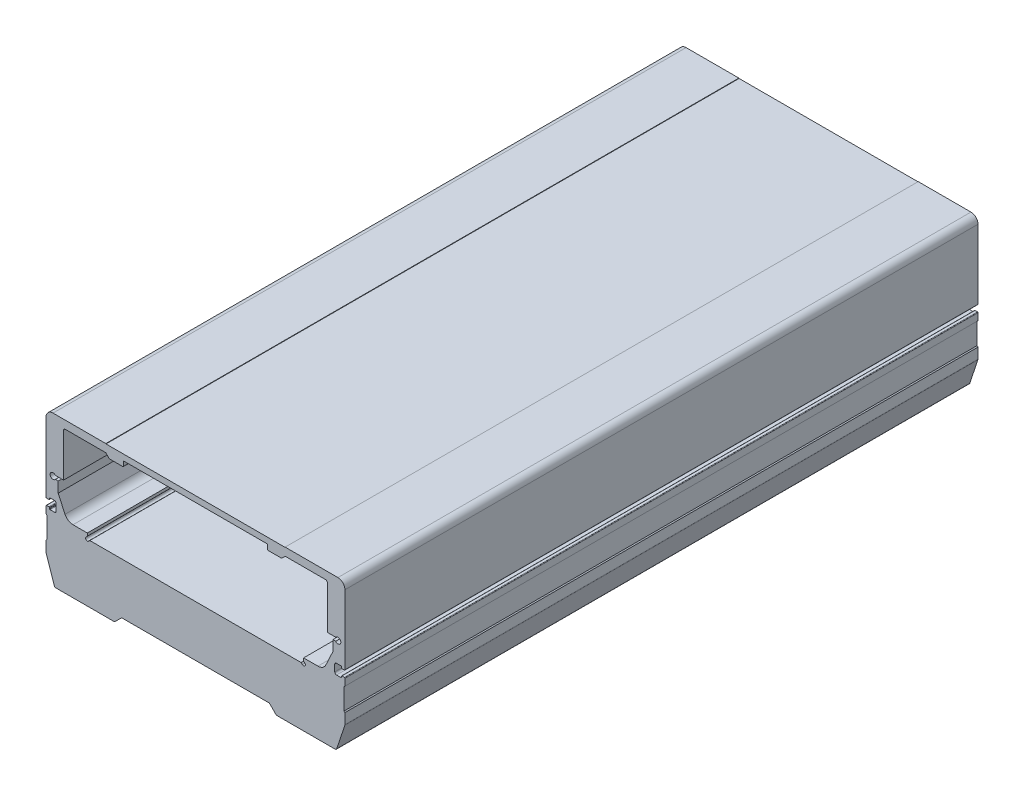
ISO-10303-21;
HEADER;
FILE_DESCRIPTION(('STEP AP214'),'2;1');
FILE_NAME('part.step','',(''),(''),'','','');
FILE_SCHEMA(('AUTOMOTIVE_DESIGN { 1 0 10303 214 1 1 1 1 }'));
ENDSEC;
DATA;
#1=APPLICATION_CONTEXT('core data for automotive mechanical design processes');
#2=APPLICATION_PROTOCOL_DEFINITION('international standard','automotive_design',2000,#1);
#3=PRODUCT_CONTEXT('',#1,'mechanical');
#4=PRODUCT('Part','Part','',(#3));
#5=PRODUCT_RELATED_PRODUCT_CATEGORY('part','',(#4));
#6=PRODUCT_DEFINITION_FORMATION('','',#4);
#7=PRODUCT_DEFINITION_CONTEXT('part definition',#1,'design');
#8=PRODUCT_DEFINITION('design','',#6,#7);
#9=PRODUCT_DEFINITION_SHAPE('','',#8);
#10=(LENGTH_UNIT() NAMED_UNIT(*) SI_UNIT(.MILLI.,.METRE.));
#11=(NAMED_UNIT(*) PLANE_ANGLE_UNIT() SI_UNIT($,.RADIAN.));
#12=(NAMED_UNIT(*) SI_UNIT($,.STERADIAN.) SOLID_ANGLE_UNIT());
#13=UNCERTAINTY_MEASURE_WITH_UNIT(LENGTH_MEASURE(1.E-05),#10,'distance_accuracy_value','');
#14=(GEOMETRIC_REPRESENTATION_CONTEXT(3) GLOBAL_UNCERTAINTY_ASSIGNED_CONTEXT((#13)) GLOBAL_UNIT_ASSIGNED_CONTEXT((#10,
#11,#12)) REPRESENTATION_CONTEXT('',''));
#15=CARTESIAN_POINT('',(0.,0.,0.));
#16=DIRECTION('',(0.,0.,1.));
#17=DIRECTION('',(1.,0.,0.));
#18=AXIS2_PLACEMENT_3D('',#15,#16,#17);
#19=CARTESIAN_POINT('',(-81.0000000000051,77.2999999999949,-360.));
#20=DIRECTION('',(0.,0.,1.));
#21=DIRECTION('',(1.,0.,0.));
#22=AXIS2_PLACEMENT_3D('',#19,#20,#21);
#23=CYLINDRICAL_SURFACE('',#22,4.);
#24=CARTESIAN_POINT('',(-81.0000000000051,77.2999999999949,0.));
#25=DIRECTION('',(0.,0.,1.));
#26=DIRECTION('',(1.,0.,0.));
#27=AXIS2_PLACEMENT_3D('',#24,#25,#26);
#28=CIRCLE('',#27,4.);
#29=CARTESIAN_POINT('',(-81.0000000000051,81.2999999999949,0.));
#30=VERTEX_POINT('',#29);
#31=CARTESIAN_POINT('',(-85.0000000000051,77.2999999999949,0.));
#32=VERTEX_POINT('',#31);
#33=EDGE_CURVE('E930',#30,#32,#28,.T.);
#34=ORIENTED_EDGE('',*,*,#33,.F.);
#35=DIRECTION('',(0.,0.,1.));
#36=VECTOR('',#35,1.);
#37=CARTESIAN_POINT('',(-81.0000000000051,81.2999999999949,-360.));
#38=LINE('',#37,#36);
#39=CARTESIAN_POINT('',(-81.0000000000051,81.2999999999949,-360.));
#40=VERTEX_POINT('',#39);
#41=EDGE_CURVE('E11',#40,#30,#38,.T.);
#42=ORIENTED_EDGE('',*,*,#41,.F.);
#43=CARTESIAN_POINT('',(-81.0000000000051,77.2999999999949,-360.));
#44=DIRECTION('',(0.,0.,1.));
#45=DIRECTION('',(1.,0.,0.));
#46=AXIS2_PLACEMENT_3D('',#43,#44,#45);
#47=CIRCLE('',#46,4.);
#48=CARTESIAN_POINT('',(-85.0000000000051,77.2999999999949,-360.));
#49=VERTEX_POINT('',#48);
#50=EDGE_CURVE('E1004',#40,#49,#47,.T.);
#51=ORIENTED_EDGE('',*,*,#50,.T.);
#52=DIRECTION('',(0.,0.,1.));
#53=VECTOR('',#52,1.);
#54=CARTESIAN_POINT('',(-85.0000000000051,77.2999999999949,-360.));
#55=LINE('',#54,#53);
#56=EDGE_CURVE('E40',#49,#32,#55,.T.);
#57=ORIENTED_EDGE('',*,*,#56,.T.);
#58=EDGE_LOOP('',(#34,#42,#51,#57));
#59=FACE_BOUND('',#58,.T.);
#60=ADVANCED_FACE('F37',(#59),#23,.T.);
#61=CARTESIAN_POINT('',(-51.0000000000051,81.2999999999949,-360.));
#62=DIRECTION('',(0.,1.,0.));
#63=DIRECTION('',(0.,0.,1.));
#64=AXIS2_PLACEMENT_3D('',#61,#62,#63);
#65=PLANE('',#64);
#66=DIRECTION('',(-1.,0.,0.));
#67=VECTOR('',#66,1.);
#68=CARTESIAN_POINT('',(-51.0000000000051,81.2999999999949,0.));
#69=LINE('',#68,#67);
#70=CARTESIAN_POINT('',(-51.0000000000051,81.2999999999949,0.));
#71=VERTEX_POINT('',#70);
#72=EDGE_CURVE('E1008',#71,#30,#69,.T.);
#73=ORIENTED_EDGE('',*,*,#72,.F.);
#74=DIRECTION('',(0.,0.,1.));
#75=VECTOR('',#74,1.);
#76=CARTESIAN_POINT('',(-51.0000000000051,81.2999999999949,-360.));
#77=LINE('',#76,#75);
#78=CARTESIAN_POINT('',(-51.0000000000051,81.2999999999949,-360.));
#79=VERTEX_POINT('',#78);
#80=EDGE_CURVE('E45',#79,#71,#77,.T.);
#81=ORIENTED_EDGE('',*,*,#80,.F.);
#82=DIRECTION('',(-1.,0.,0.));
#83=VECTOR('',#82,1.);
#84=CARTESIAN_POINT('',(-51.0000000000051,81.2999999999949,-360.));
#85=LINE('',#84,#83);
#86=EDGE_CURVE('E1182',#79,#40,#85,.T.);
#87=ORIENTED_EDGE('',*,*,#86,.T.);
#88=ORIENTED_EDGE('',*,*,#41,.T.);
#89=EDGE_LOOP('',(#73,#81,#87,#88));
#90=FACE_BOUND('',#89,.T.);
#91=ADVANCED_FACE('F1489',(#90),#65,.T.);
#92=CARTESIAN_POINT('',(-50.8689864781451,81.1689864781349,-360.));
#93=DIRECTION('',(0.707106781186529,0.707106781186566,0.));
#94=DIRECTION('',(-0.707106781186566,0.707106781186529,0.));
#95=AXIS2_PLACEMENT_3D('',#92,#93,#94);
#96=PLANE('',#95);
#97=DIRECTION('',(-0.707106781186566,0.707106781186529,0.));
#98=VECTOR('',#97,1.);
#99=CARTESIAN_POINT('',(-50.8689864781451,81.1689864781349,0.));
#100=LINE('',#99,#98);
#101=CARTESIAN_POINT('',(-50.8689864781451,81.1689864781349,0.));
#102=VERTEX_POINT('',#101);
#103=EDGE_CURVE('E1358',#102,#71,#100,.T.);
#104=ORIENTED_EDGE('',*,*,#103,.F.);
#105=DIRECTION('',(0.,0.,1.));
#106=VECTOR('',#105,1.);
#107=CARTESIAN_POINT('',(-50.8689864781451,81.1689864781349,-360.));
#108=LINE('',#107,#106);
#109=CARTESIAN_POINT('',(-50.8689864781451,81.1689864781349,-360.));
#110=VERTEX_POINT('',#109);
#111=EDGE_CURVE('E1364',#110,#102,#108,.T.);
#112=ORIENTED_EDGE('',*,*,#111,.F.);
#113=DIRECTION('',(-0.707106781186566,0.707106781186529,0.));
#114=VECTOR('',#113,1.);
#115=CARTESIAN_POINT('',(-50.8689864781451,81.1689864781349,-360.));
#116=LINE('',#115,#114);
#117=EDGE_CURVE('E1179',#110,#79,#116,.T.);
#118=ORIENTED_EDGE('',*,*,#117,.T.);
#119=ORIENTED_EDGE('',*,*,#80,.T.);
#120=EDGE_LOOP('',(#104,#112,#118,#119));
#121=FACE_BOUND('',#120,.T.);
#122=ADVANCED_FACE('F1718',(#121),#96,.T.);
#123=CARTESIAN_POINT('',(50.8689864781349,81.1689864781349,-360.));
#124=DIRECTION('',(0.,1.,0.));
#125=DIRECTION('',(0.,0.,1.));
#126=AXIS2_PLACEMENT_3D('',#123,#124,#125);
#127=PLANE('',#126);
#128=DIRECTION('',(-1.,0.,0.));
#129=VECTOR('',#128,1.);
#130=CARTESIAN_POINT('',(50.8689864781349,81.1689864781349,0.));
#131=LINE('',#130,#129);
#132=CARTESIAN_POINT('',(50.8689864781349,81.1689864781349,0.));
#133=VERTEX_POINT('',#132);
#134=EDGE_CURVE('E1355',#133,#102,#131,.T.);
#135=ORIENTED_EDGE('',*,*,#134,.F.);
#136=DIRECTION('',(0.,0.,1.));
#137=VECTOR('',#136,1.);
#138=CARTESIAN_POINT('',(50.8689864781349,81.1689864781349,-360.));
#139=LINE('',#138,#137);
#140=CARTESIAN_POINT('',(50.8689864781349,81.1689864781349,-360.));
#141=VERTEX_POINT('',#140);
#142=EDGE_CURVE('E1366',#141,#133,#139,.T.);
#143=ORIENTED_EDGE('',*,*,#142,.F.);
#144=DIRECTION('',(-1.,0.,0.));
#145=VECTOR('',#144,1.);
#146=CARTESIAN_POINT('',(50.8689864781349,81.1689864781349,-360.));
#147=LINE('',#146,#145);
#148=EDGE_CURVE('E1176',#141,#110,#147,.T.);
#149=ORIENTED_EDGE('',*,*,#148,.T.);
#150=ORIENTED_EDGE('',*,*,#111,.T.);
#151=EDGE_LOOP('',(#135,#143,#149,#150));
#152=FACE_BOUND('',#151,.T.);
#153=ADVANCED_FACE('F1715',(#152),#127,.T.);
#154=CARTESIAN_POINT('',(50.9999999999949,81.2999999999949,-360.));
#155=DIRECTION('',(-0.707106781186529,0.707106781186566,0.));
#156=DIRECTION('',(-0.707106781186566,-0.707106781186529,0.));
#157=AXIS2_PLACEMENT_3D('',#154,#155,#156);
#158=PLANE('',#157);
#159=DIRECTION('',(-0.707106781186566,-0.707106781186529,0.));
#160=VECTOR('',#159,1.);
#161=CARTESIAN_POINT('',(50.9999999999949,81.2999999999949,0.));
#162=LINE('',#161,#160);
#163=CARTESIAN_POINT('',(50.9999999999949,81.2999999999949,0.));
#164=VERTEX_POINT('',#163);
#165=EDGE_CURVE('E1352',#164,#133,#162,.T.);
#166=ORIENTED_EDGE('',*,*,#165,.F.);
#167=DIRECTION('',(0.,0.,1.));
#168=VECTOR('',#167,1.);
#169=CARTESIAN_POINT('',(50.9999999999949,81.2999999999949,-360.));
#170=LINE('',#169,#168);
#171=CARTESIAN_POINT('',(50.9999999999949,81.2999999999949,-360.));
#172=VERTEX_POINT('',#171);
#173=EDGE_CURVE('E1368',#172,#164,#170,.T.);
#174=ORIENTED_EDGE('',*,*,#173,.F.);
#175=DIRECTION('',(-0.707106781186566,-0.707106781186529,0.));
#176=VECTOR('',#175,1.);
#177=CARTESIAN_POINT('',(50.9999999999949,81.2999999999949,-360.));
#178=LINE('',#177,#176);
#179=EDGE_CURVE('E1173',#172,#141,#178,.T.);
#180=ORIENTED_EDGE('',*,*,#179,.T.);
#181=ORIENTED_EDGE('',*,*,#142,.T.);
#182=EDGE_LOOP('',(#166,#174,#180,#181));
#183=FACE_BOUND('',#182,.T.);
#184=ADVANCED_FACE('F1712',(#183),#158,.T.);
#185=CARTESIAN_POINT('',(80.9999999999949,81.2999999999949,-360.));
#186=DIRECTION('',(0.,1.,0.));
#187=DIRECTION('',(0.,0.,1.));
#188=AXIS2_PLACEMENT_3D('',#185,#186,#187);
#189=PLANE('',#188);
#190=DIRECTION('',(-1.,0.,0.));
#191=VECTOR('',#190,1.);
#192=CARTESIAN_POINT('',(80.9999999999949,81.2999999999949,0.));
#193=LINE('',#192,#191);
#194=CARTESIAN_POINT('',(80.9999999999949,81.2999999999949,0.));
#195=VERTEX_POINT('',#194);
#196=EDGE_CURVE('E1349',#195,#164,#193,.T.);
#197=ORIENTED_EDGE('',*,*,#196,.F.);
#198=DIRECTION('',(0.,0.,1.));
#199=VECTOR('',#198,1.);
#200=CARTESIAN_POINT('',(80.9999999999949,81.2999999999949,-360.));
#201=LINE('',#200,#199);
#202=CARTESIAN_POINT('',(80.9999999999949,81.2999999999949,-360.));
#203=VERTEX_POINT('',#202);
#204=EDGE_CURVE('E1370',#203,#195,#201,.T.);
#205=ORIENTED_EDGE('',*,*,#204,.F.);
#206=DIRECTION('',(-1.,0.,0.));
#207=VECTOR('',#206,1.);
#208=CARTESIAN_POINT('',(80.9999999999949,81.2999999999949,-360.));
#209=LINE('',#208,#207);
#210=EDGE_CURVE('E1170',#203,#172,#209,.T.);
#211=ORIENTED_EDGE('',*,*,#210,.T.);
#212=ORIENTED_EDGE('',*,*,#173,.T.);
#213=EDGE_LOOP('',(#197,#205,#211,#212));
#214=FACE_BOUND('',#213,.T.);
#215=ADVANCED_FACE('F1708',(#214),#189,.T.);
#216=CARTESIAN_POINT('',(80.9999999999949,77.2999999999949,-360.));
#217=DIRECTION('',(0.,0.,1.));
#218=DIRECTION('',(1.,0.,0.));
#219=AXIS2_PLACEMENT_3D('',#216,#217,#218);
#220=CYLINDRICAL_SURFACE('',#219,4.);
#221=CARTESIAN_POINT('',(80.9999999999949,77.2999999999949,0.));
#222=DIRECTION('',(0.,0.,1.));
#223=DIRECTION('',(1.,0.,0.));
#224=AXIS2_PLACEMENT_3D('',#221,#222,#223);
#225=CIRCLE('',#224,4.);
#226=CARTESIAN_POINT('',(84.9999999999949,77.2999999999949,0.));
#227=VERTEX_POINT('',#226);
#228=EDGE_CURVE('E1346',#227,#195,#225,.T.);
#229=ORIENTED_EDGE('',*,*,#228,.F.);
#230=DIRECTION('',(0.,0.,1.));
#231=VECTOR('',#230,1.);
#232=CARTESIAN_POINT('',(84.9999999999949,77.2999999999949,-360.));
#233=LINE('',#232,#231);
#234=CARTESIAN_POINT('',(84.9999999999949,77.2999999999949,-360.));
#235=VERTEX_POINT('',#234);
#236=EDGE_CURVE('E1372',#235,#227,#233,.T.);
#237=ORIENTED_EDGE('',*,*,#236,.F.);
#238=CARTESIAN_POINT('',(80.9999999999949,77.2999999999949,-360.));
#239=DIRECTION('',(0.,0.,1.));
#240=DIRECTION('',(1.,0.,0.));
#241=AXIS2_PLACEMENT_3D('',#238,#239,#240);
#242=CIRCLE('',#241,4.);
#243=EDGE_CURVE('E1167',#235,#203,#242,.T.);
#244=ORIENTED_EDGE('',*,*,#243,.T.);
#245=ORIENTED_EDGE('',*,*,#204,.T.);
#246=EDGE_LOOP('',(#229,#237,#244,#245));
#247=FACE_BOUND('',#246,.T.);
#248=ADVANCED_FACE('F1704',(#247),#220,.T.);
#249=CARTESIAN_POINT('',(84.9999999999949,37.8999999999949,-360.));
#250=DIRECTION('',(1.,0.,0.));
#251=DIRECTION('',(0.,0.,-1.));
#252=AXIS2_PLACEMENT_3D('',#249,#250,#251);
#253=PLANE('',#252);
#254=DIRECTION('',(0.,1.,0.));
#255=VECTOR('',#254,1.);
#256=CARTESIAN_POINT('',(84.9999999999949,37.8999999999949,0.));
#257=LINE('',#256,#255);
#258=CARTESIAN_POINT('',(84.9999999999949,37.8999999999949,0.));
#259=VERTEX_POINT('',#258);
#260=EDGE_CURVE('E1343',#259,#227,#257,.T.);
#261=ORIENTED_EDGE('',*,*,#260,.F.);
#262=DIRECTION('',(0.,0.,1.));
#263=VECTOR('',#262,1.);
#264=CARTESIAN_POINT('',(84.9999999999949,37.8999999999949,-360.));
#265=LINE('',#264,#263);
#266=CARTESIAN_POINT('',(84.9999999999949,37.8999999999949,-360.));
#267=VERTEX_POINT('',#266);
#268=EDGE_CURVE('E1374',#267,#259,#265,.T.);
#269=ORIENTED_EDGE('',*,*,#268,.F.);
#270=DIRECTION('',(0.,1.,0.));
#271=VECTOR('',#270,1.);
#272=CARTESIAN_POINT('',(84.9999999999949,37.8999999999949,-360.));
#273=LINE('',#272,#271);
#274=EDGE_CURVE('E1164',#267,#235,#273,.T.);
#275=ORIENTED_EDGE('',*,*,#274,.T.);
#276=ORIENTED_EDGE('',*,*,#236,.T.);
#277=EDGE_LOOP('',(#261,#269,#275,#276));
#278=FACE_BOUND('',#277,.T.);
#279=ADVANCED_FACE('F1700',(#278),#253,.T.);
#280=CARTESIAN_POINT('',(84.6999999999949,37.8999999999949,-360.));
#281=DIRECTION('',(0.,0.,1.));
#282=DIRECTION('',(1.,0.,0.));
#283=AXIS2_PLACEMENT_3D('',#280,#281,#282);
#284=CYLINDRICAL_SURFACE('',#283,0.29999999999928);
#285=CARTESIAN_POINT('',(84.6999999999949,37.8999999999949,0.));
#286=DIRECTION('',(0.,0.,1.));
#287=DIRECTION('',(1.,0.,0.));
#288=AXIS2_PLACEMENT_3D('',#285,#286,#287);
#289=CIRCLE('',#288,0.29999999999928);
#290=CARTESIAN_POINT('',(84.7000000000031,37.5999999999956,0.));
#291=VERTEX_POINT('',#290);
#292=EDGE_CURVE('E1340',#291,#259,#289,.T.);
#293=ORIENTED_EDGE('',*,*,#292,.F.);
#294=DIRECTION('',(0.,0.,1.));
#295=VECTOR('',#294,1.);
#296=CARTESIAN_POINT('',(84.7000000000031,37.5999999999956,-360.));
#297=LINE('',#296,#295);
#298=CARTESIAN_POINT('',(84.7000000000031,37.5999999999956,-360.));
#299=VERTEX_POINT('',#298);
#300=EDGE_CURVE('E1376',#299,#291,#297,.T.);
#301=ORIENTED_EDGE('',*,*,#300,.F.);
#302=CARTESIAN_POINT('',(84.6999999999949,37.8999999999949,-360.));
#303=DIRECTION('',(0.,0.,1.));
#304=DIRECTION('',(1.,0.,0.));
#305=AXIS2_PLACEMENT_3D('',#302,#303,#304);
#306=CIRCLE('',#305,0.29999999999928);
#307=EDGE_CURVE('E1161',#299,#267,#306,.T.);
#308=ORIENTED_EDGE('',*,*,#307,.T.);
#309=ORIENTED_EDGE('',*,*,#268,.T.);
#310=EDGE_LOOP('',(#293,#301,#308,#309));
#311=FACE_BOUND('',#310,.T.);
#312=ADVANCED_FACE('F1696',(#311),#284,.T.);
#313=CARTESIAN_POINT('',(83.3000000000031,37.5999999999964,-360.));
#314=DIRECTION('',(0.,-1.,0.));
#315=DIRECTION('',(0.,0.,-1.));
#316=AXIS2_PLACEMENT_3D('',#313,#314,#315);
#317=PLANE('',#316);
#318=DIRECTION('',(1.,0.,0.));
#319=VECTOR('',#318,1.);
#320=CARTESIAN_POINT('',(83.3000000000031,37.5999999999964,0.));
#321=LINE('',#320,#319);
#322=CARTESIAN_POINT('',(83.3000000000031,37.5999999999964,0.));
#323=VERTEX_POINT('',#322);
#324=EDGE_CURVE('E1337',#323,#291,#321,.T.);
#325=ORIENTED_EDGE('',*,*,#324,.F.);
#326=DIRECTION('',(0.,0.,1.));
#327=VECTOR('',#326,1.);
#328=CARTESIAN_POINT('',(83.3000000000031,37.5999999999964,-360.));
#329=LINE('',#328,#327);
#330=CARTESIAN_POINT('',(83.3000000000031,37.5999999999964,-360.));
#331=VERTEX_POINT('',#330);
#332=EDGE_CURVE('E1378',#331,#323,#329,.T.);
#333=ORIENTED_EDGE('',*,*,#332,.F.);
#334=DIRECTION('',(1.,0.,0.));
#335=VECTOR('',#334,1.);
#336=CARTESIAN_POINT('',(83.3000000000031,37.5999999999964,-360.));
#337=LINE('',#336,#335);
#338=EDGE_CURVE('E1158',#331,#299,#337,.T.);
#339=ORIENTED_EDGE('',*,*,#338,.T.);
#340=ORIENTED_EDGE('',*,*,#300,.T.);
#341=EDGE_LOOP('',(#325,#333,#339,#340));
#342=FACE_BOUND('',#341,.T.);
#343=ADVANCED_FACE('F1692',(#342),#317,.T.);
#344=CARTESIAN_POINT('',(83.3000000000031,37.8999999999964,-360.));
#345=DIRECTION('',(0.,0.,1.));
#346=DIRECTION('',(1.,0.,0.));
#347=AXIS2_PLACEMENT_3D('',#344,#345,#346);
#348=CYLINDRICAL_SURFACE('',#347,0.299999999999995);
#349=CARTESIAN_POINT('',(83.3000000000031,37.8999999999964,0.));
#350=DIRECTION('',(0.,0.,1.));
#351=DIRECTION('',(1.,0.,0.));
#352=AXIS2_PLACEMENT_3D('',#349,#350,#351);
#353=CIRCLE('',#352,0.299999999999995);
#354=CARTESIAN_POINT('',(83.0000000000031,37.8999999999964,0.));
#355=VERTEX_POINT('',#354);
#356=EDGE_CURVE('E1334',#355,#323,#353,.T.);
#357=ORIENTED_EDGE('',*,*,#356,.F.);
#358=DIRECTION('',(0.,0.,1.));
#359=VECTOR('',#358,1.);
#360=CARTESIAN_POINT('',(83.0000000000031,37.8999999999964,-360.));
#361=LINE('',#360,#359);
#362=CARTESIAN_POINT('',(83.0000000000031,37.8999999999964,-360.));
#363=VERTEX_POINT('',#362);
#364=EDGE_CURVE('E1380',#363,#355,#361,.T.);
#365=ORIENTED_EDGE('',*,*,#364,.F.);
#366=CARTESIAN_POINT('',(83.3000000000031,37.8999999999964,-360.));
#367=DIRECTION('',(0.,0.,1.));
#368=DIRECTION('',(1.,0.,0.));
#369=AXIS2_PLACEMENT_3D('',#366,#367,#368);
#370=CIRCLE('',#369,0.299999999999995);
#371=EDGE_CURVE('E1155',#363,#331,#370,.T.);
#372=ORIENTED_EDGE('',*,*,#371,.T.);
#373=ORIENTED_EDGE('',*,*,#332,.T.);
#374=EDGE_LOOP('',(#357,#365,#372,#373));
#375=FACE_BOUND('',#374,.T.);
#376=ADVANCED_FACE('F1688',(#375),#348,.T.);
#377=CARTESIAN_POINT('',(83.0000000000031,38.3999999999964,-360.));
#378=DIRECTION('',(-1.,0.,0.));
#379=DIRECTION('',(0.,0.,1.));
#380=AXIS2_PLACEMENT_3D('',#377,#378,#379);
#381=PLANE('',#380);
#382=DIRECTION('',(0.,-1.,0.));
#383=VECTOR('',#382,1.);
#384=CARTESIAN_POINT('',(83.0000000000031,38.3999999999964,0.));
#385=LINE('',#384,#383);
#386=CARTESIAN_POINT('',(83.0000000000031,38.3999999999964,0.));
#387=VERTEX_POINT('',#386);
#388=EDGE_CURVE('E1331',#387,#355,#385,.T.);
#389=ORIENTED_EDGE('',*,*,#388,.F.);
#390=DIRECTION('',(0.,0.,1.));
#391=VECTOR('',#390,1.);
#392=CARTESIAN_POINT('',(83.0000000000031,38.3999999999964,-360.));
#393=LINE('',#392,#391);
#394=CARTESIAN_POINT('',(83.0000000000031,38.3999999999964,-360.));
#395=VERTEX_POINT('',#394);
#396=EDGE_CURVE('E1382',#395,#387,#393,.T.);
#397=ORIENTED_EDGE('',*,*,#396,.F.);
#398=DIRECTION('',(0.,-1.,0.));
#399=VECTOR('',#398,1.);
#400=CARTESIAN_POINT('',(83.0000000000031,38.3999999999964,-360.));
#401=LINE('',#400,#399);
#402=EDGE_CURVE('E1152',#395,#363,#401,.T.);
#403=ORIENTED_EDGE('',*,*,#402,.T.);
#404=ORIENTED_EDGE('',*,*,#364,.T.);
#405=EDGE_LOOP('',(#389,#397,#403,#404));
#406=FACE_BOUND('',#405,.T.);
#407=ADVANCED_FACE('F1684',(#406),#381,.T.);
#408=CARTESIAN_POINT('',(82.7000000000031,38.3999999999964,-360.));
#409=DIRECTION('',(0.,0.,1.));
#410=DIRECTION('',(1.,0.,0.));
#411=AXIS2_PLACEMENT_3D('',#408,#409,#410);
#412=CYLINDRICAL_SURFACE('',#411,0.299999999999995);
#413=CARTESIAN_POINT('',(82.7000000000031,38.3999999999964,0.));
#414=DIRECTION('',(0.,0.,-1.));
#415=DIRECTION('',(1.,0.,0.));
#416=AXIS2_PLACEMENT_3D('',#413,#414,#415);
#417=CIRCLE('',#416,0.299999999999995);
#418=CARTESIAN_POINT('',(82.7000000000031,38.6999999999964,0.));
#419=VERTEX_POINT('',#418);
#420=EDGE_CURVE('E1328',#419,#387,#417,.T.);
#421=ORIENTED_EDGE('',*,*,#420,.F.);
#422=DIRECTION('',(0.,0.,1.));
#423=VECTOR('',#422,1.);
#424=CARTESIAN_POINT('',(82.7000000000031,38.6999999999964,-360.));
#425=LINE('',#424,#423);
#426=CARTESIAN_POINT('',(82.7000000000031,38.6999999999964,-360.));
#427=VERTEX_POINT('',#426);
#428=EDGE_CURVE('E1384',#427,#419,#425,.T.);
#429=ORIENTED_EDGE('',*,*,#428,.F.);
#430=CARTESIAN_POINT('',(82.7000000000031,38.3999999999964,-360.));
#431=DIRECTION('',(0.,0.,-1.));
#432=DIRECTION('',(1.,0.,0.));
#433=AXIS2_PLACEMENT_3D('',#430,#431,#432);
#434=CIRCLE('',#433,0.299999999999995);
#435=EDGE_CURVE('E1149',#427,#395,#434,.T.);
#436=ORIENTED_EDGE('',*,*,#435,.T.);
#437=ORIENTED_EDGE('',*,*,#396,.T.);
#438=EDGE_LOOP('',(#421,#429,#436,#437));
#439=FACE_BOUND('',#438,.T.);
#440=ADVANCED_FACE('F1680',(#439),#412,.F.);
#441=CARTESIAN_POINT('',(80.2000000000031,38.6999999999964,-360.));
#442=DIRECTION('',(0.,-1.,0.));
#443=DIRECTION('',(0.,0.,-1.));
#444=AXIS2_PLACEMENT_3D('',#441,#442,#443);
#445=PLANE('',#444);
#446=DIRECTION('',(1.,0.,0.));
#447=VECTOR('',#446,1.);
#448=CARTESIAN_POINT('',(80.2000000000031,38.6999999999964,0.));
#449=LINE('',#448,#447);
#450=CARTESIAN_POINT('',(80.2000000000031,38.6999999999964,0.));
#451=VERTEX_POINT('',#450);
#452=EDGE_CURVE('E1325',#451,#419,#449,.T.);
#453=ORIENTED_EDGE('',*,*,#452,.F.);
#454=DIRECTION('',(0.,0.,1.));
#455=VECTOR('',#454,1.);
#456=CARTESIAN_POINT('',(80.2000000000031,38.6999999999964,-360.));
#457=LINE('',#456,#455);
#458=CARTESIAN_POINT('',(80.2000000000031,38.6999999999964,-360.));
#459=VERTEX_POINT('',#458);
#460=EDGE_CURVE('E1386',#459,#451,#457,.T.);
#461=ORIENTED_EDGE('',*,*,#460,.F.);
#462=DIRECTION('',(1.,0.,0.));
#463=VECTOR('',#462,1.);
#464=CARTESIAN_POINT('',(80.2000000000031,38.6999999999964,-360.));
#465=LINE('',#464,#463);
#466=EDGE_CURVE('E1146',#459,#427,#465,.T.);
#467=ORIENTED_EDGE('',*,*,#466,.T.);
#468=ORIENTED_EDGE('',*,*,#428,.T.);
#469=EDGE_LOOP('',(#453,#461,#467,#468));
#470=FACE_BOUND('',#469,.T.);
#471=ADVANCED_FACE('F1676',(#470),#445,.T.);
#472=CARTESIAN_POINT('',(80.2000000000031,37.6999999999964,-360.));
#473=DIRECTION('',(0.,0.,1.));
#474=DIRECTION('',(1.,0.,0.));
#475=AXIS2_PLACEMENT_3D('',#472,#473,#474);
#476=CYLINDRICAL_SURFACE('',#475,1.);
#477=CARTESIAN_POINT('',(80.2000000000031,37.6999999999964,0.));
#478=DIRECTION('',(0.,0.,-1.));
#479=DIRECTION('',(1.,0.,0.));
#480=AXIS2_PLACEMENT_3D('',#477,#478,#479);
#481=CIRCLE('',#480,1.);
#482=CARTESIAN_POINT('',(79.2000000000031,37.6999999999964,0.));
#483=VERTEX_POINT('',#482);
#484=EDGE_CURVE('E1322',#483,#451,#481,.T.);
#485=ORIENTED_EDGE('',*,*,#484,.F.);
#486=DIRECTION('',(0.,0.,1.));
#487=VECTOR('',#486,1.);
#488=CARTESIAN_POINT('',(79.2000000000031,37.6999999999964,-360.));
#489=LINE('',#488,#487);
#490=CARTESIAN_POINT('',(79.2000000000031,37.6999999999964,-360.));
#491=VERTEX_POINT('',#490);
#492=EDGE_CURVE('E1388',#491,#483,#489,.T.);
#493=ORIENTED_EDGE('',*,*,#492,.F.);
#494=CARTESIAN_POINT('',(80.2000000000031,37.6999999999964,-360.));
#495=DIRECTION('',(0.,0.,-1.));
#496=DIRECTION('',(1.,0.,0.));
#497=AXIS2_PLACEMENT_3D('',#494,#495,#496);
#498=CIRCLE('',#497,1.);
#499=EDGE_CURVE('E1143',#491,#459,#498,.T.);
#500=ORIENTED_EDGE('',*,*,#499,.T.);
#501=ORIENTED_EDGE('',*,*,#460,.T.);
#502=EDGE_LOOP('',(#485,#493,#500,#501));
#503=FACE_BOUND('',#502,.T.);
#504=ADVANCED_FACE('F1672',(#503),#476,.F.);
#505=CARTESIAN_POINT('',(79.2000000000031,33.8999999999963,-360.));
#506=DIRECTION('',(1.,0.,0.));
#507=DIRECTION('',(0.,0.,-1.));
#508=AXIS2_PLACEMENT_3D('',#505,#506,#507);
#509=PLANE('',#508);
#510=DIRECTION('',(0.,1.,0.));
#511=VECTOR('',#510,1.);
#512=CARTESIAN_POINT('',(79.2000000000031,33.8999999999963,0.));
#513=LINE('',#512,#511);
#514=CARTESIAN_POINT('',(79.2000000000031,33.8999999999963,0.));
#515=VERTEX_POINT('',#514);
#516=EDGE_CURVE('E1319',#515,#483,#513,.T.);
#517=ORIENTED_EDGE('',*,*,#516,.F.);
#518=DIRECTION('',(0.,0.,1.));
#519=VECTOR('',#518,1.);
#520=CARTESIAN_POINT('',(79.2000000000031,33.8999999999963,-360.));
#521=LINE('',#520,#519);
#522=CARTESIAN_POINT('',(79.2000000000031,33.8999999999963,-360.));
#523=VERTEX_POINT('',#522);
#524=EDGE_CURVE('E1390',#523,#515,#521,.T.);
#525=ORIENTED_EDGE('',*,*,#524,.F.);
#526=DIRECTION('',(0.,1.,0.));
#527=VECTOR('',#526,1.);
#528=CARTESIAN_POINT('',(79.2000000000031,33.8999999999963,-360.));
#529=LINE('',#528,#527);
#530=EDGE_CURVE('E1140',#523,#491,#529,.T.);
#531=ORIENTED_EDGE('',*,*,#530,.T.);
#532=ORIENTED_EDGE('',*,*,#492,.T.);
#533=EDGE_LOOP('',(#517,#525,#531,#532));
#534=FACE_BOUND('',#533,.T.);
#535=ADVANCED_FACE('F1668',(#534),#509,.T.);
#536=CARTESIAN_POINT('',(80.2000000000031,33.8999999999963,-360.));
#537=DIRECTION('',(0.,0.,1.));
#538=DIRECTION('',(1.,0.,0.));
#539=AXIS2_PLACEMENT_3D('',#536,#537,#538);
#540=CYLINDRICAL_SURFACE('',#539,1.);
#541=CARTESIAN_POINT('',(80.2000000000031,33.8999999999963,0.));
#542=DIRECTION('',(0.,0.,-1.));
#543=DIRECTION('',(1.,0.,0.));
#544=AXIS2_PLACEMENT_3D('',#541,#542,#543);
#545=CIRCLE('',#544,1.);
#546=CARTESIAN_POINT('',(80.2000000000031,32.8999999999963,0.));
#547=VERTEX_POINT('',#546);
#548=EDGE_CURVE('E1316',#547,#515,#545,.T.);
#549=ORIENTED_EDGE('',*,*,#548,.F.);
#550=DIRECTION('',(0.,0.,1.));
#551=VECTOR('',#550,1.);
#552=CARTESIAN_POINT('',(80.2000000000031,32.8999999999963,-360.));
#553=LINE('',#552,#551);
#554=CARTESIAN_POINT('',(80.2000000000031,32.8999999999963,-360.));
#555=VERTEX_POINT('',#554);
#556=EDGE_CURVE('E1392',#555,#547,#553,.T.);
#557=ORIENTED_EDGE('',*,*,#556,.F.);
#558=CARTESIAN_POINT('',(80.2000000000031,33.8999999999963,-360.));
#559=DIRECTION('',(0.,0.,-1.));
#560=DIRECTION('',(1.,0.,0.));
#561=AXIS2_PLACEMENT_3D('',#558,#559,#560);
#562=CIRCLE('',#561,1.);
#563=EDGE_CURVE('E1137',#555,#523,#562,.T.);
#564=ORIENTED_EDGE('',*,*,#563,.T.);
#565=ORIENTED_EDGE('',*,*,#524,.T.);
#566=EDGE_LOOP('',(#549,#557,#564,#565));
#567=FACE_BOUND('',#566,.T.);
#568=ADVANCED_FACE('F1664',(#567),#540,.F.);
#569=CARTESIAN_POINT('',(82.7000000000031,32.8999999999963,-360.));
#570=DIRECTION('',(0.,1.,0.));
#571=DIRECTION('',(0.,0.,1.));
#572=AXIS2_PLACEMENT_3D('',#569,#570,#571);
#573=PLANE('',#572);
#574=DIRECTION('',(-1.,0.,0.));
#575=VECTOR('',#574,1.);
#576=CARTESIAN_POINT('',(82.7000000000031,32.8999999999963,0.));
#577=LINE('',#576,#575);
#578=CARTESIAN_POINT('',(82.7000000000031,32.8999999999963,0.));
#579=VERTEX_POINT('',#578);
#580=EDGE_CURVE('E1313',#579,#547,#577,.T.);
#581=ORIENTED_EDGE('',*,*,#580,.F.);
#582=DIRECTION('',(0.,0.,1.));
#583=VECTOR('',#582,1.);
#584=CARTESIAN_POINT('',(82.7000000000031,32.8999999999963,-360.));
#585=LINE('',#584,#583);
#586=CARTESIAN_POINT('',(82.7000000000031,32.8999999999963,-360.));
#587=VERTEX_POINT('',#586);
#588=EDGE_CURVE('E1394',#587,#579,#585,.T.);
#589=ORIENTED_EDGE('',*,*,#588,.F.);
#590=DIRECTION('',(-1.,0.,0.));
#591=VECTOR('',#590,1.);
#592=CARTESIAN_POINT('',(82.7000000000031,32.8999999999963,-360.));
#593=LINE('',#592,#591);
#594=EDGE_CURVE('E1134',#587,#555,#593,.T.);
#595=ORIENTED_EDGE('',*,*,#594,.T.);
#596=ORIENTED_EDGE('',*,*,#556,.T.);
#597=EDGE_LOOP('',(#581,#589,#595,#596));
#598=FACE_BOUND('',#597,.T.);
#599=ADVANCED_FACE('F1660',(#598),#573,.T.);
#600=CARTESIAN_POINT('',(82.7000000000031,33.1999999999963,-360.));
#601=DIRECTION('',(0.,0.,1.));
#602=DIRECTION('',(1.,0.,0.));
#603=AXIS2_PLACEMENT_3D('',#600,#601,#602);
#604=CYLINDRICAL_SURFACE('',#603,0.299999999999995);
#605=CARTESIAN_POINT('',(82.7000000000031,33.1999999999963,0.));
#606=DIRECTION('',(0.,0.,-1.));
#607=DIRECTION('',(1.,0.,0.));
#608=AXIS2_PLACEMENT_3D('',#605,#606,#607);
#609=CIRCLE('',#608,0.299999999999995);
#610=CARTESIAN_POINT('',(83.0000000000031,33.1999999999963,0.));
#611=VERTEX_POINT('',#610);
#612=EDGE_CURVE('E1310',#611,#579,#609,.T.);
#613=ORIENTED_EDGE('',*,*,#612,.F.);
#614=DIRECTION('',(0.,0.,1.));
#615=VECTOR('',#614,1.);
#616=CARTESIAN_POINT('',(83.0000000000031,33.1999999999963,-360.));
#617=LINE('',#616,#615);
#618=CARTESIAN_POINT('',(83.0000000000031,33.1999999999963,-360.));
#619=VERTEX_POINT('',#618);
#620=EDGE_CURVE('E1396',#619,#611,#617,.T.);
#621=ORIENTED_EDGE('',*,*,#620,.F.);
#622=CARTESIAN_POINT('',(82.7000000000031,33.1999999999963,-360.));
#623=DIRECTION('',(0.,0.,-1.));
#624=DIRECTION('',(1.,0.,0.));
#625=AXIS2_PLACEMENT_3D('',#622,#623,#624);
#626=CIRCLE('',#625,0.299999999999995);
#627=EDGE_CURVE('E1131',#619,#587,#626,.T.);
#628=ORIENTED_EDGE('',*,*,#627,.T.);
#629=ORIENTED_EDGE('',*,*,#588,.T.);
#630=EDGE_LOOP('',(#613,#621,#628,#629));
#631=FACE_BOUND('',#630,.T.);
#632=ADVANCED_FACE('F1656',(#631),#604,.F.);
#633=CARTESIAN_POINT('',(83.0000000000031,33.6999999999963,-360.));
#634=DIRECTION('',(-1.,0.,0.));
#635=DIRECTION('',(0.,0.,1.));
#636=AXIS2_PLACEMENT_3D('',#633,#634,#635);
#637=PLANE('',#636);
#638=DIRECTION('',(0.,-1.,0.));
#639=VECTOR('',#638,1.);
#640=CARTESIAN_POINT('',(83.0000000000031,33.6999999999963,0.));
#641=LINE('',#640,#639);
#642=CARTESIAN_POINT('',(83.0000000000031,33.6999999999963,0.));
#643=VERTEX_POINT('',#642);
#644=EDGE_CURVE('E1307',#643,#611,#641,.T.);
#645=ORIENTED_EDGE('',*,*,#644,.F.);
#646=DIRECTION('',(0.,0.,1.));
#647=VECTOR('',#646,1.);
#648=CARTESIAN_POINT('',(83.0000000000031,33.6999999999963,-360.));
#649=LINE('',#648,#647);
#650=CARTESIAN_POINT('',(83.0000000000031,33.6999999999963,-360.));
#651=VERTEX_POINT('',#650);
#652=EDGE_CURVE('E1398',#651,#643,#649,.T.);
#653=ORIENTED_EDGE('',*,*,#652,.F.);
#654=DIRECTION('',(0.,-1.,0.));
#655=VECTOR('',#654,1.);
#656=CARTESIAN_POINT('',(83.0000000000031,33.6999999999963,-360.));
#657=LINE('',#656,#655);
#658=EDGE_CURVE('E1128',#651,#619,#657,.T.);
#659=ORIENTED_EDGE('',*,*,#658,.T.);
#660=ORIENTED_EDGE('',*,*,#620,.T.);
#661=EDGE_LOOP('',(#645,#653,#659,#660));
#662=FACE_BOUND('',#661,.T.);
#663=ADVANCED_FACE('F1652',(#662),#637,.T.);
#664=CARTESIAN_POINT('',(83.3000000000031,33.6999999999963,-360.));
#665=DIRECTION('',(0.,0.,1.));
#666=DIRECTION('',(1.,0.,0.));
#667=AXIS2_PLACEMENT_3D('',#664,#665,#666);
#668=CYLINDRICAL_SURFACE('',#667,0.299999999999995);
#669=CARTESIAN_POINT('',(83.3000000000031,33.6999999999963,0.));
#670=DIRECTION('',(0.,0.,1.));
#671=DIRECTION('',(1.,0.,0.));
#672=AXIS2_PLACEMENT_3D('',#669,#670,#671);
#673=CIRCLE('',#672,0.299999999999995);
#674=CARTESIAN_POINT('',(83.3000000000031,33.9999999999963,0.));
#675=VERTEX_POINT('',#674);
#676=EDGE_CURVE('E1304',#675,#643,#673,.T.);
#677=ORIENTED_EDGE('',*,*,#676,.F.);
#678=DIRECTION('',(0.,0.,1.));
#679=VECTOR('',#678,1.);
#680=CARTESIAN_POINT('',(83.3000000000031,33.9999999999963,-360.));
#681=LINE('',#680,#679);
#682=CARTESIAN_POINT('',(83.3000000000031,33.9999999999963,-360.));
#683=VERTEX_POINT('',#682);
#684=EDGE_CURVE('E1400',#683,#675,#681,.T.);
#685=ORIENTED_EDGE('',*,*,#684,.F.);
#686=CARTESIAN_POINT('',(83.3000000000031,33.6999999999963,-360.));
#687=DIRECTION('',(0.,0.,1.));
#688=DIRECTION('',(1.,0.,0.));
#689=AXIS2_PLACEMENT_3D('',#686,#687,#688);
#690=CIRCLE('',#689,0.299999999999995);
#691=EDGE_CURVE('E1125',#683,#651,#690,.T.);
#692=ORIENTED_EDGE('',*,*,#691,.T.);
#693=ORIENTED_EDGE('',*,*,#652,.T.);
#694=EDGE_LOOP('',(#677,#685,#692,#693));
#695=FACE_BOUND('',#694,.T.);
#696=ADVANCED_FACE('F1648',(#695),#668,.T.);
#697=CARTESIAN_POINT('',(84.7000000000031,33.9999999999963,-360.));
#698=DIRECTION('',(0.,1.,0.));
#699=DIRECTION('',(0.,0.,1.));
#700=AXIS2_PLACEMENT_3D('',#697,#698,#699);
#701=PLANE('',#700);
#702=DIRECTION('',(-1.,0.,0.));
#703=VECTOR('',#702,1.);
#704=CARTESIAN_POINT('',(84.7000000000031,33.9999999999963,0.));
#705=LINE('',#704,#703);
#706=CARTESIAN_POINT('',(84.7000000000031,33.9999999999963,0.));
#707=VERTEX_POINT('',#706);
#708=EDGE_CURVE('E1301',#707,#675,#705,.T.);
#709=ORIENTED_EDGE('',*,*,#708,.F.);
#710=DIRECTION('',(0.,0.,1.));
#711=VECTOR('',#710,1.);
#712=CARTESIAN_POINT('',(84.7000000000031,33.9999999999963,-360.));
#713=LINE('',#712,#711);
#714=CARTESIAN_POINT('',(84.7000000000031,33.9999999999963,-360.));
#715=VERTEX_POINT('',#714);
#716=EDGE_CURVE('E1402',#715,#707,#713,.T.);
#717=ORIENTED_EDGE('',*,*,#716,.F.);
#718=DIRECTION('',(-1.,0.,0.));
#719=VECTOR('',#718,1.);
#720=CARTESIAN_POINT('',(84.7000000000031,33.9999999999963,-360.));
#721=LINE('',#720,#719);
#722=EDGE_CURVE('E1122',#715,#683,#721,.T.);
#723=ORIENTED_EDGE('',*,*,#722,.T.);
#724=ORIENTED_EDGE('',*,*,#684,.T.);
#725=EDGE_LOOP('',(#709,#717,#723,#724));
#726=FACE_BOUND('',#725,.T.);
#727=ADVANCED_FACE('F1644',(#726),#701,.T.);
#728=CARTESIAN_POINT('',(84.7000000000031,33.6999999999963,-360.));
#729=DIRECTION('',(0.,0.,1.));
#730=DIRECTION('',(1.,0.,0.));
#731=AXIS2_PLACEMENT_3D('',#728,#729,#730);
#732=CYLINDRICAL_SURFACE('',#731,0.299999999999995);
#733=CARTESIAN_POINT('',(84.7000000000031,33.6999999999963,0.));
#734=DIRECTION('',(0.,0.,1.));
#735=DIRECTION('',(1.,0.,0.));
#736=AXIS2_PLACEMENT_3D('',#733,#734,#735);
#737=CIRCLE('',#736,0.299999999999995);
#738=CARTESIAN_POINT('',(85.0000000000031,33.6999999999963,0.));
#739=VERTEX_POINT('',#738);
#740=EDGE_CURVE('E1298',#739,#707,#737,.T.);
#741=ORIENTED_EDGE('',*,*,#740,.F.);
#742=DIRECTION('',(0.,0.,1.));
#743=VECTOR('',#742,1.);
#744=CARTESIAN_POINT('',(85.0000000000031,33.6999999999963,-360.));
#745=LINE('',#744,#743);
#746=CARTESIAN_POINT('',(85.0000000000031,33.6999999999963,-360.));
#747=VERTEX_POINT('',#746);
#748=EDGE_CURVE('E1404',#747,#739,#745,.T.);
#749=ORIENTED_EDGE('',*,*,#748,.F.);
#750=CARTESIAN_POINT('',(84.7000000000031,33.6999999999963,-360.));
#751=DIRECTION('',(0.,0.,1.));
#752=DIRECTION('',(1.,0.,0.));
#753=AXIS2_PLACEMENT_3D('',#750,#751,#752);
#754=CIRCLE('',#753,0.299999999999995);
#755=EDGE_CURVE('E1119',#747,#715,#754,.T.);
#756=ORIENTED_EDGE('',*,*,#755,.T.);
#757=ORIENTED_EDGE('',*,*,#716,.T.);
#758=EDGE_LOOP('',(#741,#749,#756,#757));
#759=FACE_BOUND('',#758,.T.);
#760=ADVANCED_FACE('F1640',(#759),#732,.T.);
#761=CARTESIAN_POINT('',(85.0000000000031,29.7999999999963,-360.));
#762=DIRECTION('',(1.,0.,0.));
#763=DIRECTION('',(0.,0.,-1.));
#764=AXIS2_PLACEMENT_3D('',#761,#762,#763);
#765=PLANE('',#764);
#766=DIRECTION('',(0.,1.,0.));
#767=VECTOR('',#766,1.);
#768=CARTESIAN_POINT('',(85.0000000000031,29.7999999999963,0.));
#769=LINE('',#768,#767);
#770=CARTESIAN_POINT('',(85.0000000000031,29.7999999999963,0.));
#771=VERTEX_POINT('',#770);
#772=EDGE_CURVE('E1295',#771,#739,#769,.T.);
#773=ORIENTED_EDGE('',*,*,#772,.F.);
#774=DIRECTION('',(0.,0.,1.));
#775=VECTOR('',#774,1.);
#776=CARTESIAN_POINT('',(85.0000000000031,29.7999999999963,-360.));
#777=LINE('',#776,#775);
#778=CARTESIAN_POINT('',(85.0000000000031,29.7999999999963,-360.));
#779=VERTEX_POINT('',#778);
#780=EDGE_CURVE('E1406',#779,#771,#777,.T.);
#781=ORIENTED_EDGE('',*,*,#780,.F.);
#782=DIRECTION('',(0.,1.,0.));
#783=VECTOR('',#782,1.);
#784=CARTESIAN_POINT('',(85.0000000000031,29.7999999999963,-360.));
#785=LINE('',#784,#783);
#786=EDGE_CURVE('E1116',#779,#747,#785,.T.);
#787=ORIENTED_EDGE('',*,*,#786,.T.);
#788=ORIENTED_EDGE('',*,*,#748,.T.);
#789=EDGE_LOOP('',(#773,#781,#787,#788));
#790=FACE_BOUND('',#789,.T.);
#791=ADVANCED_FACE('F1636',(#790),#765,.T.);
#792=CARTESIAN_POINT('',(84.5000000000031,29.2999999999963,-360.));
#793=DIRECTION('',(0.707106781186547,-0.707106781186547,0.));
#794=DIRECTION('',(0.707106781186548,0.707106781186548,0.));
#795=AXIS2_PLACEMENT_3D('',#792,#793,#794);
#796=PLANE('',#795);
#797=DIRECTION('',(0.707106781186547,0.707106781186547,0.));
#798=VECTOR('',#797,1.);
#799=CARTESIAN_POINT('',(84.5000000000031,29.2999999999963,0.));
#800=LINE('',#799,#798);
#801=CARTESIAN_POINT('',(84.5000000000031,29.2999999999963,0.));
#802=VERTEX_POINT('',#801);
#803=EDGE_CURVE('E1292',#802,#771,#800,.T.);
#804=ORIENTED_EDGE('',*,*,#803,.F.);
#805=DIRECTION('',(0.,0.,1.));
#806=VECTOR('',#805,1.);
#807=CARTESIAN_POINT('',(84.5000000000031,29.2999999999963,-360.));
#808=LINE('',#807,#806);
#809=CARTESIAN_POINT('',(84.5000000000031,29.2999999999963,-360.));
#810=VERTEX_POINT('',#809);
#811=EDGE_CURVE('E1408',#810,#802,#808,.T.);
#812=ORIENTED_EDGE('',*,*,#811,.F.);
#813=DIRECTION('',(0.707106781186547,0.707106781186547,0.));
#814=VECTOR('',#813,1.);
#815=CARTESIAN_POINT('',(84.5000000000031,29.2999999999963,-360.));
#816=LINE('',#815,#814);
#817=EDGE_CURVE('E1113',#810,#779,#816,.T.);
#818=ORIENTED_EDGE('',*,*,#817,.T.);
#819=ORIENTED_EDGE('',*,*,#780,.T.);
#820=EDGE_LOOP('',(#804,#812,#818,#819));
#821=FACE_BOUND('',#820,.T.);
#822=ADVANCED_FACE('F1632',(#821),#796,.T.);
#823=CARTESIAN_POINT('',(84.5000000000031,17.2999999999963,-360.));
#824=DIRECTION('',(1.,0.,0.));
#825=DIRECTION('',(0.,0.,-1.));
#826=AXIS2_PLACEMENT_3D('',#823,#824,#825);
#827=PLANE('',#826);
#828=DIRECTION('',(0.,1.,0.));
#829=VECTOR('',#828,1.);
#830=CARTESIAN_POINT('',(84.5000000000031,17.2999999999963,0.));
#831=LINE('',#830,#829);
#832=CARTESIAN_POINT('',(84.5000000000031,17.2999999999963,0.));
#833=VERTEX_POINT('',#832);
#834=EDGE_CURVE('E1289',#833,#802,#831,.T.);
#835=ORIENTED_EDGE('',*,*,#834,.F.);
#836=DIRECTION('',(0.,0.,1.));
#837=VECTOR('',#836,1.);
#838=CARTESIAN_POINT('',(84.5000000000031,17.2999999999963,-360.));
#839=LINE('',#838,#837);
#840=CARTESIAN_POINT('',(84.5000000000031,17.2999999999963,-360.));
#841=VERTEX_POINT('',#840);
#842=EDGE_CURVE('E1410',#841,#833,#839,.T.);
#843=ORIENTED_EDGE('',*,*,#842,.F.);
#844=DIRECTION('',(0.,1.,0.));
#845=VECTOR('',#844,1.);
#846=CARTESIAN_POINT('',(84.5000000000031,17.2999999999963,-360.));
#847=LINE('',#846,#845);
#848=EDGE_CURVE('E1110',#841,#810,#847,.T.);
#849=ORIENTED_EDGE('',*,*,#848,.T.);
#850=ORIENTED_EDGE('',*,*,#811,.T.);
#851=EDGE_LOOP('',(#835,#843,#849,#850));
#852=FACE_BOUND('',#851,.T.);
#853=ADVANCED_FACE('F1628',(#852),#827,.T.);
#854=CARTESIAN_POINT('',(85.0000000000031,16.7999999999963,-360.));
#855=DIRECTION('',(0.707106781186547,0.707106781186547,0.));
#856=DIRECTION('',(-0.707106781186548,0.707106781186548,0.));
#857=AXIS2_PLACEMENT_3D('',#854,#855,#856);
#858=PLANE('',#857);
#859=DIRECTION('',(-0.707106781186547,0.707106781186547,0.));
#860=VECTOR('',#859,1.);
#861=CARTESIAN_POINT('',(85.0000000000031,16.7999999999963,0.));
#862=LINE('',#861,#860);
#863=CARTESIAN_POINT('',(85.0000000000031,16.7999999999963,0.));
#864=VERTEX_POINT('',#863);
#865=EDGE_CURVE('E1286',#864,#833,#862,.T.);
#866=ORIENTED_EDGE('',*,*,#865,.F.);
#867=DIRECTION('',(0.,0.,1.));
#868=VECTOR('',#867,1.);
#869=CARTESIAN_POINT('',(85.0000000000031,16.7999999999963,-360.));
#870=LINE('',#869,#868);
#871=CARTESIAN_POINT('',(85.0000000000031,16.7999999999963,-360.));
#872=VERTEX_POINT('',#871);
#873=EDGE_CURVE('E1412',#872,#864,#870,.T.);
#874=ORIENTED_EDGE('',*,*,#873,.F.);
#875=DIRECTION('',(-0.707106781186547,0.707106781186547,0.));
#876=VECTOR('',#875,1.);
#877=CARTESIAN_POINT('',(85.0000000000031,16.7999999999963,-360.));
#878=LINE('',#877,#876);
#879=EDGE_CURVE('E1107',#872,#841,#878,.T.);
#880=ORIENTED_EDGE('',*,*,#879,.T.);
#881=ORIENTED_EDGE('',*,*,#842,.T.);
#882=EDGE_LOOP('',(#866,#874,#880,#881));
#883=FACE_BOUND('',#882,.T.);
#884=ADVANCED_FACE('F1624',(#883),#858,.T.);
#885=CARTESIAN_POINT('',(85.0000000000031,10.8622776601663,-360.));
#886=DIRECTION('',(1.,0.,0.));
#887=DIRECTION('',(0.,0.,-1.));
#888=AXIS2_PLACEMENT_3D('',#885,#886,#887);
#889=PLANE('',#888);
#890=DIRECTION('',(0.,1.,0.));
#891=VECTOR('',#890,1.);
#892=CARTESIAN_POINT('',(85.0000000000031,10.8622776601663,0.));
#893=LINE('',#892,#891);
#894=CARTESIAN_POINT('',(85.0000000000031,10.8622776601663,0.));
#895=VERTEX_POINT('',#894);
#896=EDGE_CURVE('E1283',#895,#864,#893,.T.);
#897=ORIENTED_EDGE('',*,*,#896,.F.);
#898=DIRECTION('',(0.,0.,1.));
#899=VECTOR('',#898,1.);
#900=CARTESIAN_POINT('',(85.0000000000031,10.8622776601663,-360.));
#901=LINE('',#900,#899);
#902=CARTESIAN_POINT('',(85.0000000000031,10.8622776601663,-360.));
#903=VERTEX_POINT('',#902);
#904=EDGE_CURVE('E1414',#903,#895,#901,.T.);
#905=ORIENTED_EDGE('',*,*,#904,.F.);
#906=DIRECTION('',(0.,1.,0.));
#907=VECTOR('',#906,1.);
#908=CARTESIAN_POINT('',(85.0000000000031,10.8622776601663,-360.));
#909=LINE('',#908,#907);
#910=EDGE_CURVE('E1104',#903,#872,#909,.T.);
#911=ORIENTED_EDGE('',*,*,#910,.T.);
#912=ORIENTED_EDGE('',*,*,#873,.T.);
#913=EDGE_LOOP('',(#897,#905,#911,#912));
#914=FACE_BOUND('',#913,.T.);
#915=ADVANCED_FACE('F1620',(#914),#889,.T.);
#916=CARTESIAN_POINT('',(84.0000000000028,10.8622776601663,-360.));
#917=DIRECTION('',(0.,0.,1.));
#918=DIRECTION('',(1.,0.,0.));
#919=AXIS2_PLACEMENT_3D('',#916,#917,#918);
#920=CYLINDRICAL_SURFACE('',#919,1.00000000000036);
#921=CARTESIAN_POINT('',(84.0000000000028,10.8622776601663,0.));
#922=DIRECTION('',(0.,0.,1.));
#923=DIRECTION('',(1.,0.,0.));
#924=AXIS2_PLACEMENT_3D('',#921,#922,#923);
#925=CIRCLE('',#924,1.00000000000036);
#926=CARTESIAN_POINT('',(84.9486832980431,10.5460498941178,0.));
#927=VERTEX_POINT('',#926);
#928=EDGE_CURVE('E1280',#927,#895,#925,.T.);
#929=ORIENTED_EDGE('',*,*,#928,.F.);
#930=DIRECTION('',(0.,0.,1.));
#931=VECTOR('',#930,1.);
#932=CARTESIAN_POINT('',(84.9486832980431,10.5460498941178,-360.));
#933=LINE('',#932,#931);
#934=CARTESIAN_POINT('',(84.9486832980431,10.5460498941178,-360.));
#935=VERTEX_POINT('',#934);
#936=EDGE_CURVE('E1416',#935,#927,#933,.T.);
#937=ORIENTED_EDGE('',*,*,#936,.F.);
#938=CARTESIAN_POINT('',(84.0000000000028,10.8622776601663,-360.));
#939=DIRECTION('',(0.,0.,1.));
#940=DIRECTION('',(1.,0.,0.));
#941=AXIS2_PLACEMENT_3D('',#938,#939,#940);
#942=CIRCLE('',#941,1.00000000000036);
#943=EDGE_CURVE('E1101',#935,#903,#942,.T.);
#944=ORIENTED_EDGE('',*,*,#943,.T.);
#945=ORIENTED_EDGE('',*,*,#904,.T.);
#946=EDGE_LOOP('',(#929,#937,#944,#945));
#947=FACE_BOUND('',#946,.T.);
#948=ADVANCED_FACE('F1616',(#947),#920,.T.);
#949=CARTESIAN_POINT('',(80.3279240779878,-3.31622776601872,-360.));
#950=DIRECTION('',(0.948683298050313,-0.316227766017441,0.));
#951=DIRECTION('',(0.316227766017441,0.948683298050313,0.));
#952=AXIS2_PLACEMENT_3D('',#949,#950,#951);
#953=PLANE('',#952);
#954=DIRECTION('',(0.316227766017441,0.948683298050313,0.));
#955=VECTOR('',#954,1.);
#956=CARTESIAN_POINT('',(80.3279240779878,-3.31622776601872,0.));
#957=LINE('',#956,#955);
#958=CARTESIAN_POINT('',(80.3279240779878,-3.31622776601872,0.));
#959=VERTEX_POINT('',#958);
#960=EDGE_CURVE('E1277',#959,#927,#957,.T.);
#961=ORIENTED_EDGE('',*,*,#960,.F.);
#962=DIRECTION('',(0.,0.,1.));
#963=VECTOR('',#962,1.);
#964=CARTESIAN_POINT('',(80.3279240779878,-3.31622776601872,-360.));
#965=LINE('',#964,#963);
#966=CARTESIAN_POINT('',(80.3279240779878,-3.31622776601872,-360.));
#967=VERTEX_POINT('',#966);
#968=EDGE_CURVE('E1418',#967,#959,#965,.T.);
#969=ORIENTED_EDGE('',*,*,#968,.F.);
#970=DIRECTION('',(0.316227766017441,0.948683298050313,0.));
#971=VECTOR('',#970,1.);
#972=CARTESIAN_POINT('',(80.3279240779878,-3.31622776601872,-360.));
#973=LINE('',#972,#971);
#974=EDGE_CURVE('E1098',#967,#935,#973,.T.);
#975=ORIENTED_EDGE('',*,*,#974,.T.);
#976=ORIENTED_EDGE('',*,*,#936,.T.);
#977=EDGE_LOOP('',(#961,#969,#975,#976));
#978=FACE_BOUND('',#977,.T.);
#979=ADVANCED_FACE('F1612',(#978),#953,.T.);
#980=CARTESIAN_POINT('',(79.3792407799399,-3.0000000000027,-360.));
#981=DIRECTION('',(0.,0.,1.));
#982=DIRECTION('',(1.,0.,0.));
#983=AXIS2_PLACEMENT_3D('',#980,#981,#982);
#984=CYLINDRICAL_SURFACE('',#983,0.99999999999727);
#985=CARTESIAN_POINT('',(79.3792407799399,-3.0000000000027,0.));
#986=DIRECTION('',(0.,0.,1.));
#987=DIRECTION('',(1.,0.,0.));
#988=AXIS2_PLACEMENT_3D('',#985,#986,#987);
#989=CIRCLE('',#988,0.99999999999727);
#990=CARTESIAN_POINT('',(79.3792407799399,-3.99999999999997,0.));
#991=VERTEX_POINT('',#990);
#992=EDGE_CURVE('E1274',#991,#959,#989,.T.);
#993=ORIENTED_EDGE('',*,*,#992,.F.);
#994=DIRECTION('',(0.,0.,1.));
#995=VECTOR('',#994,1.);
#996=CARTESIAN_POINT('',(79.3792407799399,-3.99999999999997,-360.));
#997=LINE('',#996,#995);
#998=CARTESIAN_POINT('',(79.3792407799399,-3.99999999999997,-360.));
#999=VERTEX_POINT('',#998);
#1000=EDGE_CURVE('E1420',#999,#991,#997,.T.);
#1001=ORIENTED_EDGE('',*,*,#1000,.F.);
#1002=CARTESIAN_POINT('',(79.3792407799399,-3.0000000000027,-360.));
#1003=DIRECTION('',(0.,0.,1.));
#1004=DIRECTION('',(1.,0.,0.));
#1005=AXIS2_PLACEMENT_3D('',#1002,#1003,#1004);
#1006=CIRCLE('',#1005,0.99999999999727);
#1007=EDGE_CURVE('E1095',#999,#967,#1006,.T.);
#1008=ORIENTED_EDGE('',*,*,#1007,.T.);
#1009=ORIENTED_EDGE('',*,*,#968,.T.);
#1010=EDGE_LOOP('',(#993,#1001,#1008,#1009));
#1011=FACE_BOUND('',#1010,.T.);
#1012=ADVANCED_FACE('F1608',(#1011),#984,.T.);
#1013=CARTESIAN_POINT('',(45.9999999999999,-3.99999999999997,-360.));
#1014=DIRECTION('',(0.,-1.,0.));
#1015=DIRECTION('',(0.,0.,-1.));
#1016=AXIS2_PLACEMENT_3D('',#1013,#1014,#1015);
#1017=PLANE('',#1016);
#1018=CARTESIAN_POINT('',(70.,-4.00000000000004,-295.5));
#1019=DIRECTION('',(0.,-1.,0.));
#1020=DIRECTION('',(0.,0.,-1.));
#1021=AXIS2_PLACEMENT_3D('',#1018,#1019,#1020);
#1022=CIRCLE('',#1021,3.4);
#1023=CARTESIAN_POINT('',(70.,-4.00000000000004,-298.9));
#1024=VERTEX_POINT('',#1023);
#1025=EDGE_CURVE('E668',#1024,#1024,#1022,.T.);
#1026=ORIENTED_EDGE('',*,*,#1025,.F.);
#1027=EDGE_LOOP('',(#1026));
#1028=FACE_BOUND('',#1027,.T.);
#1029=CARTESIAN_POINT('',(70.,-4.00000000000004,-245.5));
#1030=DIRECTION('',(0.,-1.,0.));
#1031=DIRECTION('',(0.,0.,-1.));
#1032=AXIS2_PLACEMENT_3D('',#1029,#1030,#1031);
#1033=CIRCLE('',#1032,3.4);
#1034=CARTESIAN_POINT('',(70.,-4.00000000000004,-248.9));
#1035=VERTEX_POINT('',#1034);
#1036=EDGE_CURVE('E685',#1035,#1035,#1033,.T.);
#1037=ORIENTED_EDGE('',*,*,#1036,.F.);
#1038=EDGE_LOOP('',(#1037));
#1039=FACE_BOUND('',#1038,.T.);
#1040=CARTESIAN_POINT('',(70.,-4.00000000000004,-45.5));
#1041=DIRECTION('',(0.,-1.,0.));
#1042=DIRECTION('',(0.,0.,-1.));
#1043=AXIS2_PLACEMENT_3D('',#1040,#1041,#1042);
#1044=CIRCLE('',#1043,3.4);
#1045=CARTESIAN_POINT('',(70.,-4.00000000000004,-48.9));
#1046=VERTEX_POINT('',#1045);
#1047=EDGE_CURVE('E691',#1046,#1046,#1044,.T.);
#1048=ORIENTED_EDGE('',*,*,#1047,.F.);
#1049=EDGE_LOOP('',(#1048));
#1050=FACE_BOUND('',#1049,.T.);
#1051=DIRECTION('',(1.,0.,0.));
#1052=VECTOR('',#1051,1.);
#1053=CARTESIAN_POINT('',(45.9999999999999,-3.99999999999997,0.));
#1054=LINE('',#1053,#1052);
#1055=CARTESIAN_POINT('',(45.9999999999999,-3.99999999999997,0.));
#1056=VERTEX_POINT('',#1055);
#1057=EDGE_CURVE('E1271',#1056,#991,#1054,.T.);
#1058=ORIENTED_EDGE('',*,*,#1057,.F.);
#1059=DIRECTION('',(0.,0.,1.));
#1060=VECTOR('',#1059,1.);
#1061=CARTESIAN_POINT('',(45.9999999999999,-3.99999999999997,-360.));
#1062=LINE('',#1061,#1060);
#1063=CARTESIAN_POINT('',(45.9999999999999,-3.99999999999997,-360.));
#1064=VERTEX_POINT('',#1063);
#1065=EDGE_CURVE('E1422',#1064,#1056,#1062,.T.);
#1066=ORIENTED_EDGE('',*,*,#1065,.F.);
#1067=DIRECTION('',(1.,0.,0.));
#1068=VECTOR('',#1067,1.);
#1069=CARTESIAN_POINT('',(45.9999999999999,-3.99999999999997,-360.));
#1070=LINE('',#1069,#1068);
#1071=EDGE_CURVE('E1092',#1064,#999,#1070,.T.);
#1072=ORIENTED_EDGE('',*,*,#1071,.T.);
#1073=ORIENTED_EDGE('',*,*,#1000,.T.);
#1074=EDGE_LOOP('',(#1058,#1066,#1072,#1073));
#1075=FACE_BOUND('',#1074,.T.);
#1076=ADVANCED_FACE('F1604',(#1028,#1039,#1050,#1075),#1017,.T.);
#1077=CARTESIAN_POINT('',(41.9999999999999,0.,-360.));
#1078=DIRECTION('',(-0.707106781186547,-0.707106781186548,0.));
#1079=DIRECTION('',(0.707106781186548,-0.707106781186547,0.));
#1080=AXIS2_PLACEMENT_3D('',#1077,#1078,#1079);
#1081=PLANE('',#1080);
#1082=DIRECTION('',(0.707106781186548,-0.707106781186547,0.));
#1083=VECTOR('',#1082,1.);
#1084=CARTESIAN_POINT('',(41.9999999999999,0.,0.));
#1085=LINE('',#1084,#1083);
#1086=CARTESIAN_POINT('',(41.9999999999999,0.,0.));
#1087=VERTEX_POINT('',#1086);
#1088=EDGE_CURVE('E1268',#1087,#1056,#1085,.T.);
#1089=ORIENTED_EDGE('',*,*,#1088,.F.);
#1090=DIRECTION('',(0.,0.,1.));
#1091=VECTOR('',#1090,1.);
#1092=CARTESIAN_POINT('',(41.9999999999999,0.,-360.));
#1093=LINE('',#1092,#1091);
#1094=CARTESIAN_POINT('',(41.9999999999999,0.,-360.));
#1095=VERTEX_POINT('',#1094);
#1096=EDGE_CURVE('E1424',#1095,#1087,#1093,.T.);
#1097=ORIENTED_EDGE('',*,*,#1096,.F.);
#1098=DIRECTION('',(0.707106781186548,-0.707106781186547,0.));
#1099=VECTOR('',#1098,1.);
#1100=CARTESIAN_POINT('',(41.9999999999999,0.,-360.));
#1101=LINE('',#1100,#1099);
#1102=EDGE_CURVE('E1089',#1095,#1064,#1101,.T.);
#1103=ORIENTED_EDGE('',*,*,#1102,.T.);
#1104=ORIENTED_EDGE('',*,*,#1065,.T.);
#1105=EDGE_LOOP('',(#1089,#1097,#1103,#1104));
#1106=FACE_BOUND('',#1105,.T.);
#1107=ADVANCED_FACE('F1600',(#1106),#1081,.T.);
#1108=CARTESIAN_POINT('',(-42.,0.,-360.));
#1109=DIRECTION('',(0.,-1.,0.));
#1110=DIRECTION('',(0.,0.,-1.));
#1111=AXIS2_PLACEMENT_3D('',#1108,#1109,#1110);
#1112=PLANE('',#1111);
#1113=DIRECTION('',(1.,0.,0.));
#1114=VECTOR('',#1113,1.);
#1115=CARTESIAN_POINT('',(-42.,0.,0.));
#1116=LINE('',#1115,#1114);
#1117=CARTESIAN_POINT('',(-42.,0.,0.));
#1118=VERTEX_POINT('',#1117);
#1119=EDGE_CURVE('E1265',#1118,#1087,#1116,.T.);
#1120=ORIENTED_EDGE('',*,*,#1119,.F.);
#1121=DIRECTION('',(0.,0.,1.));
#1122=VECTOR('',#1121,1.);
#1123=CARTESIAN_POINT('',(-42.,0.,-360.));
#1124=LINE('',#1123,#1122);
#1125=CARTESIAN_POINT('',(-42.,0.,-360.));
#1126=VERTEX_POINT('',#1125);
#1127=EDGE_CURVE('E1426',#1126,#1118,#1124,.T.);
#1128=ORIENTED_EDGE('',*,*,#1127,.F.);
#1129=DIRECTION('',(1.,0.,0.));
#1130=VECTOR('',#1129,1.);
#1131=CARTESIAN_POINT('',(-42.,0.,-360.));
#1132=LINE('',#1131,#1130);
#1133=EDGE_CURVE('E1086',#1126,#1095,#1132,.T.);
#1134=ORIENTED_EDGE('',*,*,#1133,.T.);
#1135=ORIENTED_EDGE('',*,*,#1096,.T.);
#1136=EDGE_LOOP('',(#1120,#1128,#1134,#1135));
#1137=FACE_BOUND('',#1136,.T.);
#1138=ADVANCED_FACE('F1596',(#1137),#1112,.T.);
#1139=CARTESIAN_POINT('',(-46.,-4.00000000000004,-360.));
#1140=DIRECTION('',(0.707106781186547,-0.707106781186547,0.));
#1141=DIRECTION('',(0.707106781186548,0.707106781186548,0.));
#1142=AXIS2_PLACEMENT_3D('',#1139,#1140,#1141);
#1143=PLANE('',#1142);
#1144=DIRECTION('',(0.707106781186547,0.707106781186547,0.));
#1145=VECTOR('',#1144,1.);
#1146=CARTESIAN_POINT('',(-46.,-4.00000000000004,0.));
#1147=LINE('',#1146,#1145);
#1148=CARTESIAN_POINT('',(-46.,-4.00000000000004,0.));
#1149=VERTEX_POINT('',#1148);
#1150=EDGE_CURVE('E1262',#1149,#1118,#1147,.T.);
#1151=ORIENTED_EDGE('',*,*,#1150,.F.);
#1152=DIRECTION('',(0.,0.,1.));
#1153=VECTOR('',#1152,1.);
#1154=CARTESIAN_POINT('',(-46.,-4.00000000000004,-360.));
#1155=LINE('',#1154,#1153);
#1156=CARTESIAN_POINT('',(-46.,-4.00000000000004,-360.));
#1157=VERTEX_POINT('',#1156);
#1158=EDGE_CURVE('E1428',#1157,#1149,#1155,.T.);
#1159=ORIENTED_EDGE('',*,*,#1158,.F.);
#1160=DIRECTION('',(0.707106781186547,0.707106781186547,0.));
#1161=VECTOR('',#1160,1.);
#1162=CARTESIAN_POINT('',(-46.,-4.00000000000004,-360.));
#1163=LINE('',#1162,#1161);
#1164=EDGE_CURVE('E1083',#1157,#1126,#1163,.T.);
#1165=ORIENTED_EDGE('',*,*,#1164,.T.);
#1166=ORIENTED_EDGE('',*,*,#1127,.T.);
#1167=EDGE_LOOP('',(#1151,#1159,#1165,#1166));
#1168=FACE_BOUND('',#1167,.T.);
#1169=ADVANCED_FACE('F1592',(#1168),#1143,.T.);
#1170=CARTESIAN_POINT('',(-79.3792407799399,-4.00000000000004,-360.));
#1171=DIRECTION('',(0.,-1.,0.));
#1172=DIRECTION('',(0.,0.,-1.));
#1173=AXIS2_PLACEMENT_3D('',#1170,#1171,#1172);
#1174=PLANE('',#1173);
#1175=CARTESIAN_POINT('',(-70.,-4.00000000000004,-295.5));
#1176=DIRECTION('',(0.,-1.,0.));
#1177=DIRECTION('',(0.,0.,-1.));
#1178=AXIS2_PLACEMENT_3D('',#1175,#1176,#1177);
#1179=CIRCLE('',#1178,3.4);
#1180=CARTESIAN_POINT('',(-70.,-4.00000000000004,-298.9));
#1181=VERTEX_POINT('',#1180);
#1182=EDGE_CURVE('E669',#1181,#1181,#1179,.T.);
#1183=ORIENTED_EDGE('',*,*,#1182,.F.);
#1184=EDGE_LOOP('',(#1183));
#1185=FACE_BOUND('',#1184,.T.);
#1186=CARTESIAN_POINT('',(-70.,-4.00000000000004,-245.5));
#1187=DIRECTION('',(0.,-1.,0.));
#1188=DIRECTION('',(0.,0.,-1.));
#1189=AXIS2_PLACEMENT_3D('',#1186,#1187,#1188);
#1190=CIRCLE('',#1189,3.4);
#1191=CARTESIAN_POINT('',(-70.,-4.00000000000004,-248.9));
#1192=VERTEX_POINT('',#1191);
#1193=EDGE_CURVE('E679',#1192,#1192,#1190,.T.);
#1194=ORIENTED_EDGE('',*,*,#1193,.F.);
#1195=EDGE_LOOP('',(#1194));
#1196=FACE_BOUND('',#1195,.T.);
#1197=CARTESIAN_POINT('',(-70.,-4.00000000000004,-45.5));
#1198=DIRECTION('',(0.,-1.,0.));
#1199=DIRECTION('',(0.,0.,-1.));
#1200=AXIS2_PLACEMENT_3D('',#1197,#1198,#1199);
#1201=CIRCLE('',#1200,3.4);
#1202=CARTESIAN_POINT('',(-70.,-4.00000000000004,-48.9));
#1203=VERTEX_POINT('',#1202);
#1204=EDGE_CURVE('E697',#1203,#1203,#1201,.T.);
#1205=ORIENTED_EDGE('',*,*,#1204,.F.);
#1206=EDGE_LOOP('',(#1205));
#1207=FACE_BOUND('',#1206,.T.);
#1208=DIRECTION('',(1.,0.,0.));
#1209=VECTOR('',#1208,1.);
#1210=CARTESIAN_POINT('',(-79.3792407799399,-4.00000000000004,0.));
#1211=LINE('',#1210,#1209);
#1212=CARTESIAN_POINT('',(-79.3792407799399,-4.00000000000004,0.));
#1213=VERTEX_POINT('',#1212);
#1214=EDGE_CURVE('E1259',#1213,#1149,#1211,.T.);
#1215=ORIENTED_EDGE('',*,*,#1214,.F.);
#1216=DIRECTION('',(0.,0.,1.));
#1217=VECTOR('',#1216,1.);
#1218=CARTESIAN_POINT('',(-79.3792407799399,-4.00000000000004,-360.));
#1219=LINE('',#1218,#1217);
#1220=CARTESIAN_POINT('',(-79.3792407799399,-4.00000000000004,-360.));
#1221=VERTEX_POINT('',#1220);
#1222=EDGE_CURVE('E1430',#1221,#1213,#1219,.T.);
#1223=ORIENTED_EDGE('',*,*,#1222,.F.);
#1224=DIRECTION('',(1.,0.,0.));
#1225=VECTOR('',#1224,1.);
#1226=CARTESIAN_POINT('',(-79.3792407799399,-4.00000000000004,-360.));
#1227=LINE('',#1226,#1225);
#1228=EDGE_CURVE('E1080',#1221,#1157,#1227,.T.);
#1229=ORIENTED_EDGE('',*,*,#1228,.T.);
#1230=ORIENTED_EDGE('',*,*,#1158,.T.);
#1231=EDGE_LOOP('',(#1215,#1223,#1229,#1230));
#1232=FACE_BOUND('',#1231,.T.);
#1233=ADVANCED_FACE('F1588',(#1185,#1196,#1207,#1232),#1174,.T.);
#1234=CARTESIAN_POINT('',(-79.3792407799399,-3.00000000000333,-360.));
#1235=DIRECTION('',(0.,0.,1.));
#1236=DIRECTION('',(1.,0.,0.));
#1237=AXIS2_PLACEMENT_3D('',#1234,#1235,#1236);
#1238=CYLINDRICAL_SURFACE('',#1237,0.999999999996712);
#1239=CARTESIAN_POINT('',(-79.3792407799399,-3.00000000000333,0.));
#1240=DIRECTION('',(0.,0.,1.));
#1241=DIRECTION('',(1.,0.,0.));
#1242=AXIS2_PLACEMENT_3D('',#1239,#1240,#1241);
#1243=CIRCLE('',#1242,0.999999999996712);
#1244=CARTESIAN_POINT('',(-80.3279240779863,-3.3162277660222,0.));
#1245=VERTEX_POINT('',#1244);
#1246=EDGE_CURVE('E1256',#1245,#1213,#1243,.T.);
#1247=ORIENTED_EDGE('',*,*,#1246,.F.);
#1248=DIRECTION('',(0.,0.,1.));
#1249=VECTOR('',#1248,1.);
#1250=CARTESIAN_POINT('',(-80.3279240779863,-3.3162277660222,-360.));
#1251=LINE('',#1250,#1249);
#1252=CARTESIAN_POINT('',(-80.3279240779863,-3.3162277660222,-360.));
#1253=VERTEX_POINT('',#1252);
#1254=EDGE_CURVE('E1432',#1253,#1245,#1251,.T.);
#1255=ORIENTED_EDGE('',*,*,#1254,.F.);
#1256=CARTESIAN_POINT('',(-79.3792407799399,-3.00000000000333,-360.));
#1257=DIRECTION('',(0.,0.,1.));
#1258=DIRECTION('',(1.,0.,0.));
#1259=AXIS2_PLACEMENT_3D('',#1256,#1257,#1258);
#1260=CIRCLE('',#1259,0.999999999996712);
#1261=EDGE_CURVE('E1077',#1253,#1221,#1260,.T.);
#1262=ORIENTED_EDGE('',*,*,#1261,.T.);
#1263=ORIENTED_EDGE('',*,*,#1222,.T.);
#1264=EDGE_LOOP('',(#1247,#1255,#1262,#1263));
#1265=FACE_BOUND('',#1264,.T.);
#1266=ADVANCED_FACE('F1584',(#1265),#1238,.T.);
#1267=CARTESIAN_POINT('',(-84.9486832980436,10.5460498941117,-360.));
#1268=DIRECTION('',(-0.948683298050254,-0.316227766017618,0.));
#1269=DIRECTION('',(0.316227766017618,-0.948683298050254,0.));
#1270=AXIS2_PLACEMENT_3D('',#1267,#1268,#1269);
#1271=PLANE('',#1270);
#1272=DIRECTION('',(0.316227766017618,-0.948683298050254,0.));
#1273=VECTOR('',#1272,1.);
#1274=CARTESIAN_POINT('',(-84.9486832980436,10.5460498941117,0.));
#1275=LINE('',#1274,#1273);
#1276=CARTESIAN_POINT('',(-84.9486832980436,10.5460498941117,0.));
#1277=VERTEX_POINT('',#1276);
#1278=EDGE_CURVE('E1253',#1277,#1245,#1275,.T.);
#1279=ORIENTED_EDGE('',*,*,#1278,.F.);
#1280=DIRECTION('',(0.,0.,1.));
#1281=VECTOR('',#1280,1.);
#1282=CARTESIAN_POINT('',(-84.9486832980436,10.5460498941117,-360.));
#1283=LINE('',#1282,#1281);
#1284=CARTESIAN_POINT('',(-84.9486832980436,10.5460498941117,-360.));
#1285=VERTEX_POINT('',#1284);
#1286=EDGE_CURVE('E1434',#1285,#1277,#1283,.T.);
#1287=ORIENTED_EDGE('',*,*,#1286,.F.);
#1288=DIRECTION('',(0.316227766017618,-0.948683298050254,0.));
#1289=VECTOR('',#1288,1.);
#1290=CARTESIAN_POINT('',(-84.9486832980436,10.5460498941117,-360.));
#1291=LINE('',#1290,#1289);
#1292=EDGE_CURVE('E1074',#1285,#1253,#1291,.T.);
#1293=ORIENTED_EDGE('',*,*,#1292,.T.);
#1294=ORIENTED_EDGE('',*,*,#1254,.T.);
#1295=EDGE_LOOP('',(#1279,#1287,#1293,#1294));
#1296=FACE_BOUND('',#1295,.T.);
#1297=ADVANCED_FACE('F1580',(#1296),#1271,.T.);
#1298=CARTESIAN_POINT('',(-84.0000000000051,10.8622776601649,-360.));
#1299=DIRECTION('',(0.,0.,1.));
#1300=DIRECTION('',(1.,0.,0.));
#1301=AXIS2_PLACEMENT_3D('',#1298,#1299,#1300);
#1302=CYLINDRICAL_SURFACE('',#1301,1.00000000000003);
#1303=CARTESIAN_POINT('',(-84.0000000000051,10.8622776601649,0.));
#1304=DIRECTION('',(0.,0.,1.));
#1305=DIRECTION('',(1.,0.,0.));
#1306=AXIS2_PLACEMENT_3D('',#1303,#1304,#1305);
#1307=CIRCLE('',#1306,1.00000000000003);
#1308=CARTESIAN_POINT('',(-85.0000000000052,10.8622776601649,0.));
#1309=VERTEX_POINT('',#1308);
#1310=EDGE_CURVE('E1250',#1309,#1277,#1307,.T.);
#1311=ORIENTED_EDGE('',*,*,#1310,.F.);
#1312=DIRECTION('',(0.,0.,1.));
#1313=VECTOR('',#1312,1.);
#1314=CARTESIAN_POINT('',(-85.0000000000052,10.8622776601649,-360.));
#1315=LINE('',#1314,#1313);
#1316=CARTESIAN_POINT('',(-85.0000000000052,10.8622776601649,-360.));
#1317=VERTEX_POINT('',#1316);
#1318=EDGE_CURVE('E1436',#1317,#1309,#1315,.T.);
#1319=ORIENTED_EDGE('',*,*,#1318,.F.);
#1320=CARTESIAN_POINT('',(-84.0000000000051,10.8622776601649,-360.));
#1321=DIRECTION('',(0.,0.,1.));
#1322=DIRECTION('',(1.,0.,0.));
#1323=AXIS2_PLACEMENT_3D('',#1320,#1321,#1322);
#1324=CIRCLE('',#1323,1.00000000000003);
#1325=EDGE_CURVE('E1071',#1317,#1285,#1324,.T.);
#1326=ORIENTED_EDGE('',*,*,#1325,.T.);
#1327=ORIENTED_EDGE('',*,*,#1286,.T.);
#1328=EDGE_LOOP('',(#1311,#1319,#1326,#1327));
#1329=FACE_BOUND('',#1328,.T.);
#1330=ADVANCED_FACE('F1576',(#1329),#1302,.T.);
#1331=CARTESIAN_POINT('',(-85.0000000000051,16.7999999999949,-360.));
#1332=DIRECTION('',(-1.,0.,0.));
#1333=DIRECTION('',(0.,0.,1.));
#1334=AXIS2_PLACEMENT_3D('',#1331,#1332,#1333);
#1335=PLANE('',#1334);
#1336=DIRECTION('',(0.,-1.,0.));
#1337=VECTOR('',#1336,1.);
#1338=CARTESIAN_POINT('',(-85.0000000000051,16.7999999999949,0.));
#1339=LINE('',#1338,#1337);
#1340=CARTESIAN_POINT('',(-85.0000000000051,16.7999999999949,0.));
#1341=VERTEX_POINT('',#1340);
#1342=EDGE_CURVE('E1247',#1341,#1309,#1339,.T.);
#1343=ORIENTED_EDGE('',*,*,#1342,.F.);
#1344=DIRECTION('',(0.,0.,1.));
#1345=VECTOR('',#1344,1.);
#1346=CARTESIAN_POINT('',(-85.0000000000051,16.7999999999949,-360.));
#1347=LINE('',#1346,#1345);
#1348=CARTESIAN_POINT('',(-85.0000000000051,16.7999999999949,-360.));
#1349=VERTEX_POINT('',#1348);
#1350=EDGE_CURVE('E1438',#1349,#1341,#1347,.T.);
#1351=ORIENTED_EDGE('',*,*,#1350,.F.);
#1352=DIRECTION('',(0.,-1.,0.));
#1353=VECTOR('',#1352,1.);
#1354=CARTESIAN_POINT('',(-85.0000000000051,16.7999999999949,-360.));
#1355=LINE('',#1354,#1353);
#1356=EDGE_CURVE('E1068',#1349,#1317,#1355,.T.);
#1357=ORIENTED_EDGE('',*,*,#1356,.T.);
#1358=ORIENTED_EDGE('',*,*,#1318,.T.);
#1359=EDGE_LOOP('',(#1343,#1351,#1357,#1358));
#1360=FACE_BOUND('',#1359,.T.);
#1361=ADVANCED_FACE('F1572',(#1360),#1335,.T.);
#1362=CARTESIAN_POINT('',(-84.5000000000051,17.2999999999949,-360.));
#1363=DIRECTION('',(-0.707106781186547,0.707106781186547,0.));
#1364=DIRECTION('',(-0.707106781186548,-0.707106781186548,0.));
#1365=AXIS2_PLACEMENT_3D('',#1362,#1363,#1364);
#1366=PLANE('',#1365);
#1367=DIRECTION('',(-0.707106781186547,-0.707106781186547,0.));
#1368=VECTOR('',#1367,1.);
#1369=CARTESIAN_POINT('',(-84.5000000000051,17.2999999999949,0.));
#1370=LINE('',#1369,#1368);
#1371=CARTESIAN_POINT('',(-84.5000000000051,17.2999999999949,0.));
#1372=VERTEX_POINT('',#1371);
#1373=EDGE_CURVE('E1244',#1372,#1341,#1370,.T.);
#1374=ORIENTED_EDGE('',*,*,#1373,.F.);
#1375=DIRECTION('',(0.,0.,1.));
#1376=VECTOR('',#1375,1.);
#1377=CARTESIAN_POINT('',(-84.5000000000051,17.2999999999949,-360.));
#1378=LINE('',#1377,#1376);
#1379=CARTESIAN_POINT('',(-84.5000000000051,17.2999999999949,-360.));
#1380=VERTEX_POINT('',#1379);
#1381=EDGE_CURVE('E1440',#1380,#1372,#1378,.T.);
#1382=ORIENTED_EDGE('',*,*,#1381,.F.);
#1383=DIRECTION('',(-0.707106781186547,-0.707106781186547,0.));
#1384=VECTOR('',#1383,1.);
#1385=CARTESIAN_POINT('',(-84.5000000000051,17.2999999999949,-360.));
#1386=LINE('',#1385,#1384);
#1387=EDGE_CURVE('E1065',#1380,#1349,#1386,.T.);
#1388=ORIENTED_EDGE('',*,*,#1387,.T.);
#1389=ORIENTED_EDGE('',*,*,#1350,.T.);
#1390=EDGE_LOOP('',(#1374,#1382,#1388,#1389));
#1391=FACE_BOUND('',#1390,.T.);
#1392=ADVANCED_FACE('F1568',(#1391),#1366,.T.);
#1393=CARTESIAN_POINT('',(-84.5000000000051,29.2999999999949,-360.));
#1394=DIRECTION('',(-1.,0.,0.));
#1395=DIRECTION('',(0.,0.,1.));
#1396=AXIS2_PLACEMENT_3D('',#1393,#1394,#1395);
#1397=PLANE('',#1396);
#1398=DIRECTION('',(0.,-1.,0.));
#1399=VECTOR('',#1398,1.);
#1400=CARTESIAN_POINT('',(-84.5000000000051,29.2999999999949,0.));
#1401=LINE('',#1400,#1399);
#1402=CARTESIAN_POINT('',(-84.5000000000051,29.2999999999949,0.));
#1403=VERTEX_POINT('',#1402);
#1404=EDGE_CURVE('E1241',#1403,#1372,#1401,.T.);
#1405=ORIENTED_EDGE('',*,*,#1404,.F.);
#1406=DIRECTION('',(0.,0.,1.));
#1407=VECTOR('',#1406,1.);
#1408=CARTESIAN_POINT('',(-84.5000000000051,29.2999999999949,-360.));
#1409=LINE('',#1408,#1407);
#1410=CARTESIAN_POINT('',(-84.5000000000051,29.2999999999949,-360.));
#1411=VERTEX_POINT('',#1410);
#1412=EDGE_CURVE('E1442',#1411,#1403,#1409,.T.);
#1413=ORIENTED_EDGE('',*,*,#1412,.F.);
#1414=DIRECTION('',(0.,-1.,0.));
#1415=VECTOR('',#1414,1.);
#1416=CARTESIAN_POINT('',(-84.5000000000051,29.2999999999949,-360.));
#1417=LINE('',#1416,#1415);
#1418=EDGE_CURVE('E1062',#1411,#1380,#1417,.T.);
#1419=ORIENTED_EDGE('',*,*,#1418,.T.);
#1420=ORIENTED_EDGE('',*,*,#1381,.T.);
#1421=EDGE_LOOP('',(#1405,#1413,#1419,#1420));
#1422=FACE_BOUND('',#1421,.T.);
#1423=ADVANCED_FACE('F1564',(#1422),#1397,.T.);
#1424=CARTESIAN_POINT('',(-85.0000000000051,29.7999999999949,-360.));
#1425=DIRECTION('',(-0.707106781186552,-0.707106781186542,0.));
#1426=DIRECTION('',(0.707106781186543,-0.707106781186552,0.));
#1427=AXIS2_PLACEMENT_3D('',#1424,#1425,#1426);
#1428=PLANE('',#1427);
#1429=DIRECTION('',(0.707106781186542,-0.707106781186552,0.));
#1430=VECTOR('',#1429,1.);
#1431=CARTESIAN_POINT('',(-85.0000000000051,29.7999999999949,0.));
#1432=LINE('',#1431,#1430);
#1433=CARTESIAN_POINT('',(-85.0000000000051,29.7999999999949,0.));
#1434=VERTEX_POINT('',#1433);
#1435=EDGE_CURVE('E1238',#1434,#1403,#1432,.T.);
#1436=ORIENTED_EDGE('',*,*,#1435,.F.);
#1437=DIRECTION('',(0.,0.,1.));
#1438=VECTOR('',#1437,1.);
#1439=CARTESIAN_POINT('',(-85.0000000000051,29.7999999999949,-360.));
#1440=LINE('',#1439,#1438);
#1441=CARTESIAN_POINT('',(-85.0000000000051,29.7999999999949,-360.));
#1442=VERTEX_POINT('',#1441);
#1443=EDGE_CURVE('E1444',#1442,#1434,#1440,.T.);
#1444=ORIENTED_EDGE('',*,*,#1443,.F.);
#1445=DIRECTION('',(0.707106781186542,-0.707106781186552,0.));
#1446=VECTOR('',#1445,1.);
#1447=CARTESIAN_POINT('',(-85.0000000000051,29.7999999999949,-360.));
#1448=LINE('',#1447,#1446);
#1449=EDGE_CURVE('E1059',#1442,#1411,#1448,.T.);
#1450=ORIENTED_EDGE('',*,*,#1449,.T.);
#1451=ORIENTED_EDGE('',*,*,#1412,.T.);
#1452=EDGE_LOOP('',(#1436,#1444,#1450,#1451));
#1453=FACE_BOUND('',#1452,.T.);
#1454=ADVANCED_FACE('F1560',(#1453),#1428,.T.);
#1455=CARTESIAN_POINT('',(-85.0000000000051,33.6999999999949,-360.));
#1456=DIRECTION('',(-1.,0.,0.));
#1457=DIRECTION('',(0.,0.,1.));
#1458=AXIS2_PLACEMENT_3D('',#1455,#1456,#1457);
#1459=PLANE('',#1458);
#1460=DIRECTION('',(0.,-1.,0.));
#1461=VECTOR('',#1460,1.);
#1462=CARTESIAN_POINT('',(-85.0000000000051,33.6999999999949,0.));
#1463=LINE('',#1462,#1461);
#1464=CARTESIAN_POINT('',(-85.0000000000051,33.6999999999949,0.));
#1465=VERTEX_POINT('',#1464);
#1466=EDGE_CURVE('E1235',#1465,#1434,#1463,.T.);
#1467=ORIENTED_EDGE('',*,*,#1466,.F.);
#1468=DIRECTION('',(0.,0.,1.));
#1469=VECTOR('',#1468,1.);
#1470=CARTESIAN_POINT('',(-85.0000000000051,33.6999999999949,-360.));
#1471=LINE('',#1470,#1469);
#1472=CARTESIAN_POINT('',(-85.0000000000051,33.6999999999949,-360.));
#1473=VERTEX_POINT('',#1472);
#1474=EDGE_CURVE('E1446',#1473,#1465,#1471,.T.);
#1475=ORIENTED_EDGE('',*,*,#1474,.F.);
#1476=DIRECTION('',(0.,-1.,0.));
#1477=VECTOR('',#1476,1.);
#1478=CARTESIAN_POINT('',(-85.0000000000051,33.6999999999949,-360.));
#1479=LINE('',#1478,#1477);
#1480=EDGE_CURVE('E1056',#1473,#1442,#1479,.T.);
#1481=ORIENTED_EDGE('',*,*,#1480,.T.);
#1482=ORIENTED_EDGE('',*,*,#1443,.T.);
#1483=EDGE_LOOP('',(#1467,#1475,#1481,#1482));
#1484=FACE_BOUND('',#1483,.T.);
#1485=ADVANCED_FACE('F1556',(#1484),#1459,.T.);
#1486=CARTESIAN_POINT('',(-84.7000000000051,33.6999999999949,-360.));
#1487=DIRECTION('',(0.,0.,1.));
#1488=DIRECTION('',(1.,0.,0.));
#1489=AXIS2_PLACEMENT_3D('',#1486,#1487,#1488);
#1490=CYLINDRICAL_SURFACE('',#1489,0.300000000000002);
#1491=CARTESIAN_POINT('',(-84.7000000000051,33.6999999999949,0.));
#1492=DIRECTION('',(0.,0.,1.));
#1493=DIRECTION('',(1.,0.,0.));
#1494=AXIS2_PLACEMENT_3D('',#1491,#1492,#1493);
#1495=CIRCLE('',#1494,0.300000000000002);
#1496=CARTESIAN_POINT('',(-84.7000000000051,33.9999999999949,0.));
#1497=VERTEX_POINT('',#1496);
#1498=EDGE_CURVE('E1232',#1497,#1465,#1495,.T.);
#1499=ORIENTED_EDGE('',*,*,#1498,.F.);
#1500=DIRECTION('',(0.,0.,1.));
#1501=VECTOR('',#1500,1.);
#1502=CARTESIAN_POINT('',(-84.7000000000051,33.9999999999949,-360.));
#1503=LINE('',#1502,#1501);
#1504=CARTESIAN_POINT('',(-84.7000000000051,33.9999999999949,-360.));
#1505=VERTEX_POINT('',#1504);
#1506=EDGE_CURVE('E1448',#1505,#1497,#1503,.T.);
#1507=ORIENTED_EDGE('',*,*,#1506,.F.);
#1508=CARTESIAN_POINT('',(-84.7000000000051,33.6999999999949,-360.));
#1509=DIRECTION('',(0.,0.,1.));
#1510=DIRECTION('',(1.,0.,0.));
#1511=AXIS2_PLACEMENT_3D('',#1508,#1509,#1510);
#1512=CIRCLE('',#1511,0.300000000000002);
#1513=EDGE_CURVE('E1053',#1505,#1473,#1512,.T.);
#1514=ORIENTED_EDGE('',*,*,#1513,.T.);
#1515=ORIENTED_EDGE('',*,*,#1474,.T.);
#1516=EDGE_LOOP('',(#1499,#1507,#1514,#1515));
#1517=FACE_BOUND('',#1516,.T.);
#1518=ADVANCED_FACE('F1552',(#1517),#1490,.T.);
#1519=CARTESIAN_POINT('',(-83.3000000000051,33.9999999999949,-360.));
#1520=DIRECTION('',(0.,1.,0.));
#1521=DIRECTION('',(-1.,0.,0.));
#1522=AXIS2_PLACEMENT_3D('',#1519,#1520,#1521);
#1523=PLANE('',#1522);
#1524=DIRECTION('',(-1.,0.,0.));
#1525=VECTOR('',#1524,1.);
#1526=CARTESIAN_POINT('',(-83.3000000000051,33.9999999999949,0.));
#1527=LINE('',#1526,#1525);
#1528=CARTESIAN_POINT('',(-83.3000000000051,33.9999999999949,0.));
#1529=VERTEX_POINT('',#1528);
#1530=EDGE_CURVE('E1229',#1529,#1497,#1527,.T.);
#1531=ORIENTED_EDGE('',*,*,#1530,.F.);
#1532=DIRECTION('',(0.,0.,1.));
#1533=VECTOR('',#1532,1.);
#1534=CARTESIAN_POINT('',(-83.3000000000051,33.9999999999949,-360.));
#1535=LINE('',#1534,#1533);
#1536=CARTESIAN_POINT('',(-83.3000000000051,33.9999999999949,-360.));
#1537=VERTEX_POINT('',#1536);
#1538=EDGE_CURVE('E1450',#1537,#1529,#1535,.T.);
#1539=ORIENTED_EDGE('',*,*,#1538,.F.);
#1540=DIRECTION('',(-1.,0.,0.));
#1541=VECTOR('',#1540,1.);
#1542=CARTESIAN_POINT('',(-83.3000000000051,33.9999999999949,-360.));
#1543=LINE('',#1542,#1541);
#1544=EDGE_CURVE('E1050',#1537,#1505,#1543,.T.);
#1545=ORIENTED_EDGE('',*,*,#1544,.T.);
#1546=ORIENTED_EDGE('',*,*,#1506,.T.);
#1547=EDGE_LOOP('',(#1531,#1539,#1545,#1546));
#1548=FACE_BOUND('',#1547,.T.);
#1549=ADVANCED_FACE('F1548',(#1548),#1523,.T.);
#1550=CARTESIAN_POINT('',(-83.3000000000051,33.6999999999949,-360.));
#1551=DIRECTION('',(0.,0.,1.));
#1552=DIRECTION('',(1.,0.,0.));
#1553=AXIS2_PLACEMENT_3D('',#1550,#1551,#1552);
#1554=CYLINDRICAL_SURFACE('',#1553,0.299999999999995);
#1555=CARTESIAN_POINT('',(-83.3000000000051,33.6999999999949,0.));
#1556=DIRECTION('',(0.,0.,1.));
#1557=DIRECTION('',(1.,0.,0.));
#1558=AXIS2_PLACEMENT_3D('',#1555,#1556,#1557);
#1559=CIRCLE('',#1558,0.299999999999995);
#1560=CARTESIAN_POINT('',(-83.0000000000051,33.6999999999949,0.));
#1561=VERTEX_POINT('',#1560);
#1562=EDGE_CURVE('E1226',#1561,#1529,#1559,.T.);
#1563=ORIENTED_EDGE('',*,*,#1562,.F.);
#1564=DIRECTION('',(0.,0.,1.));
#1565=VECTOR('',#1564,1.);
#1566=CARTESIAN_POINT('',(-83.0000000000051,33.6999999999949,-360.));
#1567=LINE('',#1566,#1565);
#1568=CARTESIAN_POINT('',(-83.0000000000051,33.6999999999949,-360.));
#1569=VERTEX_POINT('',#1568);
#1570=EDGE_CURVE('E1452',#1569,#1561,#1567,.T.);
#1571=ORIENTED_EDGE('',*,*,#1570,.F.);
#1572=CARTESIAN_POINT('',(-83.3000000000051,33.6999999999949,-360.));
#1573=DIRECTION('',(0.,0.,1.));
#1574=DIRECTION('',(1.,0.,0.));
#1575=AXIS2_PLACEMENT_3D('',#1572,#1573,#1574);
#1576=CIRCLE('',#1575,0.299999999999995);
#1577=EDGE_CURVE('E1047',#1569,#1537,#1576,.T.);
#1578=ORIENTED_EDGE('',*,*,#1577,.T.);
#1579=ORIENTED_EDGE('',*,*,#1538,.T.);
#1580=EDGE_LOOP('',(#1563,#1571,#1578,#1579));
#1581=FACE_BOUND('',#1580,.T.);
#1582=ADVANCED_FACE('F1544',(#1581),#1554,.T.);
#1583=CARTESIAN_POINT('',(-83.0000000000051,33.1999999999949,-360.));
#1584=DIRECTION('',(1.,0.,0.));
#1585=DIRECTION('',(0.,0.,-1.));
#1586=AXIS2_PLACEMENT_3D('',#1583,#1584,#1585);
#1587=PLANE('',#1586);
#1588=DIRECTION('',(0.,1.,0.));
#1589=VECTOR('',#1588,1.);
#1590=CARTESIAN_POINT('',(-83.0000000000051,33.1999999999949,0.));
#1591=LINE('',#1590,#1589);
#1592=CARTESIAN_POINT('',(-83.0000000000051,33.1999999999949,0.));
#1593=VERTEX_POINT('',#1592);
#1594=EDGE_CURVE('E1223',#1593,#1561,#1591,.T.);
#1595=ORIENTED_EDGE('',*,*,#1594,.F.);
#1596=DIRECTION('',(0.,0.,1.));
#1597=VECTOR('',#1596,1.);
#1598=CARTESIAN_POINT('',(-83.0000000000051,33.1999999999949,-360.));
#1599=LINE('',#1598,#1597);
#1600=CARTESIAN_POINT('',(-83.0000000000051,33.1999999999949,-360.));
#1601=VERTEX_POINT('',#1600);
#1602=EDGE_CURVE('E1454',#1601,#1593,#1599,.T.);
#1603=ORIENTED_EDGE('',*,*,#1602,.F.);
#1604=DIRECTION('',(0.,1.,0.));
#1605=VECTOR('',#1604,1.);
#1606=CARTESIAN_POINT('',(-83.0000000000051,33.1999999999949,-360.));
#1607=LINE('',#1606,#1605);
#1608=EDGE_CURVE('E1044',#1601,#1569,#1607,.T.);
#1609=ORIENTED_EDGE('',*,*,#1608,.T.);
#1610=ORIENTED_EDGE('',*,*,#1570,.T.);
#1611=EDGE_LOOP('',(#1595,#1603,#1609,#1610));
#1612=FACE_BOUND('',#1611,.T.);
#1613=ADVANCED_FACE('F1540',(#1612),#1587,.T.);
#1614=CARTESIAN_POINT('',(-82.7000000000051,33.1999999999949,-360.));
#1615=DIRECTION('',(0.,0.,1.));
#1616=DIRECTION('',(1.,0.,0.));
#1617=AXIS2_PLACEMENT_3D('',#1614,#1615,#1616);
#1618=CYLINDRICAL_SURFACE('',#1617,0.299999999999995);
#1619=CARTESIAN_POINT('',(-82.7000000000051,33.1999999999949,0.));
#1620=DIRECTION('',(0.,0.,-1.));
#1621=DIRECTION('',(1.,0.,0.));
#1622=AXIS2_PLACEMENT_3D('',#1619,#1620,#1621);
#1623=CIRCLE('',#1622,0.299999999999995);
#1624=CARTESIAN_POINT('',(-82.7000000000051,32.8999999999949,0.));
#1625=VERTEX_POINT('',#1624);
#1626=EDGE_CURVE('E1220',#1625,#1593,#1623,.T.);
#1627=ORIENTED_EDGE('',*,*,#1626,.F.);
#1628=DIRECTION('',(0.,0.,1.));
#1629=VECTOR('',#1628,1.);
#1630=CARTESIAN_POINT('',(-82.7000000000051,32.8999999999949,-360.));
#1631=LINE('',#1630,#1629);
#1632=CARTESIAN_POINT('',(-82.7000000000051,32.8999999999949,-360.));
#1633=VERTEX_POINT('',#1632);
#1634=EDGE_CURVE('E1456',#1633,#1625,#1631,.T.);
#1635=ORIENTED_EDGE('',*,*,#1634,.F.);
#1636=CARTESIAN_POINT('',(-82.7000000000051,33.1999999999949,-360.));
#1637=DIRECTION('',(0.,0.,-1.));
#1638=DIRECTION('',(1.,0.,0.));
#1639=AXIS2_PLACEMENT_3D('',#1636,#1637,#1638);
#1640=CIRCLE('',#1639,0.299999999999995);
#1641=EDGE_CURVE('E1041',#1633,#1601,#1640,.T.);
#1642=ORIENTED_EDGE('',*,*,#1641,.T.);
#1643=ORIENTED_EDGE('',*,*,#1602,.T.);
#1644=EDGE_LOOP('',(#1627,#1635,#1642,#1643));
#1645=FACE_BOUND('',#1644,.T.);
#1646=ADVANCED_FACE('F1536',(#1645),#1618,.F.);
#1647=CARTESIAN_POINT('',(-80.2000000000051,32.8999999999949,-360.));
#1648=DIRECTION('',(0.,1.,0.));
#1649=DIRECTION('',(0.,0.,1.));
#1650=AXIS2_PLACEMENT_3D('',#1647,#1648,#1649);
#1651=PLANE('',#1650);
#1652=DIRECTION('',(-1.,0.,0.));
#1653=VECTOR('',#1652,1.);
#1654=CARTESIAN_POINT('',(-80.2000000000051,32.8999999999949,0.));
#1655=LINE('',#1654,#1653);
#1656=CARTESIAN_POINT('',(-80.2000000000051,32.8999999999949,0.));
#1657=VERTEX_POINT('',#1656);
#1658=EDGE_CURVE('E1217',#1657,#1625,#1655,.T.);
#1659=ORIENTED_EDGE('',*,*,#1658,.F.);
#1660=DIRECTION('',(0.,0.,1.));
#1661=VECTOR('',#1660,1.);
#1662=CARTESIAN_POINT('',(-80.2000000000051,32.8999999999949,-360.));
#1663=LINE('',#1662,#1661);
#1664=CARTESIAN_POINT('',(-80.2000000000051,32.8999999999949,-360.));
#1665=VERTEX_POINT('',#1664);
#1666=EDGE_CURVE('E1458',#1665,#1657,#1663,.T.);
#1667=ORIENTED_EDGE('',*,*,#1666,.F.);
#1668=DIRECTION('',(-1.,0.,0.));
#1669=VECTOR('',#1668,1.);
#1670=CARTESIAN_POINT('',(-80.2000000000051,32.8999999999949,-360.));
#1671=LINE('',#1670,#1669);
#1672=EDGE_CURVE('E1038',#1665,#1633,#1671,.T.);
#1673=ORIENTED_EDGE('',*,*,#1672,.T.);
#1674=ORIENTED_EDGE('',*,*,#1634,.T.);
#1675=EDGE_LOOP('',(#1659,#1667,#1673,#1674));
#1676=FACE_BOUND('',#1675,.T.);
#1677=ADVANCED_FACE('F1532',(#1676),#1651,.T.);
#1678=CARTESIAN_POINT('',(-80.2000000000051,33.8999999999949,-360.));
#1679=DIRECTION('',(0.,0.,1.));
#1680=DIRECTION('',(1.,0.,0.));
#1681=AXIS2_PLACEMENT_3D('',#1678,#1679,#1680);
#1682=CYLINDRICAL_SURFACE('',#1681,0.999999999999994);
#1683=CARTESIAN_POINT('',(-80.2000000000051,33.8999999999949,0.));
#1684=DIRECTION('',(0.,0.,-1.));
#1685=DIRECTION('',(1.,0.,0.));
#1686=AXIS2_PLACEMENT_3D('',#1683,#1684,#1685);
#1687=CIRCLE('',#1686,0.999999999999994);
#1688=CARTESIAN_POINT('',(-79.2000000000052,33.8999999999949,0.));
#1689=VERTEX_POINT('',#1688);
#1690=EDGE_CURVE('E1214',#1689,#1657,#1687,.T.);
#1691=ORIENTED_EDGE('',*,*,#1690,.F.);
#1692=DIRECTION('',(0.,0.,1.));
#1693=VECTOR('',#1692,1.);
#1694=CARTESIAN_POINT('',(-79.2000000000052,33.8999999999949,-360.));
#1695=LINE('',#1694,#1693);
#1696=CARTESIAN_POINT('',(-79.2000000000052,33.8999999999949,-360.));
#1697=VERTEX_POINT('',#1696);
#1698=EDGE_CURVE('E1460',#1697,#1689,#1695,.T.);
#1699=ORIENTED_EDGE('',*,*,#1698,.F.);
#1700=CARTESIAN_POINT('',(-80.2000000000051,33.8999999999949,-360.));
#1701=DIRECTION('',(0.,0.,-1.));
#1702=DIRECTION('',(1.,0.,0.));
#1703=AXIS2_PLACEMENT_3D('',#1700,#1701,#1702);
#1704=CIRCLE('',#1703,0.999999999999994);
#1705=EDGE_CURVE('E1035',#1697,#1665,#1704,.T.);
#1706=ORIENTED_EDGE('',*,*,#1705,.T.);
#1707=ORIENTED_EDGE('',*,*,#1666,.T.);
#1708=EDGE_LOOP('',(#1691,#1699,#1706,#1707));
#1709=FACE_BOUND('',#1708,.T.);
#1710=ADVANCED_FACE('F1528',(#1709),#1682,.F.);
#1711=CARTESIAN_POINT('',(-79.2000000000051,37.6999999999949,-360.));
#1712=DIRECTION('',(-1.,0.,0.));
#1713=DIRECTION('',(0.,0.,1.));
#1714=AXIS2_PLACEMENT_3D('',#1711,#1712,#1713);
#1715=PLANE('',#1714);
#1716=DIRECTION('',(0.,-1.,0.));
#1717=VECTOR('',#1716,1.);
#1718=CARTESIAN_POINT('',(-79.2000000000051,37.6999999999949,0.));
#1719=LINE('',#1718,#1717);
#1720=CARTESIAN_POINT('',(-79.2000000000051,37.6999999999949,0.));
#1721=VERTEX_POINT('',#1720);
#1722=EDGE_CURVE('E1211',#1721,#1689,#1719,.T.);
#1723=ORIENTED_EDGE('',*,*,#1722,.F.);
#1724=DIRECTION('',(0.,0.,1.));
#1725=VECTOR('',#1724,1.);
#1726=CARTESIAN_POINT('',(-79.2000000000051,37.6999999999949,-360.));
#1727=LINE('',#1726,#1725);
#1728=CARTESIAN_POINT('',(-79.2000000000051,37.6999999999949,-360.));
#1729=VERTEX_POINT('',#1728);
#1730=EDGE_CURVE('E1462',#1729,#1721,#1727,.T.);
#1731=ORIENTED_EDGE('',*,*,#1730,.F.);
#1732=DIRECTION('',(0.,-1.,0.));
#1733=VECTOR('',#1732,1.);
#1734=CARTESIAN_POINT('',(-79.2000000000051,37.6999999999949,-360.));
#1735=LINE('',#1734,#1733);
#1736=EDGE_CURVE('E1032',#1729,#1697,#1735,.T.);
#1737=ORIENTED_EDGE('',*,*,#1736,.T.);
#1738=ORIENTED_EDGE('',*,*,#1698,.T.);
#1739=EDGE_LOOP('',(#1723,#1731,#1737,#1738));
#1740=FACE_BOUND('',#1739,.T.);
#1741=ADVANCED_FACE('F1524',(#1740),#1715,.T.);
#1742=CARTESIAN_POINT('',(-80.2000000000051,37.6999999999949,-360.));
#1743=DIRECTION('',(0.,0.,1.));
#1744=DIRECTION('',(1.,0.,0.));
#1745=AXIS2_PLACEMENT_3D('',#1742,#1743,#1744);
#1746=CYLINDRICAL_SURFACE('',#1745,1.);
#1747=CARTESIAN_POINT('',(-80.2000000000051,37.6999999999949,0.));
#1748=DIRECTION('',(0.,0.,-1.));
#1749=DIRECTION('',(1.,0.,0.));
#1750=AXIS2_PLACEMENT_3D('',#1747,#1748,#1749);
#1751=CIRCLE('',#1750,1.);
#1752=CARTESIAN_POINT('',(-80.2000000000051,38.6999999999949,0.));
#1753=VERTEX_POINT('',#1752);
#1754=EDGE_CURVE('E1208',#1753,#1721,#1751,.T.);
#1755=ORIENTED_EDGE('',*,*,#1754,.F.);
#1756=DIRECTION('',(0.,0.,1.));
#1757=VECTOR('',#1756,1.);
#1758=CARTESIAN_POINT('',(-80.2000000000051,38.6999999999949,-360.));
#1759=LINE('',#1758,#1757);
#1760=CARTESIAN_POINT('',(-80.2000000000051,38.6999999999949,-360.));
#1761=VERTEX_POINT('',#1760);
#1762=EDGE_CURVE('E1464',#1761,#1753,#1759,.T.);
#1763=ORIENTED_EDGE('',*,*,#1762,.F.);
#1764=CARTESIAN_POINT('',(-80.2000000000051,37.6999999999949,-360.));
#1765=DIRECTION('',(0.,0.,-1.));
#1766=DIRECTION('',(1.,0.,0.));
#1767=AXIS2_PLACEMENT_3D('',#1764,#1765,#1766);
#1768=CIRCLE('',#1767,1.);
#1769=EDGE_CURVE('E1029',#1761,#1729,#1768,.T.);
#1770=ORIENTED_EDGE('',*,*,#1769,.T.);
#1771=ORIENTED_EDGE('',*,*,#1730,.T.);
#1772=EDGE_LOOP('',(#1755,#1763,#1770,#1771));
#1773=FACE_BOUND('',#1772,.T.);
#1774=ADVANCED_FACE('F1520',(#1773),#1746,.F.);
#1775=CARTESIAN_POINT('',(-82.7000000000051,38.6999999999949,-360.));
#1776=DIRECTION('',(0.,-1.,0.));
#1777=DIRECTION('',(0.,0.,-1.));
#1778=AXIS2_PLACEMENT_3D('',#1775,#1776,#1777);
#1779=PLANE('',#1778);
#1780=DIRECTION('',(1.,0.,0.));
#1781=VECTOR('',#1780,1.);
#1782=CARTESIAN_POINT('',(-82.7000000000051,38.6999999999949,0.));
#1783=LINE('',#1782,#1781);
#1784=CARTESIAN_POINT('',(-82.7000000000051,38.6999999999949,0.));
#1785=VERTEX_POINT('',#1784);
#1786=EDGE_CURVE('E1205',#1785,#1753,#1783,.T.);
#1787=ORIENTED_EDGE('',*,*,#1786,.F.);
#1788=DIRECTION('',(0.,0.,1.));
#1789=VECTOR('',#1788,1.);
#1790=CARTESIAN_POINT('',(-82.7000000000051,38.6999999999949,-360.));
#1791=LINE('',#1790,#1789);
#1792=CARTESIAN_POINT('',(-82.7000000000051,38.6999999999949,-360.));
#1793=VERTEX_POINT('',#1792);
#1794=EDGE_CURVE('E1466',#1793,#1785,#1791,.T.);
#1795=ORIENTED_EDGE('',*,*,#1794,.F.);
#1796=DIRECTION('',(1.,0.,0.));
#1797=VECTOR('',#1796,1.);
#1798=CARTESIAN_POINT('',(-82.7000000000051,38.6999999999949,-360.));
#1799=LINE('',#1798,#1797);
#1800=EDGE_CURVE('E1026',#1793,#1761,#1799,.T.);
#1801=ORIENTED_EDGE('',*,*,#1800,.T.);
#1802=ORIENTED_EDGE('',*,*,#1762,.T.);
#1803=EDGE_LOOP('',(#1787,#1795,#1801,#1802));
#1804=FACE_BOUND('',#1803,.T.);
#1805=ADVANCED_FACE('F1516',(#1804),#1779,.T.);
#1806=CARTESIAN_POINT('',(-82.7000000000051,38.3999999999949,-360.));
#1807=DIRECTION('',(0.,0.,1.));
#1808=DIRECTION('',(1.,0.,0.));
#1809=AXIS2_PLACEMENT_3D('',#1806,#1807,#1808);
#1810=CYLINDRICAL_SURFACE('',#1809,0.300000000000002);
#1811=CARTESIAN_POINT('',(-82.7000000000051,38.3999999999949,0.));
#1812=DIRECTION('',(0.,0.,-1.));
#1813=DIRECTION('',(1.,0.,0.));
#1814=AXIS2_PLACEMENT_3D('',#1811,#1812,#1813);
#1815=CIRCLE('',#1814,0.300000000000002);
#1816=CARTESIAN_POINT('',(-83.0000000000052,38.3999999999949,0.));
#1817=VERTEX_POINT('',#1816);
#1818=EDGE_CURVE('E1202',#1817,#1785,#1815,.T.);
#1819=ORIENTED_EDGE('',*,*,#1818,.F.);
#1820=DIRECTION('',(0.,0.,1.));
#1821=VECTOR('',#1820,1.);
#1822=CARTESIAN_POINT('',(-83.0000000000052,38.3999999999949,-360.));
#1823=LINE('',#1822,#1821);
#1824=CARTESIAN_POINT('',(-83.0000000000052,38.3999999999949,-360.));
#1825=VERTEX_POINT('',#1824);
#1826=EDGE_CURVE('E1468',#1825,#1817,#1823,.T.);
#1827=ORIENTED_EDGE('',*,*,#1826,.F.);
#1828=CARTESIAN_POINT('',(-82.7000000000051,38.3999999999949,-360.));
#1829=DIRECTION('',(0.,0.,-1.));
#1830=DIRECTION('',(1.,0.,0.));
#1831=AXIS2_PLACEMENT_3D('',#1828,#1829,#1830);
#1832=CIRCLE('',#1831,0.300000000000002);
#1833=EDGE_CURVE('E1023',#1825,#1793,#1832,.T.);
#1834=ORIENTED_EDGE('',*,*,#1833,.T.);
#1835=ORIENTED_EDGE('',*,*,#1794,.T.);
#1836=EDGE_LOOP('',(#1819,#1827,#1834,#1835));
#1837=FACE_BOUND('',#1836,.T.);
#1838=ADVANCED_FACE('F1512',(#1837),#1810,.F.);
#1839=CARTESIAN_POINT('',(-83.0000000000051,37.8999999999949,-360.));
#1840=DIRECTION('',(1.,0.,0.));
#1841=DIRECTION('',(0.,0.,-1.));
#1842=AXIS2_PLACEMENT_3D('',#1839,#1840,#1841);
#1843=PLANE('',#1842);
#1844=DIRECTION('',(0.,1.,0.));
#1845=VECTOR('',#1844,1.);
#1846=CARTESIAN_POINT('',(-83.0000000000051,37.8999999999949,0.));
#1847=LINE('',#1846,#1845);
#1848=CARTESIAN_POINT('',(-83.0000000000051,37.8999999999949,0.));
#1849=VERTEX_POINT('',#1848);
#1850=EDGE_CURVE('E1199',#1849,#1817,#1847,.T.);
#1851=ORIENTED_EDGE('',*,*,#1850,.F.);
#1852=DIRECTION('',(0.,0.,1.));
#1853=VECTOR('',#1852,1.);
#1854=CARTESIAN_POINT('',(-83.0000000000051,37.8999999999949,-360.));
#1855=LINE('',#1854,#1853);
#1856=CARTESIAN_POINT('',(-83.0000000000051,37.8999999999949,-360.));
#1857=VERTEX_POINT('',#1856);
#1858=EDGE_CURVE('E1470',#1857,#1849,#1855,.T.);
#1859=ORIENTED_EDGE('',*,*,#1858,.F.);
#1860=DIRECTION('',(0.,1.,0.));
#1861=VECTOR('',#1860,1.);
#1862=CARTESIAN_POINT('',(-83.0000000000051,37.8999999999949,-360.));
#1863=LINE('',#1862,#1861);
#1864=EDGE_CURVE('E1020',#1857,#1825,#1863,.T.);
#1865=ORIENTED_EDGE('',*,*,#1864,.T.);
#1866=ORIENTED_EDGE('',*,*,#1826,.T.);
#1867=EDGE_LOOP('',(#1851,#1859,#1865,#1866));
#1868=FACE_BOUND('',#1867,.T.);
#1869=ADVANCED_FACE('F1508',(#1868),#1843,.T.);
#1870=CARTESIAN_POINT('',(-83.3000000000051,37.8999999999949,-360.));
#1871=DIRECTION('',(0.,0.,1.));
#1872=DIRECTION('',(1.,0.,0.));
#1873=AXIS2_PLACEMENT_3D('',#1870,#1871,#1872);
#1874=CYLINDRICAL_SURFACE('',#1873,0.299999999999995);
#1875=CARTESIAN_POINT('',(-83.3000000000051,37.8999999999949,0.));
#1876=DIRECTION('',(0.,0.,1.));
#1877=DIRECTION('',(1.,0.,0.));
#1878=AXIS2_PLACEMENT_3D('',#1875,#1876,#1877);
#1879=CIRCLE('',#1878,0.299999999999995);
#1880=CARTESIAN_POINT('',(-83.3000000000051,37.5999999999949,0.));
#1881=VERTEX_POINT('',#1880);
#1882=EDGE_CURVE('E1196',#1881,#1849,#1879,.T.);
#1883=ORIENTED_EDGE('',*,*,#1882,.F.);
#1884=DIRECTION('',(0.,0.,1.));
#1885=VECTOR('',#1884,1.);
#1886=CARTESIAN_POINT('',(-83.3000000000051,37.5999999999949,-360.));
#1887=LINE('',#1886,#1885);
#1888=CARTESIAN_POINT('',(-83.3000000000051,37.5999999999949,-360.));
#1889=VERTEX_POINT('',#1888);
#1890=EDGE_CURVE('E1472',#1889,#1881,#1887,.T.);
#1891=ORIENTED_EDGE('',*,*,#1890,.F.);
#1892=CARTESIAN_POINT('',(-83.3000000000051,37.8999999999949,-360.));
#1893=DIRECTION('',(0.,0.,1.));
#1894=DIRECTION('',(1.,0.,0.));
#1895=AXIS2_PLACEMENT_3D('',#1892,#1893,#1894);
#1896=CIRCLE('',#1895,0.299999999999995);
#1897=EDGE_CURVE('E1017',#1889,#1857,#1896,.T.);
#1898=ORIENTED_EDGE('',*,*,#1897,.T.);
#1899=ORIENTED_EDGE('',*,*,#1858,.T.);
#1900=EDGE_LOOP('',(#1883,#1891,#1898,#1899));
#1901=FACE_BOUND('',#1900,.T.);
#1902=ADVANCED_FACE('F1504',(#1901),#1874,.T.);
#1903=CARTESIAN_POINT('',(-84.7000000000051,37.5999999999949,-360.));
#1904=DIRECTION('',(0.,-1.,0.));
#1905=DIRECTION('',(0.,0.,-1.));
#1906=AXIS2_PLACEMENT_3D('',#1903,#1904,#1905);
#1907=PLANE('',#1906);
#1908=DIRECTION('',(1.,0.,0.));
#1909=VECTOR('',#1908,1.);
#1910=CARTESIAN_POINT('',(-84.7000000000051,37.5999999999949,0.));
#1911=LINE('',#1910,#1909);
#1912=CARTESIAN_POINT('',(-84.7000000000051,37.5999999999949,0.));
#1913=VERTEX_POINT('',#1912);
#1914=EDGE_CURVE('E1193',#1913,#1881,#1911,.T.);
#1915=ORIENTED_EDGE('',*,*,#1914,.F.);
#1916=DIRECTION('',(0.,0.,1.));
#1917=VECTOR('',#1916,1.);
#1918=CARTESIAN_POINT('',(-84.7000000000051,37.5999999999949,-360.));
#1919=LINE('',#1918,#1917);
#1920=CARTESIAN_POINT('',(-84.7000000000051,37.5999999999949,-360.));
#1921=VERTEX_POINT('',#1920);
#1922=EDGE_CURVE('E1474',#1921,#1913,#1919,.T.);
#1923=ORIENTED_EDGE('',*,*,#1922,.F.);
#1924=DIRECTION('',(1.,0.,0.));
#1925=VECTOR('',#1924,1.);
#1926=CARTESIAN_POINT('',(-84.7000000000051,37.5999999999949,-360.));
#1927=LINE('',#1926,#1925);
#1928=EDGE_CURVE('E1014',#1921,#1889,#1927,.T.);
#1929=ORIENTED_EDGE('',*,*,#1928,.T.);
#1930=ORIENTED_EDGE('',*,*,#1890,.T.);
#1931=EDGE_LOOP('',(#1915,#1923,#1929,#1930));
#1932=FACE_BOUND('',#1931,.T.);
#1933=ADVANCED_FACE('F1502',(#1932),#1907,.T.);
#1934=CARTESIAN_POINT('',(-84.7000000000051,37.8999999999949,-360.));
#1935=DIRECTION('',(0.,0.,1.));
#1936=DIRECTION('',(1.,0.,0.));
#1937=AXIS2_PLACEMENT_3D('',#1934,#1935,#1936);
#1938=CYLINDRICAL_SURFACE('',#1937,0.299999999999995);
#1939=CARTESIAN_POINT('',(-84.7000000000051,37.8999999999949,0.));
#1940=DIRECTION('',(0.,0.,1.));
#1941=DIRECTION('',(1.,0.,0.));
#1942=AXIS2_PLACEMENT_3D('',#1939,#1940,#1941);
#1943=CIRCLE('',#1942,0.299999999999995);
#1944=CARTESIAN_POINT('',(-85.0000000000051,37.8999999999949,0.));
#1945=VERTEX_POINT('',#1944);
#1946=EDGE_CURVE('E1190',#1945,#1913,#1943,.T.);
#1947=ORIENTED_EDGE('',*,*,#1946,.F.);
#1948=DIRECTION('',(0.,0.,1.));
#1949=VECTOR('',#1948,1.);
#1950=CARTESIAN_POINT('',(-85.0000000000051,37.8999999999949,-360.));
#1951=LINE('',#1950,#1949);
#1952=CARTESIAN_POINT('',(-85.0000000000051,37.8999999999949,-360.));
#1953=VERTEX_POINT('',#1952);
#1954=EDGE_CURVE('E1475',#1953,#1945,#1951,.T.);
#1955=ORIENTED_EDGE('',*,*,#1954,.F.);
#1956=CARTESIAN_POINT('',(-84.7000000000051,37.8999999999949,-360.));
#1957=DIRECTION('',(0.,0.,1.));
#1958=DIRECTION('',(1.,0.,0.));
#1959=AXIS2_PLACEMENT_3D('',#1956,#1957,#1958);
#1960=CIRCLE('',#1959,0.299999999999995);
#1961=EDGE_CURVE('E1011',#1953,#1921,#1960,.T.);
#1962=ORIENTED_EDGE('',*,*,#1961,.T.);
#1963=ORIENTED_EDGE('',*,*,#1922,.T.);
#1964=EDGE_LOOP('',(#1947,#1955,#1962,#1963));
#1965=FACE_BOUND('',#1964,.T.);
#1966=ADVANCED_FACE('F1498',(#1965),#1938,.T.);
#1967=CARTESIAN_POINT('',(-85.0000000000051,77.2999999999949,-360.));
#1968=DIRECTION('',(-1.,0.,0.));
#1969=DIRECTION('',(0.,0.,1.));
#1970=AXIS2_PLACEMENT_3D('',#1967,#1968,#1969);
#1971=PLANE('',#1970);
#1972=DIRECTION('',(0.,-1.,0.));
#1973=VECTOR('',#1972,1.);
#1974=CARTESIAN_POINT('',(-85.0000000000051,77.2999999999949,0.));
#1975=LINE('',#1974,#1973);
#1976=EDGE_CURVE('E1187',#32,#1945,#1975,.T.);
#1977=ORIENTED_EDGE('',*,*,#1976,.F.);
#1978=ORIENTED_EDGE('',*,*,#56,.F.);
#1979=DIRECTION('',(0.,-1.,0.));
#1980=VECTOR('',#1979,1.);
#1981=CARTESIAN_POINT('',(-85.0000000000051,77.2999999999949,-360.));
#1982=LINE('',#1981,#1980);
#1983=EDGE_CURVE('E1007',#49,#1953,#1982,.T.);
#1984=ORIENTED_EDGE('',*,*,#1983,.T.);
#1985=ORIENTED_EDGE('',*,*,#1954,.T.);
#1986=EDGE_LOOP('',(#1977,#1978,#1984,#1985));
#1987=FACE_BOUND('',#1986,.T.);
#1988=ADVANCED_FACE('F1483',(#1987),#1971,.T.);
#1989=CARTESIAN_POINT('',(-81.0000000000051,77.2999999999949,-360.));
#1990=DIRECTION('',(0.,0.,1.));
#1991=DIRECTION('',(1.,0.,0.));
#1992=AXIS2_PLACEMENT_3D('',#1989,#1990,#1991);
#1993=PLANE('',#1992);
#1994=DIRECTION('',(0.,-1.,0.));
#1995=VECTOR('',#1994,1.);
#1996=CARTESIAN_POINT('',(-41.0000000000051,77.7999999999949,-360.));
#1997=LINE('',#1996,#1995);
#1998=CARTESIAN_POINT('',(-41.0000000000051,77.7999999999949,-360.));
#1999=VERTEX_POINT('',#1998);
#2000=CARTESIAN_POINT('',(-41.0000000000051,75.0999999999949,-360.));
#2001=VERTEX_POINT('',#2000);
#2002=EDGE_CURVE('E813',#1999,#2001,#1997,.T.);
#2003=ORIENTED_EDGE('',*,*,#2002,.T.);
#2004=CARTESIAN_POINT('',(-41.3000000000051,75.0999999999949,-360.));
#2005=DIRECTION('',(0.,0.,-1.));
#2006=DIRECTION('',(1.,0.,0.));
#2007=AXIS2_PLACEMENT_3D('',#2004,#2005,#2006);
#2008=CIRCLE('',#2007,0.299999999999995);
#2009=CARTESIAN_POINT('',(-41.3000000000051,74.7999999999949,-360.));
#2010=VERTEX_POINT('',#2009);
#2011=EDGE_CURVE('E703',#2001,#2010,#2008,.T.);
#2012=ORIENTED_EDGE('',*,*,#2011,.T.);
#2013=DIRECTION('',(-1.,0.,0.));
#2014=VECTOR('',#2013,1.);
#2015=CARTESIAN_POINT('',(-41.3000000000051,74.7999999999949,-360.));
#2016=LINE('',#2015,#2014);
#2017=CARTESIAN_POINT('',(-49.0000000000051,74.7999999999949,-360.));
#2018=VERTEX_POINT('',#2017);
#2019=EDGE_CURVE('E706',#2010,#2018,#2016,.T.);
#2020=ORIENTED_EDGE('',*,*,#2019,.T.);
#2021=DIRECTION('',(-0.707106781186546,0.707106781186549,0.));
#2022=VECTOR('',#2021,1.);
#2023=CARTESIAN_POINT('',(-49.0000000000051,74.7999999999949,-360.));
#2024=LINE('',#2023,#2022);
#2025=CARTESIAN_POINT('',(-51.0000000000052,76.7999999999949,-360.));
#2026=VERTEX_POINT('',#2025);
#2027=EDGE_CURVE('E53',#2018,#2026,#2024,.T.);
#2028=ORIENTED_EDGE('',*,*,#2027,.T.);
#2029=DIRECTION('',(-1.,0.,0.));
#2030=VECTOR('',#2029,1.);
#2031=CARTESIAN_POINT('',(-51.0000000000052,76.7999999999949,-360.));
#2032=LINE('',#2031,#2030);
#2033=CARTESIAN_POINT('',(-74.0000000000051,76.7999999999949,-360.));
#2034=VERTEX_POINT('',#2033);
#2035=EDGE_CURVE('E711',#2026,#2034,#2032,.T.);
#2036=ORIENTED_EDGE('',*,*,#2035,.T.);
#2037=CARTESIAN_POINT('',(-74.0000000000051,75.7999999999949,-360.));
#2038=DIRECTION('',(0.,0.,1.));
#2039=DIRECTION('',(1.,0.,0.));
#2040=AXIS2_PLACEMENT_3D('',#2037,#2038,#2039);
#2041=CIRCLE('',#2040,1.);
#2042=CARTESIAN_POINT('',(-75.0000000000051,75.7999999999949,-360.));
#2043=VERTEX_POINT('',#2042);
#2044=EDGE_CURVE('E714',#2034,#2043,#2041,.T.);
#2045=ORIENTED_EDGE('',*,*,#2044,.T.);
#2046=DIRECTION('',(0.,-1.,0.));
#2047=VECTOR('',#2046,1.);
#2048=CARTESIAN_POINT('',(-75.0000000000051,75.7999999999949,-360.));
#2049=LINE('',#2048,#2047);
#2050=CARTESIAN_POINT('',(-75.0000000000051,51.2999999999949,-360.));
#2051=VERTEX_POINT('',#2050);
#2052=EDGE_CURVE('E717',#2043,#2051,#2049,.T.);
#2053=ORIENTED_EDGE('',*,*,#2052,.T.);
#2054=DIRECTION('',(-1.,0.,0.));
#2055=VECTOR('',#2054,1.);
#2056=CARTESIAN_POINT('',(-75.0000000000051,51.2999999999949,-360.));
#2057=LINE('',#2056,#2055);
#2058=CARTESIAN_POINT('',(-79.6875595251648,51.2999999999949,-360.));
#2059=VERTEX_POINT('',#2058);
#2060=EDGE_CURVE('E720',#2051,#2059,#2057,.T.);
#2061=ORIENTED_EDGE('',*,*,#2060,.T.);
#2062=CARTESIAN_POINT('',(-81.0000000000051,50.2999999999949,-360.));
#2063=DIRECTION('',(0.,0.,1.));
#2064=DIRECTION('',(1.,0.,0.));
#2065=AXIS2_PLACEMENT_3D('',#2062,#2063,#2064);
#2066=CIRCLE('',#2065,1.64999999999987);
#2067=CARTESIAN_POINT('',(-79.6875595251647,49.2999999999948,-360.));
#2068=VERTEX_POINT('',#2067);
#2069=EDGE_CURVE('E723',#2059,#2068,#2066,.T.);
#2070=ORIENTED_EDGE('',*,*,#2069,.T.);
#2071=DIRECTION('',(1.,1.04899029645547E-13,0.));
#2072=VECTOR('',#2071,1.);
#2073=CARTESIAN_POINT('',(-79.6875595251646,49.2999999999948,-360.));
#2074=LINE('',#2073,#2072);
#2075=CARTESIAN_POINT('',(-78.1000000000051,49.2999999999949,-360.));
#2076=VERTEX_POINT('',#2075);
#2077=EDGE_CURVE('E726',#2068,#2076,#2074,.T.);
#2078=ORIENTED_EDGE('',*,*,#2077,.T.);
#2079=DIRECTION('',(0.,-1.,0.));
#2080=VECTOR('',#2079,1.);
#2081=CARTESIAN_POINT('',(-78.1000000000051,49.2999999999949,-360.));
#2082=LINE('',#2081,#2080);
#2083=CARTESIAN_POINT('',(-78.1000000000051,43.2999999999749,-360.));
#2084=VERTEX_POINT('',#2083);
#2085=EDGE_CURVE('E729',#2076,#2084,#2082,.T.);
#2086=ORIENTED_EDGE('',*,*,#2085,.T.);
#2087=DIRECTION('',(0.422618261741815,-0.90630778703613,0.));
#2088=VECTOR('',#2087,1.);
#2089=CARTESIAN_POINT('',(-78.1000000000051,43.2999999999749,-360.));
#2090=LINE('',#2089,#2088);
#2091=CARTESIAN_POINT('',(-74.1769110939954,34.8869086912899,-360.));
#2092=VERTEX_POINT('',#2091);
#2093=EDGE_CURVE('E732',#2084,#2092,#2090,.T.);
#2094=ORIENTED_EDGE('',*,*,#2093,.T.);
#2095=CARTESIAN_POINT('',(-69.6453721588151,36.9999999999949,-360.));
#2096=DIRECTION('',(0.,0.,1.));
#2097=DIRECTION('',(1.,0.,0.));
#2098=AXIS2_PLACEMENT_3D('',#2095,#2096,#2097);
#2099=CIRCLE('',#2098,4.99999999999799);
#2100=CARTESIAN_POINT('',(-69.6453721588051,31.9999999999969,-360.));
#2101=VERTEX_POINT('',#2100);
#2102=EDGE_CURVE('E735',#2092,#2101,#2099,.T.);
#2103=ORIENTED_EDGE('',*,*,#2102,.T.);
#2104=DIRECTION('',(1.,0.,0.));
#2105=VECTOR('',#2104,1.);
#2106=CARTESIAN_POINT('',(-69.6453721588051,31.9999999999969,-360.));
#2107=LINE('',#2106,#2105);
#2108=CARTESIAN_POINT('',(-61.5000000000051,31.9999999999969,-360.));
#2109=VERTEX_POINT('',#2108);
#2110=EDGE_CURVE('E738',#2101,#2109,#2107,.T.);
#2111=ORIENTED_EDGE('',*,*,#2110,.T.);
#2112=DIRECTION('',(0.,-1.,0.));
#2113=VECTOR('',#2112,1.);
#2114=CARTESIAN_POINT('',(-61.5000000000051,31.9999999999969,-360.));
#2115=LINE('',#2114,#2113);
#2116=CARTESIAN_POINT('',(-61.5000000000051,30.4142135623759,-360.));
#2117=VERTEX_POINT('',#2116);
#2118=EDGE_CURVE('E741',#2109,#2117,#2115,.T.);
#2119=ORIENTED_EDGE('',*,*,#2118,.T.);
#2120=DIRECTION('',(-0.707106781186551,-0.707106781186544,0.));
#2121=VECTOR('',#2120,1.);
#2122=CARTESIAN_POINT('',(-61.5000000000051,30.4142135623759,-360.));
#2123=LINE('',#2122,#2121);
#2124=CARTESIAN_POINT('',(-62.2071067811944,29.7071067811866,-360.));
#2125=VERTEX_POINT('',#2124);
#2126=EDGE_CURVE('E744',#2117,#2125,#2123,.T.);
#2127=ORIENTED_EDGE('',*,*,#2126,.T.);
#2128=CARTESIAN_POINT('',(-61.5000000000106,29.0000000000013,-360.));
#2129=DIRECTION('',(0.,0.,1.));
#2130=DIRECTION('',(1.,0.,0.));
#2131=AXIS2_PLACEMENT_3D('',#2128,#2129,#2130);
#2132=CIRCLE('',#2131,0.999999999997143);
#2133=CARTESIAN_POINT('',(-60.7928932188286,28.2928932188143,-360.));
#2134=VERTEX_POINT('',#2133);
#2135=EDGE_CURVE('E747',#2125,#2134,#2132,.T.);
#2136=ORIENTED_EDGE('',*,*,#2135,.T.);
#2137=DIRECTION('',(0.707106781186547,0.707106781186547,0.));
#2138=VECTOR('',#2137,1.);
#2139=CARTESIAN_POINT('',(-60.7928932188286,28.2928932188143,-360.));
#2140=LINE('',#2139,#2138);
#2141=CARTESIAN_POINT('',(-60.0857864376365,29.0000000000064,-360.));
#2142=VERTEX_POINT('',#2141);
#2143=EDGE_CURVE('E750',#2134,#2142,#2140,.T.);
#2144=ORIENTED_EDGE('',*,*,#2143,.T.);
#2145=DIRECTION('',(1.,0.,0.));
#2146=VECTOR('',#2145,1.);
#2147=CARTESIAN_POINT('',(-60.0857864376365,29.0000000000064,-360.));
#2148=LINE('',#2147,#2146);
#2149=CARTESIAN_POINT('',(60.0857864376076,29.0000000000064,-360.));
#2150=VERTEX_POINT('',#2149);
#2151=EDGE_CURVE('E753',#2142,#2150,#2148,.T.);
#2152=ORIENTED_EDGE('',*,*,#2151,.T.);
#2153=DIRECTION('',(0.707106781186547,-0.707106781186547,0.));
#2154=VECTOR('',#2153,1.);
#2155=CARTESIAN_POINT('',(60.0857864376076,29.0000000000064,-360.));
#2156=LINE('',#2155,#2154);
#2157=CARTESIAN_POINT('',(60.7928932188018,28.2928932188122,-360.));
#2158=VERTEX_POINT('',#2157);
#2159=EDGE_CURVE('E756',#2150,#2158,#2156,.T.);
#2160=ORIENTED_EDGE('',*,*,#2159,.T.);
#2161=CARTESIAN_POINT('',(61.4999999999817,29.0000000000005,-360.));
#2162=DIRECTION('',(0.,0.,1.));
#2163=DIRECTION('',(1.,0.,0.));
#2164=AXIS2_PLACEMENT_3D('',#2161,#2162,#2163);
#2165=CIRCLE('',#2164,0.99999999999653);
#2166=CARTESIAN_POINT('',(62.2071067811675,29.7071067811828,-360.));
#2167=VERTEX_POINT('',#2166);
#2168=EDGE_CURVE('E759',#2158,#2167,#2165,.T.);
#2169=ORIENTED_EDGE('',*,*,#2168,.T.);
#2170=DIRECTION('',(-0.707106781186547,0.707106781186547,0.));
#2171=VECTOR('',#2170,1.);
#2172=CARTESIAN_POINT('',(62.2071067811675,29.7071067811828,-360.));
#2173=LINE('',#2172,#2171);
#2174=CARTESIAN_POINT('',(61.4999999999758,30.4142135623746,-360.));
#2175=VERTEX_POINT('',#2174);
#2176=EDGE_CURVE('E762',#2167,#2175,#2173,.T.);
#2177=ORIENTED_EDGE('',*,*,#2176,.T.);
#2178=DIRECTION('',(0.,1.,0.));
#2179=VECTOR('',#2178,1.);
#2180=CARTESIAN_POINT('',(61.4999999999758,30.4142135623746,-360.));
#2181=LINE('',#2180,#2179);
#2182=CARTESIAN_POINT('',(61.4999999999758,31.9999999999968,-360.));
#2183=VERTEX_POINT('',#2182);
#2184=EDGE_CURVE('E765',#2175,#2183,#2181,.T.);
#2185=ORIENTED_EDGE('',*,*,#2184,.T.);
#2186=DIRECTION('',(1.,0.,0.));
#2187=VECTOR('',#2186,1.);
#2188=CARTESIAN_POINT('',(61.4999999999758,31.9999999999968,-360.));
#2189=LINE('',#2188,#2187);
#2190=CARTESIAN_POINT('',(69.6453721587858,31.9999999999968,-360.));
#2191=VERTEX_POINT('',#2190);
#2192=EDGE_CURVE('E768',#2183,#2191,#2189,.T.);
#2193=ORIENTED_EDGE('',*,*,#2192,.T.);
#2194=CARTESIAN_POINT('',(69.6453721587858,36.9999999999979,-360.));
#2195=DIRECTION('',(0.,0.,1.));
#2196=DIRECTION('',(1.,0.,0.));
#2197=AXIS2_PLACEMENT_3D('',#2194,#2195,#2196);
#2198=CIRCLE('',#2197,5.00000000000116);
#2199=CARTESIAN_POINT('',(74.176911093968,34.8869086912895,-360.));
#2200=VERTEX_POINT('',#2199);
#2201=EDGE_CURVE('E771',#2191,#2200,#2198,.T.);
#2202=ORIENTED_EDGE('',*,*,#2201,.T.);
#2203=DIRECTION('',(0.422618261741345,0.906307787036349,0.));
#2204=VECTOR('',#2203,1.);
#2205=CARTESIAN_POINT('',(74.176911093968,34.8869086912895,-360.));
#2206=LINE('',#2205,#2204);
#2207=CARTESIAN_POINT('',(78.0999999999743,43.2999999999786,-360.));
#2208=VERTEX_POINT('',#2207);
#2209=EDGE_CURVE('E774',#2200,#2208,#2206,.T.);
#2210=ORIENTED_EDGE('',*,*,#2209,.T.);
#2211=DIRECTION('',(0.,1.,0.));
#2212=VECTOR('',#2211,1.);
#2213=CARTESIAN_POINT('',(78.0999999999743,43.2999999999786,-360.));
#2214=LINE('',#2213,#2212);
#2215=CARTESIAN_POINT('',(78.0999999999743,49.2999999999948,-360.));
#2216=VERTEX_POINT('',#2215);
#2217=EDGE_CURVE('E777',#2208,#2216,#2214,.T.);
#2218=ORIENTED_EDGE('',*,*,#2217,.T.);
#2219=DIRECTION('',(1.,0.,0.));
#2220=VECTOR('',#2219,1.);
#2221=CARTESIAN_POINT('',(78.0999999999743,49.2999999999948,-360.));
#2222=LINE('',#2221,#2220);
#2223=CARTESIAN_POINT('',(79.6875595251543,49.2999999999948,-360.));
#2224=VERTEX_POINT('',#2223);
#2225=EDGE_CURVE('E780',#2216,#2224,#2222,.T.);
#2226=ORIENTED_EDGE('',*,*,#2225,.T.);
#2227=CARTESIAN_POINT('',(80.9999999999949,50.2999999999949,-360.));
#2228=DIRECTION('',(0.,0.,1.));
#2229=DIRECTION('',(1.,0.,0.));
#2230=AXIS2_PLACEMENT_3D('',#2227,#2228,#2229);
#2231=CIRCLE('',#2230,1.65);
#2232=CARTESIAN_POINT('',(79.6875595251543,51.2999999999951,-360.));
#2233=VERTEX_POINT('',#2232);
#2234=EDGE_CURVE('E783',#2224,#2233,#2231,.T.);
#2235=ORIENTED_EDGE('',*,*,#2234,.T.);
#2236=DIRECTION('',(-1.,0.,0.));
#2237=VECTOR('',#2236,1.);
#2238=CARTESIAN_POINT('',(79.6875595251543,51.2999999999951,-360.));
#2239=LINE('',#2238,#2237);
#2240=CARTESIAN_POINT('',(74.9999999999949,51.2999999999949,-360.));
#2241=VERTEX_POINT('',#2240);
#2242=EDGE_CURVE('E786',#2233,#2241,#2239,.T.);
#2243=ORIENTED_EDGE('',*,*,#2242,.T.);
#2244=DIRECTION('',(0.,1.,0.));
#2245=VECTOR('',#2244,1.);
#2246=CARTESIAN_POINT('',(74.9999999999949,51.2999999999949,-360.));
#2247=LINE('',#2246,#2245);
#2248=CARTESIAN_POINT('',(74.9999999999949,75.7999999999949,-360.));
#2249=VERTEX_POINT('',#2248);
#2250=EDGE_CURVE('E789',#2241,#2249,#2247,.T.);
#2251=ORIENTED_EDGE('',*,*,#2250,.T.);
#2252=CARTESIAN_POINT('',(73.9999999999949,75.7999999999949,-360.));
#2253=DIRECTION('',(0.,0.,1.));
#2254=DIRECTION('',(1.,0.,0.));
#2255=AXIS2_PLACEMENT_3D('',#2252,#2253,#2254);
#2256=CIRCLE('',#2255,1.);
#2257=CARTESIAN_POINT('',(73.9999999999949,76.7999999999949,-360.));
#2258=VERTEX_POINT('',#2257);
#2259=EDGE_CURVE('E792',#2249,#2258,#2256,.T.);
#2260=ORIENTED_EDGE('',*,*,#2259,.T.);
#2261=DIRECTION('',(-1.,0.,0.));
#2262=VECTOR('',#2261,1.);
#2263=CARTESIAN_POINT('',(73.9999999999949,76.7999999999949,-360.));
#2264=LINE('',#2263,#2262);
#2265=CARTESIAN_POINT('',(50.9999999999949,76.7999999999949,-360.));
#2266=VERTEX_POINT('',#2265);
#2267=EDGE_CURVE('E795',#2258,#2266,#2264,.T.);
#2268=ORIENTED_EDGE('',*,*,#2267,.T.);
#2269=DIRECTION('',(-0.707106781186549,-0.707106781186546,0.));
#2270=VECTOR('',#2269,1.);
#2271=CARTESIAN_POINT('',(50.9999999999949,76.7999999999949,-360.));
#2272=LINE('',#2271,#2270);
#2273=CARTESIAN_POINT('',(48.9999999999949,74.7999999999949,-360.));
#2274=VERTEX_POINT('',#2273);
#2275=EDGE_CURVE('E798',#2266,#2274,#2272,.T.);
#2276=ORIENTED_EDGE('',*,*,#2275,.T.);
#2277=DIRECTION('',(-1.,0.,0.));
#2278=VECTOR('',#2277,1.);
#2279=CARTESIAN_POINT('',(48.9999999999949,74.7999999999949,-360.));
#2280=LINE('',#2279,#2278);
#2281=CARTESIAN_POINT('',(41.2999999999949,74.7999999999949,-360.));
#2282=VERTEX_POINT('',#2281);
#2283=EDGE_CURVE('E801',#2274,#2282,#2280,.T.);
#2284=ORIENTED_EDGE('',*,*,#2283,.T.);
#2285=CARTESIAN_POINT('',(41.2999999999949,75.0999999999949,-360.));
#2286=DIRECTION('',(0.,0.,-1.));
#2287=DIRECTION('',(1.,0.,0.));
#2288=AXIS2_PLACEMENT_3D('',#2285,#2286,#2287);
#2289=CIRCLE('',#2288,0.299999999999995);
#2290=CARTESIAN_POINT('',(40.9999999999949,75.0999999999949,-360.));
#2291=VERTEX_POINT('',#2290);
#2292=EDGE_CURVE('E804',#2282,#2291,#2289,.T.);
#2293=ORIENTED_EDGE('',*,*,#2292,.T.);
#2294=DIRECTION('',(0.,1.,0.));
#2295=VECTOR('',#2294,1.);
#2296=CARTESIAN_POINT('',(40.9999999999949,75.0999999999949,-360.));
#2297=LINE('',#2296,#2295);
#2298=CARTESIAN_POINT('',(40.9999999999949,77.7999999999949,-360.));
#2299=VERTEX_POINT('',#2298);
#2300=EDGE_CURVE('E807',#2291,#2299,#2297,.T.);
#2301=ORIENTED_EDGE('',*,*,#2300,.T.);
#2302=DIRECTION('',(-1.,0.,0.));
#2303=VECTOR('',#2302,1.);
#2304=CARTESIAN_POINT('',(40.9999999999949,77.7999999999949,-360.));
#2305=LINE('',#2304,#2303);
#2306=EDGE_CURVE('E810',#2299,#1999,#2305,.T.);
#2307=ORIENTED_EDGE('',*,*,#2306,.T.);
#2308=EDGE_LOOP('',(#2003,#2012,#2020,#2028,#2036,#2045,#2053,#2061,#2070,#2078,#2086,#2094,
#2103,#2111,#2119,#2127,#2136,#2144,#2152,#2160,#2169,#2177,#2185,#2193,#2202,#2210,#2218,#2226,
#2235,#2243,#2251,#2260,#2268,#2276,#2284,#2293,#2301,#2307));
#2309=FACE_BOUND('',#2308,.T.);
#2310=ORIENTED_EDGE('',*,*,#50,.F.);
#2311=ORIENTED_EDGE('',*,*,#86,.F.);
#2312=ORIENTED_EDGE('',*,*,#117,.F.);
#2313=ORIENTED_EDGE('',*,*,#148,.F.);
#2314=ORIENTED_EDGE('',*,*,#179,.F.);
#2315=ORIENTED_EDGE('',*,*,#210,.F.);
#2316=ORIENTED_EDGE('',*,*,#243,.F.);
#2317=ORIENTED_EDGE('',*,*,#274,.F.);
#2318=ORIENTED_EDGE('',*,*,#307,.F.);
#2319=ORIENTED_EDGE('',*,*,#338,.F.);
#2320=ORIENTED_EDGE('',*,*,#371,.F.);
#2321=ORIENTED_EDGE('',*,*,#402,.F.);
#2322=ORIENTED_EDGE('',*,*,#435,.F.);
#2323=ORIENTED_EDGE('',*,*,#466,.F.);
#2324=ORIENTED_EDGE('',*,*,#499,.F.);
#2325=ORIENTED_EDGE('',*,*,#530,.F.);
#2326=ORIENTED_EDGE('',*,*,#563,.F.);
#2327=ORIENTED_EDGE('',*,*,#594,.F.);
#2328=ORIENTED_EDGE('',*,*,#627,.F.);
#2329=ORIENTED_EDGE('',*,*,#658,.F.);
#2330=ORIENTED_EDGE('',*,*,#691,.F.);
#2331=ORIENTED_EDGE('',*,*,#722,.F.);
#2332=ORIENTED_EDGE('',*,*,#755,.F.);
#2333=ORIENTED_EDGE('',*,*,#786,.F.);
#2334=ORIENTED_EDGE('',*,*,#817,.F.);
#2335=ORIENTED_EDGE('',*,*,#848,.F.);
#2336=ORIENTED_EDGE('',*,*,#879,.F.);
#2337=ORIENTED_EDGE('',*,*,#910,.F.);
#2338=ORIENTED_EDGE('',*,*,#943,.F.);
#2339=ORIENTED_EDGE('',*,*,#974,.F.);
#2340=ORIENTED_EDGE('',*,*,#1007,.F.);
#2341=ORIENTED_EDGE('',*,*,#1071,.F.);
#2342=ORIENTED_EDGE('',*,*,#1102,.F.);
#2343=ORIENTED_EDGE('',*,*,#1133,.F.);
#2344=ORIENTED_EDGE('',*,*,#1164,.F.);
#2345=ORIENTED_EDGE('',*,*,#1228,.F.);
#2346=ORIENTED_EDGE('',*,*,#1261,.F.);
#2347=ORIENTED_EDGE('',*,*,#1292,.F.);
#2348=ORIENTED_EDGE('',*,*,#1325,.F.);
#2349=ORIENTED_EDGE('',*,*,#1356,.F.);
#2350=ORIENTED_EDGE('',*,*,#1387,.F.);
#2351=ORIENTED_EDGE('',*,*,#1418,.F.);
#2352=ORIENTED_EDGE('',*,*,#1449,.F.);
#2353=ORIENTED_EDGE('',*,*,#1480,.F.);
#2354=ORIENTED_EDGE('',*,*,#1513,.F.);
#2355=ORIENTED_EDGE('',*,*,#1544,.F.);
#2356=ORIENTED_EDGE('',*,*,#1577,.F.);
#2357=ORIENTED_EDGE('',*,*,#1608,.F.);
#2358=ORIENTED_EDGE('',*,*,#1641,.F.);
#2359=ORIENTED_EDGE('',*,*,#1672,.F.);
#2360=ORIENTED_EDGE('',*,*,#1705,.F.);
#2361=ORIENTED_EDGE('',*,*,#1736,.F.);
#2362=ORIENTED_EDGE('',*,*,#1769,.F.);
#2363=ORIENTED_EDGE('',*,*,#1800,.F.);
#2364=ORIENTED_EDGE('',*,*,#1833,.F.);
#2365=ORIENTED_EDGE('',*,*,#1864,.F.);
#2366=ORIENTED_EDGE('',*,*,#1897,.F.);
#2367=ORIENTED_EDGE('',*,*,#1928,.F.);
#2368=ORIENTED_EDGE('',*,*,#1961,.F.);
#2369=ORIENTED_EDGE('',*,*,#1983,.F.);
#2370=EDGE_LOOP('',(#2310,#2311,#2312,#2313,#2314,#2315,#2316,#2317,#2318,#2319,#2320,#2321,
#2322,#2323,#2324,#2325,#2326,#2327,#2328,#2329,#2330,#2331,#2332,#2333,#2334,#2335,#2336,#2337,
#2338,#2339,#2340,#2341,#2342,#2343,#2344,#2345,#2346,#2347,#2348,#2349,#2350,#2351,#2352,#2353,
#2354,#2355,#2356,#2357,#2358,#2359,#2360,#2361,#2362,#2363,#2364,#2365,#2366,#2367,#2368,#2369));
#2371=FACE_BOUND('',#2370,.T.);
#2372=ADVANCED_FACE('F1492',(#2309,#2371),#1993,.F.);
#2373=CARTESIAN_POINT('',(-81.0000000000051,77.2999999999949,0.));
#2374=DIRECTION('',(0.,0.,1.));
#2375=DIRECTION('',(1.,0.,0.));
#2376=AXIS2_PLACEMENT_3D('',#2373,#2374,#2375);
#2377=PLANE('',#2376);
#2378=CARTESIAN_POINT('',(-41.3000000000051,75.0999999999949,0.));
#2379=DIRECTION('',(0.,0.,-1.));
#2380=DIRECTION('',(1.,0.,0.));
#2381=AXIS2_PLACEMENT_3D('',#2378,#2379,#2380);
#2382=CIRCLE('',#2381,0.299999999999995);
#2383=CARTESIAN_POINT('',(-41.0000000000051,75.0999999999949,0.));
#2384=VERTEX_POINT('',#2383);
#2385=CARTESIAN_POINT('',(-41.3000000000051,74.7999999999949,0.));
#2386=VERTEX_POINT('',#2385);
#2387=EDGE_CURVE('E61',#2384,#2386,#2382,.T.);
#2388=ORIENTED_EDGE('',*,*,#2387,.F.);
#2389=DIRECTION('',(0.,-1.,0.));
#2390=VECTOR('',#2389,1.);
#2391=CARTESIAN_POINT('',(-41.0000000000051,77.7999999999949,0.));
#2392=LINE('',#2391,#2390);
#2393=CARTESIAN_POINT('',(-41.0000000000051,77.7999999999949,0.));
#2394=VERTEX_POINT('',#2393);
#2395=EDGE_CURVE('E707',#2394,#2384,#2392,.T.);
#2396=ORIENTED_EDGE('',*,*,#2395,.F.);
#2397=DIRECTION('',(-1.,0.,0.));
#2398=VECTOR('',#2397,1.);
#2399=CARTESIAN_POINT('',(40.9999999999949,77.7999999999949,0.));
#2400=LINE('',#2399,#2398);
#2401=CARTESIAN_POINT('',(40.9999999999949,77.7999999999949,0.));
#2402=VERTEX_POINT('',#2401);
#2403=EDGE_CURVE('E923',#2402,#2394,#2400,.T.);
#2404=ORIENTED_EDGE('',*,*,#2403,.F.);
#2405=DIRECTION('',(0.,1.,0.));
#2406=VECTOR('',#2405,1.);
#2407=CARTESIAN_POINT('',(40.9999999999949,75.0999999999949,0.));
#2408=LINE('',#2407,#2406);
#2409=CARTESIAN_POINT('',(40.9999999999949,75.0999999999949,0.));
#2410=VERTEX_POINT('',#2409);
#2411=EDGE_CURVE('E920',#2410,#2402,#2408,.T.);
#2412=ORIENTED_EDGE('',*,*,#2411,.F.);
#2413=CARTESIAN_POINT('',(41.2999999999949,75.0999999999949,0.));
#2414=DIRECTION('',(0.,0.,-1.));
#2415=DIRECTION('',(1.,0.,0.));
#2416=AXIS2_PLACEMENT_3D('',#2413,#2414,#2415);
#2417=CIRCLE('',#2416,0.299999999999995);
#2418=CARTESIAN_POINT('',(41.2999999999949,74.7999999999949,0.));
#2419=VERTEX_POINT('',#2418);
#2420=EDGE_CURVE('E917',#2419,#2410,#2417,.T.);
#2421=ORIENTED_EDGE('',*,*,#2420,.F.);
#2422=DIRECTION('',(-1.,0.,0.));
#2423=VECTOR('',#2422,1.);
#2424=CARTESIAN_POINT('',(48.9999999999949,74.7999999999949,0.));
#2425=LINE('',#2424,#2423);
#2426=CARTESIAN_POINT('',(48.9999999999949,74.7999999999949,0.));
#2427=VERTEX_POINT('',#2426);
#2428=EDGE_CURVE('E914',#2427,#2419,#2425,.T.);
#2429=ORIENTED_EDGE('',*,*,#2428,.F.);
#2430=DIRECTION('',(-0.707106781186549,-0.707106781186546,0.));
#2431=VECTOR('',#2430,1.);
#2432=CARTESIAN_POINT('',(50.9999999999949,76.7999999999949,0.));
#2433=LINE('',#2432,#2431);
#2434=CARTESIAN_POINT('',(50.9999999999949,76.7999999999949,0.));
#2435=VERTEX_POINT('',#2434);
#2436=EDGE_CURVE('E911',#2435,#2427,#2433,.T.);
#2437=ORIENTED_EDGE('',*,*,#2436,.F.);
#2438=DIRECTION('',(-1.,0.,0.));
#2439=VECTOR('',#2438,1.);
#2440=CARTESIAN_POINT('',(73.9999999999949,76.7999999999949,0.));
#2441=LINE('',#2440,#2439);
#2442=CARTESIAN_POINT('',(73.9999999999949,76.7999999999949,0.));
#2443=VERTEX_POINT('',#2442);
#2444=EDGE_CURVE('E908',#2443,#2435,#2441,.T.);
#2445=ORIENTED_EDGE('',*,*,#2444,.F.);
#2446=CARTESIAN_POINT('',(73.9999999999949,75.7999999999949,0.));
#2447=DIRECTION('',(0.,0.,1.));
#2448=DIRECTION('',(1.,0.,0.));
#2449=AXIS2_PLACEMENT_3D('',#2446,#2447,#2448);
#2450=CIRCLE('',#2449,1.);
#2451=CARTESIAN_POINT('',(74.9999999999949,75.7999999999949,0.));
#2452=VERTEX_POINT('',#2451);
#2453=EDGE_CURVE('E905',#2452,#2443,#2450,.T.);
#2454=ORIENTED_EDGE('',*,*,#2453,.F.);
#2455=DIRECTION('',(0.,1.,0.));
#2456=VECTOR('',#2455,1.);
#2457=CARTESIAN_POINT('',(74.9999999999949,51.2999999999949,0.));
#2458=LINE('',#2457,#2456);
#2459=CARTESIAN_POINT('',(74.9999999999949,51.2999999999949,0.));
#2460=VERTEX_POINT('',#2459);
#2461=EDGE_CURVE('E902',#2460,#2452,#2458,.T.);
#2462=ORIENTED_EDGE('',*,*,#2461,.F.);
#2463=DIRECTION('',(-1.,0.,0.));
#2464=VECTOR('',#2463,1.);
#2465=CARTESIAN_POINT('',(79.6875595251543,51.2999999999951,0.));
#2466=LINE('',#2465,#2464);
#2467=CARTESIAN_POINT('',(79.6875595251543,51.2999999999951,0.));
#2468=VERTEX_POINT('',#2467);
#2469=EDGE_CURVE('E899',#2468,#2460,#2466,.T.);
#2470=ORIENTED_EDGE('',*,*,#2469,.F.);
#2471=CARTESIAN_POINT('',(80.9999999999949,50.2999999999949,0.));
#2472=DIRECTION('',(0.,0.,1.));
#2473=DIRECTION('',(1.,0.,0.));
#2474=AXIS2_PLACEMENT_3D('',#2471,#2472,#2473);
#2475=CIRCLE('',#2474,1.65);
#2476=CARTESIAN_POINT('',(79.6875595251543,49.2999999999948,0.));
#2477=VERTEX_POINT('',#2476);
#2478=EDGE_CURVE('E896',#2477,#2468,#2475,.T.);
#2479=ORIENTED_EDGE('',*,*,#2478,.F.);
#2480=DIRECTION('',(1.,0.,0.));
#2481=VECTOR('',#2480,1.);
#2482=CARTESIAN_POINT('',(78.0999999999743,49.2999999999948,0.));
#2483=LINE('',#2482,#2481);
#2484=CARTESIAN_POINT('',(78.0999999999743,49.2999999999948,0.));
#2485=VERTEX_POINT('',#2484);
#2486=EDGE_CURVE('E893',#2485,#2477,#2483,.T.);
#2487=ORIENTED_EDGE('',*,*,#2486,.F.);
#2488=DIRECTION('',(0.,1.,0.));
#2489=VECTOR('',#2488,1.);
#2490=CARTESIAN_POINT('',(78.0999999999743,43.2999999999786,0.));
#2491=LINE('',#2490,#2489);
#2492=CARTESIAN_POINT('',(78.0999999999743,43.2999999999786,0.));
#2493=VERTEX_POINT('',#2492);
#2494=EDGE_CURVE('E890',#2493,#2485,#2491,.T.);
#2495=ORIENTED_EDGE('',*,*,#2494,.F.);
#2496=DIRECTION('',(0.422618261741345,0.906307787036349,0.));
#2497=VECTOR('',#2496,1.);
#2498=CARTESIAN_POINT('',(74.176911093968,34.8869086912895,0.));
#2499=LINE('',#2498,#2497);
#2500=CARTESIAN_POINT('',(74.176911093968,34.8869086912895,0.));
#2501=VERTEX_POINT('',#2500);
#2502=EDGE_CURVE('E887',#2501,#2493,#2499,.T.);
#2503=ORIENTED_EDGE('',*,*,#2502,.F.);
#2504=CARTESIAN_POINT('',(69.6453721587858,36.9999999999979,0.));
#2505=DIRECTION('',(0.,0.,1.));
#2506=DIRECTION('',(1.,0.,0.));
#2507=AXIS2_PLACEMENT_3D('',#2504,#2505,#2506);
#2508=CIRCLE('',#2507,5.00000000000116);
#2509=CARTESIAN_POINT('',(69.6453721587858,31.9999999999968,0.));
#2510=VERTEX_POINT('',#2509);
#2511=EDGE_CURVE('E884',#2510,#2501,#2508,.T.);
#2512=ORIENTED_EDGE('',*,*,#2511,.F.);
#2513=DIRECTION('',(1.,0.,0.));
#2514=VECTOR('',#2513,1.);
#2515=CARTESIAN_POINT('',(61.4999999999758,31.9999999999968,0.));
#2516=LINE('',#2515,#2514);
#2517=CARTESIAN_POINT('',(61.4999999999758,31.9999999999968,0.));
#2518=VERTEX_POINT('',#2517);
#2519=EDGE_CURVE('E881',#2518,#2510,#2516,.T.);
#2520=ORIENTED_EDGE('',*,*,#2519,.F.);
#2521=DIRECTION('',(0.,1.,0.));
#2522=VECTOR('',#2521,1.);
#2523=CARTESIAN_POINT('',(61.4999999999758,30.4142135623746,0.));
#2524=LINE('',#2523,#2522);
#2525=CARTESIAN_POINT('',(61.4999999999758,30.4142135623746,0.));
#2526=VERTEX_POINT('',#2525);
#2527=EDGE_CURVE('E878',#2526,#2518,#2524,.T.);
#2528=ORIENTED_EDGE('',*,*,#2527,.F.);
#2529=DIRECTION('',(-0.707106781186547,0.707106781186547,0.));
#2530=VECTOR('',#2529,1.);
#2531=CARTESIAN_POINT('',(62.2071067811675,29.7071067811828,0.));
#2532=LINE('',#2531,#2530);
#2533=CARTESIAN_POINT('',(62.2071067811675,29.7071067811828,0.));
#2534=VERTEX_POINT('',#2533);
#2535=EDGE_CURVE('E875',#2534,#2526,#2532,.T.);
#2536=ORIENTED_EDGE('',*,*,#2535,.F.);
#2537=CARTESIAN_POINT('',(61.4999999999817,29.0000000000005,0.));
#2538=DIRECTION('',(0.,0.,1.));
#2539=DIRECTION('',(1.,0.,0.));
#2540=AXIS2_PLACEMENT_3D('',#2537,#2538,#2539);
#2541=CIRCLE('',#2540,0.99999999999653);
#2542=CARTESIAN_POINT('',(60.7928932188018,28.2928932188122,0.));
#2543=VERTEX_POINT('',#2542);
#2544=EDGE_CURVE('E872',#2543,#2534,#2541,.T.);
#2545=ORIENTED_EDGE('',*,*,#2544,.F.);
#2546=DIRECTION('',(0.707106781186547,-0.707106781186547,0.));
#2547=VECTOR('',#2546,1.);
#2548=CARTESIAN_POINT('',(60.0857864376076,29.0000000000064,0.));
#2549=LINE('',#2548,#2547);
#2550=CARTESIAN_POINT('',(60.0857864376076,29.0000000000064,0.));
#2551=VERTEX_POINT('',#2550);
#2552=EDGE_CURVE('E869',#2551,#2543,#2549,.T.);
#2553=ORIENTED_EDGE('',*,*,#2552,.F.);
#2554=DIRECTION('',(1.,0.,0.));
#2555=VECTOR('',#2554,1.);
#2556=CARTESIAN_POINT('',(-60.0857864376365,29.0000000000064,0.));
#2557=LINE('',#2556,#2555);
#2558=CARTESIAN_POINT('',(-60.0857864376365,29.0000000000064,0.));
#2559=VERTEX_POINT('',#2558);
#2560=EDGE_CURVE('E866',#2559,#2551,#2557,.T.);
#2561=ORIENTED_EDGE('',*,*,#2560,.F.);
#2562=DIRECTION('',(0.707106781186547,0.707106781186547,0.));
#2563=VECTOR('',#2562,1.);
#2564=CARTESIAN_POINT('',(-60.7928932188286,28.2928932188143,0.));
#2565=LINE('',#2564,#2563);
#2566=CARTESIAN_POINT('',(-60.7928932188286,28.2928932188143,0.));
#2567=VERTEX_POINT('',#2566);
#2568=EDGE_CURVE('E863',#2567,#2559,#2565,.T.);
#2569=ORIENTED_EDGE('',*,*,#2568,.F.);
#2570=CARTESIAN_POINT('',(-61.5000000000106,29.0000000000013,0.));
#2571=DIRECTION('',(0.,0.,1.));
#2572=DIRECTION('',(1.,0.,0.));
#2573=AXIS2_PLACEMENT_3D('',#2570,#2571,#2572);
#2574=CIRCLE('',#2573,0.999999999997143);
#2575=CARTESIAN_POINT('',(-62.2071067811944,29.7071067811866,0.));
#2576=VERTEX_POINT('',#2575);
#2577=EDGE_CURVE('E860',#2576,#2567,#2574,.T.);
#2578=ORIENTED_EDGE('',*,*,#2577,.F.);
#2579=DIRECTION('',(-0.707106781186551,-0.707106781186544,0.));
#2580=VECTOR('',#2579,1.);
#2581=CARTESIAN_POINT('',(-61.5000000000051,30.4142135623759,0.));
#2582=LINE('',#2581,#2580);
#2583=CARTESIAN_POINT('',(-61.5000000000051,30.4142135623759,0.));
#2584=VERTEX_POINT('',#2583);
#2585=EDGE_CURVE('E857',#2584,#2576,#2582,.T.);
#2586=ORIENTED_EDGE('',*,*,#2585,.F.);
#2587=DIRECTION('',(0.,-1.,0.));
#2588=VECTOR('',#2587,1.);
#2589=CARTESIAN_POINT('',(-61.5000000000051,31.9999999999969,0.));
#2590=LINE('',#2589,#2588);
#2591=CARTESIAN_POINT('',(-61.5000000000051,31.9999999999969,0.));
#2592=VERTEX_POINT('',#2591);
#2593=EDGE_CURVE('E854',#2592,#2584,#2590,.T.);
#2594=ORIENTED_EDGE('',*,*,#2593,.F.);
#2595=DIRECTION('',(1.,0.,0.));
#2596=VECTOR('',#2595,1.);
#2597=CARTESIAN_POINT('',(-69.6453721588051,31.9999999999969,0.));
#2598=LINE('',#2597,#2596);
#2599=CARTESIAN_POINT('',(-69.6453721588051,31.9999999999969,0.));
#2600=VERTEX_POINT('',#2599);
#2601=EDGE_CURVE('E851',#2600,#2592,#2598,.T.);
#2602=ORIENTED_EDGE('',*,*,#2601,.F.);
#2603=CARTESIAN_POINT('',(-69.6453721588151,36.9999999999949,0.));
#2604=DIRECTION('',(0.,0.,1.));
#2605=DIRECTION('',(1.,0.,0.));
#2606=AXIS2_PLACEMENT_3D('',#2603,#2604,#2605);
#2607=CIRCLE('',#2606,4.99999999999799);
#2608=CARTESIAN_POINT('',(-74.1769110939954,34.8869086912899,0.));
#2609=VERTEX_POINT('',#2608);
#2610=EDGE_CURVE('E848',#2609,#2600,#2607,.T.);
#2611=ORIENTED_EDGE('',*,*,#2610,.F.);
#2612=DIRECTION('',(0.422618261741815,-0.90630778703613,0.));
#2613=VECTOR('',#2612,1.);
#2614=CARTESIAN_POINT('',(-78.1000000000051,43.2999999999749,0.));
#2615=LINE('',#2614,#2613);
#2616=CARTESIAN_POINT('',(-78.1000000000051,43.2999999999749,0.));
#2617=VERTEX_POINT('',#2616);
#2618=EDGE_CURVE('E845',#2617,#2609,#2615,.T.);
#2619=ORIENTED_EDGE('',*,*,#2618,.F.);
#2620=DIRECTION('',(0.,-1.,0.));
#2621=VECTOR('',#2620,1.);
#2622=CARTESIAN_POINT('',(-78.1000000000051,49.2999999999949,0.));
#2623=LINE('',#2622,#2621);
#2624=CARTESIAN_POINT('',(-78.1000000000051,49.2999999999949,0.));
#2625=VERTEX_POINT('',#2624);
#2626=EDGE_CURVE('E842',#2625,#2617,#2623,.T.);
#2627=ORIENTED_EDGE('',*,*,#2626,.F.);
#2628=DIRECTION('',(1.,1.04899029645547E-13,0.));
#2629=VECTOR('',#2628,1.);
#2630=CARTESIAN_POINT('',(-79.6875595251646,49.2999999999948,0.));
#2631=LINE('',#2630,#2629);
#2632=CARTESIAN_POINT('',(-79.6875595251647,49.2999999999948,0.));
#2633=VERTEX_POINT('',#2632);
#2634=EDGE_CURVE('E839',#2633,#2625,#2631,.T.);
#2635=ORIENTED_EDGE('',*,*,#2634,.F.);
#2636=CARTESIAN_POINT('',(-81.0000000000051,50.2999999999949,0.));
#2637=DIRECTION('',(0.,0.,1.));
#2638=DIRECTION('',(1.,0.,0.));
#2639=AXIS2_PLACEMENT_3D('',#2636,#2637,#2638);
#2640=CIRCLE('',#2639,1.64999999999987);
#2641=CARTESIAN_POINT('',(-79.6875595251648,51.2999999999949,0.));
#2642=VERTEX_POINT('',#2641);
#2643=EDGE_CURVE('E836',#2642,#2633,#2640,.T.);
#2644=ORIENTED_EDGE('',*,*,#2643,.F.);
#2645=DIRECTION('',(-1.,0.,0.));
#2646=VECTOR('',#2645,1.);
#2647=CARTESIAN_POINT('',(-75.0000000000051,51.2999999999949,0.));
#2648=LINE('',#2647,#2646);
#2649=CARTESIAN_POINT('',(-75.0000000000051,51.2999999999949,0.));
#2650=VERTEX_POINT('',#2649);
#2651=EDGE_CURVE('E833',#2650,#2642,#2648,.T.);
#2652=ORIENTED_EDGE('',*,*,#2651,.F.);
#2653=DIRECTION('',(0.,-1.,0.));
#2654=VECTOR('',#2653,1.);
#2655=CARTESIAN_POINT('',(-75.0000000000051,75.7999999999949,0.));
#2656=LINE('',#2655,#2654);
#2657=CARTESIAN_POINT('',(-75.0000000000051,75.7999999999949,0.));
#2658=VERTEX_POINT('',#2657);
#2659=EDGE_CURVE('E830',#2658,#2650,#2656,.T.);
#2660=ORIENTED_EDGE('',*,*,#2659,.F.);
#2661=CARTESIAN_POINT('',(-74.0000000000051,75.7999999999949,0.));
#2662=DIRECTION('',(0.,0.,1.));
#2663=DIRECTION('',(1.,0.,0.));
#2664=AXIS2_PLACEMENT_3D('',#2661,#2662,#2663);
#2665=CIRCLE('',#2664,1.);
#2666=CARTESIAN_POINT('',(-74.0000000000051,76.7999999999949,0.));
#2667=VERTEX_POINT('',#2666);
#2668=EDGE_CURVE('E827',#2667,#2658,#2665,.T.);
#2669=ORIENTED_EDGE('',*,*,#2668,.F.);
#2670=DIRECTION('',(-1.,0.,0.));
#2671=VECTOR('',#2670,1.);
#2672=CARTESIAN_POINT('',(-51.0000000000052,76.7999999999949,0.));
#2673=LINE('',#2672,#2671);
#2674=CARTESIAN_POINT('',(-51.0000000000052,76.7999999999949,0.));
#2675=VERTEX_POINT('',#2674);
#2676=EDGE_CURVE('E824',#2675,#2667,#2673,.T.);
#2677=ORIENTED_EDGE('',*,*,#2676,.F.);
#2678=DIRECTION('',(-0.707106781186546,0.707106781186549,0.));
#2679=VECTOR('',#2678,1.);
#2680=CARTESIAN_POINT('',(-49.0000000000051,74.7999999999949,0.));
#2681=LINE('',#2680,#2679);
#2682=CARTESIAN_POINT('',(-49.0000000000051,74.7999999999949,0.));
#2683=VERTEX_POINT('',#2682);
#2684=EDGE_CURVE('E821',#2683,#2675,#2681,.T.);
#2685=ORIENTED_EDGE('',*,*,#2684,.F.);
#2686=DIRECTION('',(-1.,0.,0.));
#2687=VECTOR('',#2686,1.);
#2688=CARTESIAN_POINT('',(-41.3000000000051,74.7999999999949,0.));
#2689=LINE('',#2688,#2687);
#2690=EDGE_CURVE('E818',#2386,#2683,#2689,.T.);
#2691=ORIENTED_EDGE('',*,*,#2690,.F.);
#2692=EDGE_LOOP('',(#2388,#2396,#2404,#2412,#2421,#2429,#2437,#2445,#2454,#2462,#2470,#2479,
#2487,#2495,#2503,#2512,#2520,#2528,#2536,#2545,#2553,#2561,#2569,#2578,#2586,#2594,#2602,#2611,
#2619,#2627,#2635,#2644,#2652,#2660,#2669,#2677,#2685,#2691));
#2693=FACE_BOUND('',#2692,.T.);
#2694=ORIENTED_EDGE('',*,*,#33,.T.);
#2695=ORIENTED_EDGE('',*,*,#1976,.T.);
#2696=ORIENTED_EDGE('',*,*,#1946,.T.);
#2697=ORIENTED_EDGE('',*,*,#1914,.T.);
#2698=ORIENTED_EDGE('',*,*,#1882,.T.);
#2699=ORIENTED_EDGE('',*,*,#1850,.T.);
#2700=ORIENTED_EDGE('',*,*,#1818,.T.);
#2701=ORIENTED_EDGE('',*,*,#1786,.T.);
#2702=ORIENTED_EDGE('',*,*,#1754,.T.);
#2703=ORIENTED_EDGE('',*,*,#1722,.T.);
#2704=ORIENTED_EDGE('',*,*,#1690,.T.);
#2705=ORIENTED_EDGE('',*,*,#1658,.T.);
#2706=ORIENTED_EDGE('',*,*,#1626,.T.);
#2707=ORIENTED_EDGE('',*,*,#1594,.T.);
#2708=ORIENTED_EDGE('',*,*,#1562,.T.);
#2709=ORIENTED_EDGE('',*,*,#1530,.T.);
#2710=ORIENTED_EDGE('',*,*,#1498,.T.);
#2711=ORIENTED_EDGE('',*,*,#1466,.T.);
#2712=ORIENTED_EDGE('',*,*,#1435,.T.);
#2713=ORIENTED_EDGE('',*,*,#1404,.T.);
#2714=ORIENTED_EDGE('',*,*,#1373,.T.);
#2715=ORIENTED_EDGE('',*,*,#1342,.T.);
#2716=ORIENTED_EDGE('',*,*,#1310,.T.);
#2717=ORIENTED_EDGE('',*,*,#1278,.T.);
#2718=ORIENTED_EDGE('',*,*,#1246,.T.);
#2719=ORIENTED_EDGE('',*,*,#1214,.T.);
#2720=ORIENTED_EDGE('',*,*,#1150,.T.);
#2721=ORIENTED_EDGE('',*,*,#1119,.T.);
#2722=ORIENTED_EDGE('',*,*,#1088,.T.);
#2723=ORIENTED_EDGE('',*,*,#1057,.T.);
#2724=ORIENTED_EDGE('',*,*,#992,.T.);
#2725=ORIENTED_EDGE('',*,*,#960,.T.);
#2726=ORIENTED_EDGE('',*,*,#928,.T.);
#2727=ORIENTED_EDGE('',*,*,#896,.T.);
#2728=ORIENTED_EDGE('',*,*,#865,.T.);
#2729=ORIENTED_EDGE('',*,*,#834,.T.);
#2730=ORIENTED_EDGE('',*,*,#803,.T.);
#2731=ORIENTED_EDGE('',*,*,#772,.T.);
#2732=ORIENTED_EDGE('',*,*,#740,.T.);
#2733=ORIENTED_EDGE('',*,*,#708,.T.);
#2734=ORIENTED_EDGE('',*,*,#676,.T.);
#2735=ORIENTED_EDGE('',*,*,#644,.T.);
#2736=ORIENTED_EDGE('',*,*,#612,.T.);
#2737=ORIENTED_EDGE('',*,*,#580,.T.);
#2738=ORIENTED_EDGE('',*,*,#548,.T.);
#2739=ORIENTED_EDGE('',*,*,#516,.T.);
#2740=ORIENTED_EDGE('',*,*,#484,.T.);
#2741=ORIENTED_EDGE('',*,*,#452,.T.);
#2742=ORIENTED_EDGE('',*,*,#420,.T.);
#2743=ORIENTED_EDGE('',*,*,#388,.T.);
#2744=ORIENTED_EDGE('',*,*,#356,.T.);
#2745=ORIENTED_EDGE('',*,*,#324,.T.);
#2746=ORIENTED_EDGE('',*,*,#292,.T.);
#2747=ORIENTED_EDGE('',*,*,#260,.T.);
#2748=ORIENTED_EDGE('',*,*,#228,.T.);
#2749=ORIENTED_EDGE('',*,*,#196,.T.);
#2750=ORIENTED_EDGE('',*,*,#165,.T.);
#2751=ORIENTED_EDGE('',*,*,#134,.T.);
#2752=ORIENTED_EDGE('',*,*,#103,.T.);
#2753=ORIENTED_EDGE('',*,*,#72,.T.);
#2754=EDGE_LOOP('',(#2694,#2695,#2696,#2697,#2698,#2699,#2700,#2701,#2702,#2703,#2704,#2705,
#2706,#2707,#2708,#2709,#2710,#2711,#2712,#2713,#2714,#2715,#2716,#2717,#2718,#2719,#2720,#2721,
#2722,#2723,#2724,#2725,#2726,#2727,#2728,#2729,#2730,#2731,#2732,#2733,#2734,#2735,#2736,#2737,
#2738,#2739,#2740,#2741,#2742,#2743,#2744,#2745,#2746,#2747,#2748,#2749,#2750,#2751,#2752,#2753));
#2755=FACE_BOUND('',#2754,.T.);
#2756=ADVANCED_FACE('F1485',(#2693,#2755),#2377,.T.);
#2757=CARTESIAN_POINT('',(-41.3000000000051,75.0999999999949,-360.));
#2758=DIRECTION('',(0.,0.,1.));
#2759=DIRECTION('',(1.,0.,0.));
#2760=AXIS2_PLACEMENT_3D('',#2757,#2758,#2759);
#2761=CYLINDRICAL_SURFACE('',#2760,0.299999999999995);
#2762=ORIENTED_EDGE('',*,*,#2387,.T.);
#2763=DIRECTION('',(0.,0.,1.));
#2764=VECTOR('',#2763,1.);
#2765=CARTESIAN_POINT('',(-41.3000000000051,74.7999999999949,-360.));
#2766=LINE('',#2765,#2764);
#2767=EDGE_CURVE('E816',#2010,#2386,#2766,.T.);
#2768=ORIENTED_EDGE('',*,*,#2767,.F.);
#2769=ORIENTED_EDGE('',*,*,#2011,.F.);
#2770=DIRECTION('',(0.,0.,1.));
#2771=VECTOR('',#2770,1.);
#2772=CARTESIAN_POINT('',(-41.0000000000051,75.0999999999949,-360.));
#2773=LINE('',#2772,#2771);
#2774=EDGE_CURVE('E928',#2001,#2384,#2773,.T.);
#2775=ORIENTED_EDGE('',*,*,#2774,.T.);
#2776=EDGE_LOOP('',(#2762,#2768,#2769,#2775));
#2777=FACE_BOUND('',#2776,.T.);
#2778=ADVANCED_FACE('F2197',(#2777),#2761,.T.);
#2779=CARTESIAN_POINT('',(-41.0000000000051,77.7999999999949,-360.));
#2780=DIRECTION('',(-1.,0.,0.));
#2781=DIRECTION('',(0.,0.,1.));
#2782=AXIS2_PLACEMENT_3D('',#2779,#2780,#2781);
#2783=PLANE('',#2782);
#2784=ORIENTED_EDGE('',*,*,#2395,.T.);
#2785=ORIENTED_EDGE('',*,*,#2774,.F.);
#2786=ORIENTED_EDGE('',*,*,#2002,.F.);
#2787=DIRECTION('',(0.,0.,1.));
#2788=VECTOR('',#2787,1.);
#2789=CARTESIAN_POINT('',(-41.0000000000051,77.7999999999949,-360.));
#2790=LINE('',#2789,#2788);
#2791=EDGE_CURVE('E931',#1999,#2394,#2790,.T.);
#2792=ORIENTED_EDGE('',*,*,#2791,.T.);
#2793=EDGE_LOOP('',(#2784,#2785,#2786,#2792));
#2794=FACE_BOUND('',#2793,.T.);
#2795=ADVANCED_FACE('F2207',(#2794),#2783,.F.);
#2796=CARTESIAN_POINT('',(40.9999999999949,77.7999999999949,-360.));
#2797=DIRECTION('',(0.,1.,0.));
#2798=DIRECTION('',(0.,0.,1.));
#2799=AXIS2_PLACEMENT_3D('',#2796,#2797,#2798);
#2800=PLANE('',#2799);
#2801=ORIENTED_EDGE('',*,*,#2403,.T.);
#2802=ORIENTED_EDGE('',*,*,#2791,.F.);
#2803=ORIENTED_EDGE('',*,*,#2306,.F.);
#2804=DIRECTION('',(0.,0.,1.));
#2805=VECTOR('',#2804,1.);
#2806=CARTESIAN_POINT('',(40.9999999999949,77.7999999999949,-360.));
#2807=LINE('',#2806,#2805);
#2808=EDGE_CURVE('E933',#2299,#2402,#2807,.T.);
#2809=ORIENTED_EDGE('',*,*,#2808,.T.);
#2810=EDGE_LOOP('',(#2801,#2802,#2803,#2809));
#2811=FACE_BOUND('',#2810,.T.);
#2812=ADVANCED_FACE('F2216',(#2811),#2800,.F.);
#2813=CARTESIAN_POINT('',(40.9999999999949,75.0999999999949,-360.));
#2814=DIRECTION('',(1.,0.,0.));
#2815=DIRECTION('',(0.,0.,-1.));
#2816=AXIS2_PLACEMENT_3D('',#2813,#2814,#2815);
#2817=PLANE('',#2816);
#2818=ORIENTED_EDGE('',*,*,#2411,.T.);
#2819=ORIENTED_EDGE('',*,*,#2808,.F.);
#2820=ORIENTED_EDGE('',*,*,#2300,.F.);
#2821=DIRECTION('',(0.,0.,1.));
#2822=VECTOR('',#2821,1.);
#2823=CARTESIAN_POINT('',(40.9999999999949,75.0999999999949,-360.));
#2824=LINE('',#2823,#2822);
#2825=EDGE_CURVE('E935',#2291,#2410,#2824,.T.);
#2826=ORIENTED_EDGE('',*,*,#2825,.T.);
#2827=EDGE_LOOP('',(#2818,#2819,#2820,#2826));
#2828=FACE_BOUND('',#2827,.T.);
#2829=ADVANCED_FACE('F2226',(#2828),#2817,.F.);
#2830=CARTESIAN_POINT('',(41.2999999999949,75.0999999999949,-360.));
#2831=DIRECTION('',(0.,0.,1.));
#2832=DIRECTION('',(1.,0.,0.));
#2833=AXIS2_PLACEMENT_3D('',#2830,#2831,#2832);
#2834=CYLINDRICAL_SURFACE('',#2833,0.299999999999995);
#2835=ORIENTED_EDGE('',*,*,#2420,.T.);
#2836=ORIENTED_EDGE('',*,*,#2825,.F.);
#2837=ORIENTED_EDGE('',*,*,#2292,.F.);
#2838=DIRECTION('',(0.,0.,1.));
#2839=VECTOR('',#2838,1.);
#2840=CARTESIAN_POINT('',(41.2999999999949,74.7999999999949,-360.));
#2841=LINE('',#2840,#2839);
#2842=EDGE_CURVE('E937',#2282,#2419,#2841,.T.);
#2843=ORIENTED_EDGE('',*,*,#2842,.T.);
#2844=EDGE_LOOP('',(#2835,#2836,#2837,#2843));
#2845=FACE_BOUND('',#2844,.T.);
#2846=ADVANCED_FACE('F2236',(#2845),#2834,.T.);
#2847=CARTESIAN_POINT('',(48.9999999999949,74.7999999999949,-360.));
#2848=DIRECTION('',(0.,1.,0.));
#2849=DIRECTION('',(-1.,0.,0.));
#2850=AXIS2_PLACEMENT_3D('',#2847,#2848,#2849);
#2851=PLANE('',#2850);
#2852=ORIENTED_EDGE('',*,*,#2428,.T.);
#2853=ORIENTED_EDGE('',*,*,#2842,.F.);
#2854=ORIENTED_EDGE('',*,*,#2283,.F.);
#2855=DIRECTION('',(0.,0.,1.));
#2856=VECTOR('',#2855,1.);
#2857=CARTESIAN_POINT('',(48.9999999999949,74.7999999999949,-360.));
#2858=LINE('',#2857,#2856);
#2859=EDGE_CURVE('E939',#2274,#2427,#2858,.T.);
#2860=ORIENTED_EDGE('',*,*,#2859,.T.);
#2861=EDGE_LOOP('',(#2852,#2853,#2854,#2860));
#2862=FACE_BOUND('',#2861,.T.);
#2863=ADVANCED_FACE('F2246',(#2862),#2851,.F.);
#2864=CARTESIAN_POINT('',(50.9999999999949,76.7999999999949,-360.));
#2865=DIRECTION('',(-0.707106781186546,0.707106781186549,0.));
#2866=DIRECTION('',(-0.707106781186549,-0.707106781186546,0.));
#2867=AXIS2_PLACEMENT_3D('',#2864,#2865,#2866);
#2868=PLANE('',#2867);
#2869=ORIENTED_EDGE('',*,*,#2436,.T.);
#2870=ORIENTED_EDGE('',*,*,#2859,.F.);
#2871=ORIENTED_EDGE('',*,*,#2275,.F.);
#2872=DIRECTION('',(0.,0.,1.));
#2873=VECTOR('',#2872,1.);
#2874=CARTESIAN_POINT('',(50.9999999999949,76.7999999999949,-360.));
#2875=LINE('',#2874,#2873);
#2876=EDGE_CURVE('E941',#2266,#2435,#2875,.T.);
#2877=ORIENTED_EDGE('',*,*,#2876,.T.);
#2878=EDGE_LOOP('',(#2869,#2870,#2871,#2877));
#2879=FACE_BOUND('',#2878,.T.);
#2880=ADVANCED_FACE('F2256',(#2879),#2868,.F.);
#2881=CARTESIAN_POINT('',(73.9999999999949,76.7999999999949,-360.));
#2882=DIRECTION('',(0.,1.,0.));
#2883=DIRECTION('',(0.,0.,1.));
#2884=AXIS2_PLACEMENT_3D('',#2881,#2882,#2883);
#2885=PLANE('',#2884);
#2886=ORIENTED_EDGE('',*,*,#2444,.T.);
#2887=ORIENTED_EDGE('',*,*,#2876,.F.);
#2888=ORIENTED_EDGE('',*,*,#2267,.F.);
#2889=DIRECTION('',(0.,0.,1.));
#2890=VECTOR('',#2889,1.);
#2891=CARTESIAN_POINT('',(73.9999999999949,76.7999999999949,-360.));
#2892=LINE('',#2891,#2890);
#2893=EDGE_CURVE('E943',#2258,#2443,#2892,.T.);
#2894=ORIENTED_EDGE('',*,*,#2893,.T.);
#2895=EDGE_LOOP('',(#2886,#2887,#2888,#2894));
#2896=FACE_BOUND('',#2895,.T.);
#2897=ADVANCED_FACE('F2266',(#2896),#2885,.F.);
#2898=CARTESIAN_POINT('',(73.9999999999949,75.7999999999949,-360.));
#2899=DIRECTION('',(0.,0.,1.));
#2900=DIRECTION('',(1.,0.,0.));
#2901=AXIS2_PLACEMENT_3D('',#2898,#2899,#2900);
#2902=CYLINDRICAL_SURFACE('',#2901,1.);
#2903=ORIENTED_EDGE('',*,*,#2453,.T.);
#2904=ORIENTED_EDGE('',*,*,#2893,.F.);
#2905=ORIENTED_EDGE('',*,*,#2259,.F.);
#2906=DIRECTION('',(0.,0.,1.));
#2907=VECTOR('',#2906,1.);
#2908=CARTESIAN_POINT('',(74.9999999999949,75.7999999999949,-360.));
#2909=LINE('',#2908,#2907);
#2910=EDGE_CURVE('E945',#2249,#2452,#2909,.T.);
#2911=ORIENTED_EDGE('',*,*,#2910,.T.);
#2912=EDGE_LOOP('',(#2903,#2904,#2905,#2911));
#2913=FACE_BOUND('',#2912,.T.);
#2914=ADVANCED_FACE('F2276',(#2913),#2902,.F.);
#2915=CARTESIAN_POINT('',(74.9999999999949,51.2999999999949,-360.));
#2916=DIRECTION('',(1.,0.,0.));
#2917=DIRECTION('',(0.,0.,-1.));
#2918=AXIS2_PLACEMENT_3D('',#2915,#2916,#2917);
#2919=PLANE('',#2918);
#2920=ORIENTED_EDGE('',*,*,#2461,.T.);
#2921=ORIENTED_EDGE('',*,*,#2910,.F.);
#2922=ORIENTED_EDGE('',*,*,#2250,.F.);
#2923=DIRECTION('',(0.,0.,1.));
#2924=VECTOR('',#2923,1.);
#2925=CARTESIAN_POINT('',(74.9999999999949,51.2999999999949,-360.));
#2926=LINE('',#2925,#2924);
#2927=EDGE_CURVE('E947',#2241,#2460,#2926,.T.);
#2928=ORIENTED_EDGE('',*,*,#2927,.T.);
#2929=EDGE_LOOP('',(#2920,#2921,#2922,#2928));
#2930=FACE_BOUND('',#2929,.T.);
#2931=ADVANCED_FACE('F2286',(#2930),#2919,.F.);
#2932=CARTESIAN_POINT('',(79.6875595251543,51.2999999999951,-360.));
#2933=DIRECTION('',(0.,1.,0.));
#2934=DIRECTION('',(-1.,0.,0.));
#2935=AXIS2_PLACEMENT_3D('',#2932,#2933,#2934);
#2936=PLANE('',#2935);
#2937=ORIENTED_EDGE('',*,*,#2469,.T.);
#2938=ORIENTED_EDGE('',*,*,#2927,.F.);
#2939=ORIENTED_EDGE('',*,*,#2242,.F.);
#2940=DIRECTION('',(0.,0.,1.));
#2941=VECTOR('',#2940,1.);
#2942=CARTESIAN_POINT('',(79.6875595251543,51.2999999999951,-360.));
#2943=LINE('',#2942,#2941);
#2944=EDGE_CURVE('E949',#2233,#2468,#2943,.T.);
#2945=ORIENTED_EDGE('',*,*,#2944,.T.);
#2946=EDGE_LOOP('',(#2937,#2938,#2939,#2945));
#2947=FACE_BOUND('',#2946,.T.);
#2948=ADVANCED_FACE('F2296',(#2947),#2936,.F.);
#2949=CARTESIAN_POINT('',(80.9999999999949,50.2999999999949,-360.));
#2950=DIRECTION('',(0.,0.,1.));
#2951=DIRECTION('',(1.,0.,0.));
#2952=AXIS2_PLACEMENT_3D('',#2949,#2950,#2951);
#2953=CYLINDRICAL_SURFACE('',#2952,1.65);
#2954=ORIENTED_EDGE('',*,*,#2478,.T.);
#2955=ORIENTED_EDGE('',*,*,#2944,.F.);
#2956=ORIENTED_EDGE('',*,*,#2234,.F.);
#2957=DIRECTION('',(0.,0.,1.));
#2958=VECTOR('',#2957,1.);
#2959=CARTESIAN_POINT('',(79.6875595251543,49.2999999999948,-360.));
#2960=LINE('',#2959,#2958);
#2961=EDGE_CURVE('E951',#2224,#2477,#2960,.T.);
#2962=ORIENTED_EDGE('',*,*,#2961,.T.);
#2963=EDGE_LOOP('',(#2954,#2955,#2956,#2962));
#2964=FACE_BOUND('',#2963,.T.);
#2965=ADVANCED_FACE('F2306',(#2964),#2953,.F.);
#2966=CARTESIAN_POINT('',(78.0999999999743,49.2999999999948,-360.));
#2967=DIRECTION('',(0.,-1.,0.));
#2968=DIRECTION('',(1.,0.,0.));
#2969=AXIS2_PLACEMENT_3D('',#2966,#2967,#2968);
#2970=PLANE('',#2969);
#2971=ORIENTED_EDGE('',*,*,#2486,.T.);
#2972=ORIENTED_EDGE('',*,*,#2961,.F.);
#2973=ORIENTED_EDGE('',*,*,#2225,.F.);
#2974=DIRECTION('',(0.,0.,1.));
#2975=VECTOR('',#2974,1.);
#2976=CARTESIAN_POINT('',(78.0999999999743,49.2999999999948,-360.));
#2977=LINE('',#2976,#2975);
#2978=EDGE_CURVE('E953',#2216,#2485,#2977,.T.);
#2979=ORIENTED_EDGE('',*,*,#2978,.T.);
#2980=EDGE_LOOP('',(#2971,#2972,#2973,#2979));
#2981=FACE_BOUND('',#2980,.T.);
#2982=ADVANCED_FACE('F2316',(#2981),#2970,.F.);
#2983=CARTESIAN_POINT('',(78.0999999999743,43.2999999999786,-360.));
#2984=DIRECTION('',(1.,0.,0.));
#2985=DIRECTION('',(0.,0.,-1.));
#2986=AXIS2_PLACEMENT_3D('',#2983,#2984,#2985);
#2987=PLANE('',#2986);
#2988=ORIENTED_EDGE('',*,*,#2494,.T.);
#2989=ORIENTED_EDGE('',*,*,#2978,.F.);
#2990=ORIENTED_EDGE('',*,*,#2217,.F.);
#2991=DIRECTION('',(0.,0.,1.));
#2992=VECTOR('',#2991,1.);
#2993=CARTESIAN_POINT('',(78.0999999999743,43.2999999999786,-360.));
#2994=LINE('',#2993,#2992);
#2995=EDGE_CURVE('E955',#2208,#2493,#2994,.T.);
#2996=ORIENTED_EDGE('',*,*,#2995,.T.);
#2997=EDGE_LOOP('',(#2988,#2989,#2990,#2996));
#2998=FACE_BOUND('',#2997,.T.);
#2999=ADVANCED_FACE('F2326',(#2998),#2987,.F.);
#3000=CARTESIAN_POINT('',(74.176911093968,34.8869086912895,-360.));
#3001=DIRECTION('',(0.906307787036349,-0.422618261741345,0.));
#3002=DIRECTION('',(0.422618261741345,0.906307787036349,0.));
#3003=AXIS2_PLACEMENT_3D('',#3000,#3001,#3002);
#3004=PLANE('',#3003);
#3005=ORIENTED_EDGE('',*,*,#2502,.T.);
#3006=ORIENTED_EDGE('',*,*,#2995,.F.);
#3007=ORIENTED_EDGE('',*,*,#2209,.F.);
#3008=DIRECTION('',(0.,0.,1.));
#3009=VECTOR('',#3008,1.);
#3010=CARTESIAN_POINT('',(74.176911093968,34.8869086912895,-360.));
#3011=LINE('',#3010,#3009);
#3012=EDGE_CURVE('E957',#2200,#2501,#3011,.T.);
#3013=ORIENTED_EDGE('',*,*,#3012,.T.);
#3014=EDGE_LOOP('',(#3005,#3006,#3007,#3013));
#3015=FACE_BOUND('',#3014,.T.);
#3016=ADVANCED_FACE('F2336',(#3015),#3004,.F.);
#3017=CARTESIAN_POINT('',(69.6453721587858,36.9999999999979,-360.));
#3018=DIRECTION('',(0.,0.,1.));
#3019=DIRECTION('',(1.,0.,0.));
#3020=AXIS2_PLACEMENT_3D('',#3017,#3018,#3019);
#3021=CYLINDRICAL_SURFACE('',#3020,5.00000000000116);
#3022=ORIENTED_EDGE('',*,*,#2511,.T.);
#3023=ORIENTED_EDGE('',*,*,#3012,.F.);
#3024=ORIENTED_EDGE('',*,*,#2201,.F.);
#3025=DIRECTION('',(0.,0.,1.));
#3026=VECTOR('',#3025,1.);
#3027=CARTESIAN_POINT('',(69.6453721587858,31.9999999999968,-360.));
#3028=LINE('',#3027,#3026);
#3029=EDGE_CURVE('E959',#2191,#2510,#3028,.T.);
#3030=ORIENTED_EDGE('',*,*,#3029,.T.);
#3031=EDGE_LOOP('',(#3022,#3023,#3024,#3030));
#3032=FACE_BOUND('',#3031,.T.);
#3033=ADVANCED_FACE('F2346',(#3032),#3021,.F.);
#3034=CARTESIAN_POINT('',(61.4999999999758,31.9999999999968,-360.));
#3035=DIRECTION('',(0.,-1.,0.));
#3036=DIRECTION('',(0.,0.,-1.));
#3037=AXIS2_PLACEMENT_3D('',#3034,#3035,#3036);
#3038=PLANE('',#3037);
#3039=ORIENTED_EDGE('',*,*,#2519,.T.);
#3040=ORIENTED_EDGE('',*,*,#3029,.F.);
#3041=ORIENTED_EDGE('',*,*,#2192,.F.);
#3042=DIRECTION('',(0.,0.,1.));
#3043=VECTOR('',#3042,1.);
#3044=CARTESIAN_POINT('',(61.4999999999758,31.9999999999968,-360.));
#3045=LINE('',#3044,#3043);
#3046=EDGE_CURVE('E961',#2183,#2518,#3045,.T.);
#3047=ORIENTED_EDGE('',*,*,#3046,.T.);
#3048=EDGE_LOOP('',(#3039,#3040,#3041,#3047));
#3049=FACE_BOUND('',#3048,.T.);
#3050=ADVANCED_FACE('F2356',(#3049),#3038,.F.);
#3051=CARTESIAN_POINT('',(61.4999999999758,30.4142135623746,-360.));
#3052=DIRECTION('',(1.,0.,0.));
#3053=DIRECTION('',(0.,0.,-1.));
#3054=AXIS2_PLACEMENT_3D('',#3051,#3052,#3053);
#3055=PLANE('',#3054);
#3056=ORIENTED_EDGE('',*,*,#2527,.T.);
#3057=ORIENTED_EDGE('',*,*,#3046,.F.);
#3058=ORIENTED_EDGE('',*,*,#2184,.F.);
#3059=DIRECTION('',(0.,0.,1.));
#3060=VECTOR('',#3059,1.);
#3061=CARTESIAN_POINT('',(61.4999999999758,30.4142135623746,-360.));
#3062=LINE('',#3061,#3060);
#3063=EDGE_CURVE('E963',#2175,#2526,#3062,.T.);
#3064=ORIENTED_EDGE('',*,*,#3063,.T.);
#3065=EDGE_LOOP('',(#3056,#3057,#3058,#3064));
#3066=FACE_BOUND('',#3065,.T.);
#3067=ADVANCED_FACE('F2366',(#3066),#3055,.F.);
#3068=CARTESIAN_POINT('',(62.2071067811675,29.7071067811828,-360.));
#3069=DIRECTION('',(0.707106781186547,0.707106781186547,0.));
#3070=DIRECTION('',(-0.707106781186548,0.707106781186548,0.));
#3071=AXIS2_PLACEMENT_3D('',#3068,#3069,#3070);
#3072=PLANE('',#3071);
#3073=ORIENTED_EDGE('',*,*,#2535,.T.);
#3074=ORIENTED_EDGE('',*,*,#3063,.F.);
#3075=ORIENTED_EDGE('',*,*,#2176,.F.);
#3076=DIRECTION('',(0.,0.,1.));
#3077=VECTOR('',#3076,1.);
#3078=CARTESIAN_POINT('',(62.2071067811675,29.7071067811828,-360.));
#3079=LINE('',#3078,#3077);
#3080=EDGE_CURVE('E965',#2167,#2534,#3079,.T.);
#3081=ORIENTED_EDGE('',*,*,#3080,.T.);
#3082=EDGE_LOOP('',(#3073,#3074,#3075,#3081));
#3083=FACE_BOUND('',#3082,.T.);
#3084=ADVANCED_FACE('F2376',(#3083),#3072,.F.);
#3085=CARTESIAN_POINT('',(61.4999999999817,29.0000000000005,-360.));
#3086=DIRECTION('',(0.,0.,1.));
#3087=DIRECTION('',(1.,0.,0.));
#3088=AXIS2_PLACEMENT_3D('',#3085,#3086,#3087);
#3089=CYLINDRICAL_SURFACE('',#3088,0.99999999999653);
#3090=ORIENTED_EDGE('',*,*,#2544,.T.);
#3091=ORIENTED_EDGE('',*,*,#3080,.F.);
#3092=ORIENTED_EDGE('',*,*,#2168,.F.);
#3093=DIRECTION('',(0.,0.,1.));
#3094=VECTOR('',#3093,1.);
#3095=CARTESIAN_POINT('',(60.7928932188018,28.2928932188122,-360.));
#3096=LINE('',#3095,#3094);
#3097=EDGE_CURVE('E967',#2158,#2543,#3096,.T.);
#3098=ORIENTED_EDGE('',*,*,#3097,.T.);
#3099=EDGE_LOOP('',(#3090,#3091,#3092,#3098));
#3100=FACE_BOUND('',#3099,.T.);
#3101=ADVANCED_FACE('F2386',(#3100),#3089,.F.);
#3102=CARTESIAN_POINT('',(60.0857864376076,29.0000000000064,-360.));
#3103=DIRECTION('',(-0.707106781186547,-0.707106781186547,0.));
#3104=DIRECTION('',(0.707106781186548,-0.707106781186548,0.));
#3105=AXIS2_PLACEMENT_3D('',#3102,#3103,#3104);
#3106=PLANE('',#3105);
#3107=ORIENTED_EDGE('',*,*,#2552,.T.);
#3108=ORIENTED_EDGE('',*,*,#3097,.F.);
#3109=ORIENTED_EDGE('',*,*,#2159,.F.);
#3110=DIRECTION('',(0.,0.,1.));
#3111=VECTOR('',#3110,1.);
#3112=CARTESIAN_POINT('',(60.0857864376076,29.0000000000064,-360.));
#3113=LINE('',#3112,#3111);
#3114=EDGE_CURVE('E969',#2150,#2551,#3113,.T.);
#3115=ORIENTED_EDGE('',*,*,#3114,.T.);
#3116=EDGE_LOOP('',(#3107,#3108,#3109,#3115));
#3117=FACE_BOUND('',#3116,.T.);
#3118=ADVANCED_FACE('F2396',(#3117),#3106,.F.);
#3119=CARTESIAN_POINT('',(-60.0857864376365,29.0000000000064,-360.));
#3120=DIRECTION('',(0.,-1.,0.));
#3121=DIRECTION('',(0.,0.,-1.));
#3122=AXIS2_PLACEMENT_3D('',#3119,#3120,#3121);
#3123=PLANE('',#3122);
#3124=ORIENTED_EDGE('',*,*,#2560,.T.);
#3125=ORIENTED_EDGE('',*,*,#3114,.F.);
#3126=ORIENTED_EDGE('',*,*,#2151,.F.);
#3127=DIRECTION('',(0.,0.,1.));
#3128=VECTOR('',#3127,1.);
#3129=CARTESIAN_POINT('',(-60.0857864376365,29.0000000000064,-360.));
#3130=LINE('',#3129,#3128);
#3131=EDGE_CURVE('E971',#2142,#2559,#3130,.T.);
#3132=ORIENTED_EDGE('',*,*,#3131,.T.);
#3133=EDGE_LOOP('',(#3124,#3125,#3126,#3132));
#3134=FACE_BOUND('',#3133,.T.);
#3135=ADVANCED_FACE('F2406',(#3134),#3123,.F.);
#3136=CARTESIAN_POINT('',(-60.7928932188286,28.2928932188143,-360.));
#3137=DIRECTION('',(0.707106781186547,-0.707106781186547,0.));
#3138=DIRECTION('',(0.707106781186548,0.707106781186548,0.));
#3139=AXIS2_PLACEMENT_3D('',#3136,#3137,#3138);
#3140=PLANE('',#3139);
#3141=ORIENTED_EDGE('',*,*,#2568,.T.);
#3142=ORIENTED_EDGE('',*,*,#3131,.F.);
#3143=ORIENTED_EDGE('',*,*,#2143,.F.);
#3144=DIRECTION('',(0.,0.,1.));
#3145=VECTOR('',#3144,1.);
#3146=CARTESIAN_POINT('',(-60.7928932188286,28.2928932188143,-360.));
#3147=LINE('',#3146,#3145);
#3148=EDGE_CURVE('E973',#2134,#2567,#3147,.T.);
#3149=ORIENTED_EDGE('',*,*,#3148,.T.);
#3150=EDGE_LOOP('',(#3141,#3142,#3143,#3149));
#3151=FACE_BOUND('',#3150,.T.);
#3152=ADVANCED_FACE('F2416',(#3151),#3140,.F.);
#3153=CARTESIAN_POINT('',(-61.5000000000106,29.0000000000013,-360.));
#3154=DIRECTION('',(0.,0.,1.));
#3155=DIRECTION('',(1.,0.,0.));
#3156=AXIS2_PLACEMENT_3D('',#3153,#3154,#3155);
#3157=CYLINDRICAL_SURFACE('',#3156,0.999999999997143);
#3158=ORIENTED_EDGE('',*,*,#2577,.T.);
#3159=ORIENTED_EDGE('',*,*,#3148,.F.);
#3160=ORIENTED_EDGE('',*,*,#2135,.F.);
#3161=DIRECTION('',(0.,0.,1.));
#3162=VECTOR('',#3161,1.);
#3163=CARTESIAN_POINT('',(-62.2071067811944,29.7071067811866,-360.));
#3164=LINE('',#3163,#3162);
#3165=EDGE_CURVE('E975',#2125,#2576,#3164,.T.);
#3166=ORIENTED_EDGE('',*,*,#3165,.T.);
#3167=EDGE_LOOP('',(#3158,#3159,#3160,#3166));
#3168=FACE_BOUND('',#3167,.T.);
#3169=ADVANCED_FACE('F2426',(#3168),#3157,.F.);
#3170=CARTESIAN_POINT('',(-61.5000000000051,30.4142135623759,-360.));
#3171=DIRECTION('',(-0.707106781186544,0.707106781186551,0.));
#3172=DIRECTION('',(-0.707106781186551,-0.707106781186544,0.));
#3173=AXIS2_PLACEMENT_3D('',#3170,#3171,#3172);
#3174=PLANE('',#3173);
#3175=ORIENTED_EDGE('',*,*,#2585,.T.);
#3176=ORIENTED_EDGE('',*,*,#3165,.F.);
#3177=ORIENTED_EDGE('',*,*,#2126,.F.);
#3178=DIRECTION('',(0.,0.,1.));
#3179=VECTOR('',#3178,1.);
#3180=CARTESIAN_POINT('',(-61.5000000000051,30.4142135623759,-360.));
#3181=LINE('',#3180,#3179);
#3182=EDGE_CURVE('E977',#2117,#2584,#3181,.T.);
#3183=ORIENTED_EDGE('',*,*,#3182,.T.);
#3184=EDGE_LOOP('',(#3175,#3176,#3177,#3183));
#3185=FACE_BOUND('',#3184,.T.);
#3186=ADVANCED_FACE('F2436',(#3185),#3174,.F.);
#3187=CARTESIAN_POINT('',(-61.5000000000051,31.9999999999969,-360.));
#3188=DIRECTION('',(-1.,0.,0.));
#3189=DIRECTION('',(0.,0.,1.));
#3190=AXIS2_PLACEMENT_3D('',#3187,#3188,#3189);
#3191=PLANE('',#3190);
#3192=ORIENTED_EDGE('',*,*,#2593,.T.);
#3193=ORIENTED_EDGE('',*,*,#3182,.F.);
#3194=ORIENTED_EDGE('',*,*,#2118,.F.);
#3195=DIRECTION('',(0.,0.,1.));
#3196=VECTOR('',#3195,1.);
#3197=CARTESIAN_POINT('',(-61.5000000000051,31.9999999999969,-360.));
#3198=LINE('',#3197,#3196);
#3199=EDGE_CURVE('E979',#2109,#2592,#3198,.T.);
#3200=ORIENTED_EDGE('',*,*,#3199,.T.);
#3201=EDGE_LOOP('',(#3192,#3193,#3194,#3200));
#3202=FACE_BOUND('',#3201,.T.);
#3203=ADVANCED_FACE('F2446',(#3202),#3191,.F.);
#3204=CARTESIAN_POINT('',(-69.6453721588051,31.9999999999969,-360.));
#3205=DIRECTION('',(0.,-1.,0.));
#3206=DIRECTION('',(1.,0.,0.));
#3207=AXIS2_PLACEMENT_3D('',#3204,#3205,#3206);
#3208=PLANE('',#3207);
#3209=ORIENTED_EDGE('',*,*,#2601,.T.);
#3210=ORIENTED_EDGE('',*,*,#3199,.F.);
#3211=ORIENTED_EDGE('',*,*,#2110,.F.);
#3212=DIRECTION('',(0.,0.,1.));
#3213=VECTOR('',#3212,1.);
#3214=CARTESIAN_POINT('',(-69.6453721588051,31.9999999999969,-360.));
#3215=LINE('',#3214,#3213);
#3216=EDGE_CURVE('E981',#2101,#2600,#3215,.T.);
#3217=ORIENTED_EDGE('',*,*,#3216,.T.);
#3218=EDGE_LOOP('',(#3209,#3210,#3211,#3217));
#3219=FACE_BOUND('',#3218,.T.);
#3220=ADVANCED_FACE('F2456',(#3219),#3208,.F.);
#3221=CARTESIAN_POINT('',(-69.6453721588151,36.9999999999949,-360.));
#3222=DIRECTION('',(0.,0.,1.));
#3223=DIRECTION('',(1.,0.,0.));
#3224=AXIS2_PLACEMENT_3D('',#3221,#3222,#3223);
#3225=CYLINDRICAL_SURFACE('',#3224,4.99999999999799);
#3226=ORIENTED_EDGE('',*,*,#2610,.T.);
#3227=ORIENTED_EDGE('',*,*,#3216,.F.);
#3228=ORIENTED_EDGE('',*,*,#2102,.F.);
#3229=DIRECTION('',(0.,0.,1.));
#3230=VECTOR('',#3229,1.);
#3231=CARTESIAN_POINT('',(-74.1769110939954,34.8869086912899,-360.));
#3232=LINE('',#3231,#3230);
#3233=EDGE_CURVE('E983',#2092,#2609,#3232,.T.);
#3234=ORIENTED_EDGE('',*,*,#3233,.T.);
#3235=EDGE_LOOP('',(#3226,#3227,#3228,#3234));
#3236=FACE_BOUND('',#3235,.T.);
#3237=ADVANCED_FACE('F2466',(#3236),#3225,.F.);
#3238=CARTESIAN_POINT('',(-78.1000000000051,43.2999999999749,-360.));
#3239=DIRECTION('',(-0.90630778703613,-0.422618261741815,0.));
#3240=DIRECTION('',(0.422618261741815,-0.90630778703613,0.));
#3241=AXIS2_PLACEMENT_3D('',#3238,#3239,#3240);
#3242=PLANE('',#3241);
#3243=ORIENTED_EDGE('',*,*,#2618,.T.);
#3244=ORIENTED_EDGE('',*,*,#3233,.F.);
#3245=ORIENTED_EDGE('',*,*,#2093,.F.);
#3246=DIRECTION('',(0.,0.,1.));
#3247=VECTOR('',#3246,1.);
#3248=CARTESIAN_POINT('',(-78.1000000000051,43.2999999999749,-360.));
#3249=LINE('',#3248,#3247);
#3250=EDGE_CURVE('E985',#2084,#2617,#3249,.T.);
#3251=ORIENTED_EDGE('',*,*,#3250,.T.);
#3252=EDGE_LOOP('',(#3243,#3244,#3245,#3251));
#3253=FACE_BOUND('',#3252,.T.);
#3254=ADVANCED_FACE('F2476',(#3253),#3242,.F.);
#3255=CARTESIAN_POINT('',(-78.1000000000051,49.2999999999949,-360.));
#3256=DIRECTION('',(-1.,0.,0.));
#3257=DIRECTION('',(0.,0.,1.));
#3258=AXIS2_PLACEMENT_3D('',#3255,#3256,#3257);
#3259=PLANE('',#3258);
#3260=ORIENTED_EDGE('',*,*,#2626,.T.);
#3261=ORIENTED_EDGE('',*,*,#3250,.F.);
#3262=ORIENTED_EDGE('',*,*,#2085,.F.);
#3263=DIRECTION('',(0.,0.,1.));
#3264=VECTOR('',#3263,1.);
#3265=CARTESIAN_POINT('',(-78.1000000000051,49.2999999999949,-360.));
#3266=LINE('',#3265,#3264);
#3267=EDGE_CURVE('E987',#2076,#2625,#3266,.T.);
#3268=ORIENTED_EDGE('',*,*,#3267,.T.);
#3269=EDGE_LOOP('',(#3260,#3261,#3262,#3268));
#3270=FACE_BOUND('',#3269,.T.);
#3271=ADVANCED_FACE('F2486',(#3270),#3259,.F.);
#3272=CARTESIAN_POINT('',(-79.6875595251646,49.2999999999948,-360.));
#3273=DIRECTION('',(1.04899029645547E-13,-1.,0.));
#3274=DIRECTION('',(1.,1.04899029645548E-13,0.));
#3275=AXIS2_PLACEMENT_3D('',#3272,#3273,#3274);
#3276=PLANE('',#3275);
#3277=ORIENTED_EDGE('',*,*,#2634,.T.);
#3278=ORIENTED_EDGE('',*,*,#3267,.F.);
#3279=ORIENTED_EDGE('',*,*,#2077,.F.);
#3280=DIRECTION('',(0.,0.,1.));
#3281=VECTOR('',#3280,1.);
#3282=CARTESIAN_POINT('',(-79.6875595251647,49.2999999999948,-360.));
#3283=LINE('',#3282,#3281);
#3284=EDGE_CURVE('E989',#2068,#2633,#3283,.T.);
#3285=ORIENTED_EDGE('',*,*,#3284,.T.);
#3286=EDGE_LOOP('',(#3277,#3278,#3279,#3285));
#3287=FACE_BOUND('',#3286,.T.);
#3288=ADVANCED_FACE('F2496',(#3287),#3276,.F.);
#3289=CARTESIAN_POINT('',(-81.0000000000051,50.2999999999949,-360.));
#3290=DIRECTION('',(0.,0.,1.));
#3291=DIRECTION('',(1.,0.,0.));
#3292=AXIS2_PLACEMENT_3D('',#3289,#3290,#3291);
#3293=CYLINDRICAL_SURFACE('',#3292,1.64999999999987);
#3294=ORIENTED_EDGE('',*,*,#2643,.T.);
#3295=ORIENTED_EDGE('',*,*,#3284,.F.);
#3296=ORIENTED_EDGE('',*,*,#2069,.F.);
#3297=DIRECTION('',(0.,0.,1.));
#3298=VECTOR('',#3297,1.);
#3299=CARTESIAN_POINT('',(-79.6875595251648,51.2999999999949,-360.));
#3300=LINE('',#3299,#3298);
#3301=EDGE_CURVE('E991',#2059,#2642,#3300,.T.);
#3302=ORIENTED_EDGE('',*,*,#3301,.T.);
#3303=EDGE_LOOP('',(#3294,#3295,#3296,#3302));
#3304=FACE_BOUND('',#3303,.T.);
#3305=ADVANCED_FACE('F2506',(#3304),#3293,.F.);
#3306=CARTESIAN_POINT('',(-75.0000000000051,51.2999999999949,-360.));
#3307=DIRECTION('',(0.,1.,0.));
#3308=DIRECTION('',(0.,0.,1.));
#3309=AXIS2_PLACEMENT_3D('',#3306,#3307,#3308);
#3310=PLANE('',#3309);
#3311=ORIENTED_EDGE('',*,*,#2651,.T.);
#3312=ORIENTED_EDGE('',*,*,#3301,.F.);
#3313=ORIENTED_EDGE('',*,*,#2060,.F.);
#3314=DIRECTION('',(0.,0.,1.));
#3315=VECTOR('',#3314,1.);
#3316=CARTESIAN_POINT('',(-75.0000000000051,51.2999999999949,-360.));
#3317=LINE('',#3316,#3315);
#3318=EDGE_CURVE('E993',#2051,#2650,#3317,.T.);
#3319=ORIENTED_EDGE('',*,*,#3318,.T.);
#3320=EDGE_LOOP('',(#3311,#3312,#3313,#3319));
#3321=FACE_BOUND('',#3320,.T.);
#3322=ADVANCED_FACE('F2516',(#3321),#3310,.F.);
#3323=CARTESIAN_POINT('',(-75.0000000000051,75.7999999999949,-360.));
#3324=DIRECTION('',(-1.,0.,0.));
#3325=DIRECTION('',(0.,0.,1.));
#3326=AXIS2_PLACEMENT_3D('',#3323,#3324,#3325);
#3327=PLANE('',#3326);
#3328=ORIENTED_EDGE('',*,*,#2659,.T.);
#3329=ORIENTED_EDGE('',*,*,#3318,.F.);
#3330=ORIENTED_EDGE('',*,*,#2052,.F.);
#3331=DIRECTION('',(0.,0.,1.));
#3332=VECTOR('',#3331,1.);
#3333=CARTESIAN_POINT('',(-75.0000000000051,75.7999999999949,-360.));
#3334=LINE('',#3333,#3332);
#3335=EDGE_CURVE('E995',#2043,#2658,#3334,.T.);
#3336=ORIENTED_EDGE('',*,*,#3335,.T.);
#3337=EDGE_LOOP('',(#3328,#3329,#3330,#3336));
#3338=FACE_BOUND('',#3337,.T.);
#3339=ADVANCED_FACE('F2526',(#3338),#3327,.F.);
#3340=CARTESIAN_POINT('',(-74.0000000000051,75.7999999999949,-360.));
#3341=DIRECTION('',(0.,0.,1.));
#3342=DIRECTION('',(1.,0.,0.));
#3343=AXIS2_PLACEMENT_3D('',#3340,#3341,#3342);
#3344=CYLINDRICAL_SURFACE('',#3343,1.);
#3345=ORIENTED_EDGE('',*,*,#2668,.T.);
#3346=ORIENTED_EDGE('',*,*,#3335,.F.);
#3347=ORIENTED_EDGE('',*,*,#2044,.F.);
#3348=DIRECTION('',(0.,0.,1.));
#3349=VECTOR('',#3348,1.);
#3350=CARTESIAN_POINT('',(-74.0000000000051,76.7999999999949,-360.));
#3351=LINE('',#3350,#3349);
#3352=EDGE_CURVE('E997',#2034,#2667,#3351,.T.);
#3353=ORIENTED_EDGE('',*,*,#3352,.T.);
#3354=EDGE_LOOP('',(#3345,#3346,#3347,#3353));
#3355=FACE_BOUND('',#3354,.T.);
#3356=ADVANCED_FACE('F2536',(#3355),#3344,.F.);
#3357=CARTESIAN_POINT('',(-51.0000000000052,76.7999999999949,-360.));
#3358=DIRECTION('',(0.,1.,0.));
#3359=DIRECTION('',(-1.,0.,0.));
#3360=AXIS2_PLACEMENT_3D('',#3357,#3358,#3359);
#3361=PLANE('',#3360);
#3362=ORIENTED_EDGE('',*,*,#2676,.T.);
#3363=ORIENTED_EDGE('',*,*,#3352,.F.);
#3364=ORIENTED_EDGE('',*,*,#2035,.F.);
#3365=DIRECTION('',(0.,0.,1.));
#3366=VECTOR('',#3365,1.);
#3367=CARTESIAN_POINT('',(-51.0000000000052,76.7999999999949,-360.));
#3368=LINE('',#3367,#3366);
#3369=EDGE_CURVE('E999',#2026,#2675,#3368,.T.);
#3370=ORIENTED_EDGE('',*,*,#3369,.T.);
#3371=EDGE_LOOP('',(#3362,#3363,#3364,#3370));
#3372=FACE_BOUND('',#3371,.T.);
#3373=ADVANCED_FACE('F2546',(#3372),#3361,.F.);
#3374=CARTESIAN_POINT('',(-49.0000000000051,74.7999999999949,-360.));
#3375=DIRECTION('',(0.707106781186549,0.707106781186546,0.));
#3376=DIRECTION('',(-0.707106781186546,0.707106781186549,0.));
#3377=AXIS2_PLACEMENT_3D('',#3374,#3375,#3376);
#3378=PLANE('',#3377);
#3379=ORIENTED_EDGE('',*,*,#2684,.T.);
#3380=ORIENTED_EDGE('',*,*,#3369,.F.);
#3381=ORIENTED_EDGE('',*,*,#2027,.F.);
#3382=DIRECTION('',(0.,0.,1.));
#3383=VECTOR('',#3382,1.);
#3384=CARTESIAN_POINT('',(-49.0000000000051,74.7999999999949,-360.));
#3385=LINE('',#3384,#3383);
#3386=EDGE_CURVE('E1001',#2018,#2683,#3385,.T.);
#3387=ORIENTED_EDGE('',*,*,#3386,.T.);
#3388=EDGE_LOOP('',(#3379,#3380,#3381,#3387));
#3389=FACE_BOUND('',#3388,.T.);
#3390=ADVANCED_FACE('F2556',(#3389),#3378,.F.);
#3391=CARTESIAN_POINT('',(-41.3000000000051,74.7999999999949,-360.));
#3392=DIRECTION('',(0.,1.,0.));
#3393=DIRECTION('',(0.,0.,1.));
#3394=AXIS2_PLACEMENT_3D('',#3391,#3392,#3393);
#3395=PLANE('',#3394);
#3396=ORIENTED_EDGE('',*,*,#2690,.T.);
#3397=ORIENTED_EDGE('',*,*,#3386,.F.);
#3398=ORIENTED_EDGE('',*,*,#2019,.F.);
#3399=ORIENTED_EDGE('',*,*,#2767,.T.);
#3400=EDGE_LOOP('',(#3396,#3397,#3398,#3399));
#3401=FACE_BOUND('',#3400,.T.);
#3402=ADVANCED_FACE('F2566',(#3401),#3395,.F.);
#3403=CARTESIAN_POINT('',(-70.,15.75,-45.5));
#3404=DIRECTION('',(0.,-1.,0.));
#3405=DIRECTION('',(0.,0.,-1.));
#3406=AXIS2_PLACEMENT_3D('',#3403,#3404,#3405);
#3407=CONICAL_SURFACE('',#3406,3.4,1.02974425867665);
#3408=CARTESIAN_POINT('',(-70.,17.7929261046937,-45.5));
#3409=VERTEX_POINT('',#3408);
#3410=VERTEX_LOOP('',#3409);
#3411=FACE_BOUND('',#3410,.T.);
#3412=CARTESIAN_POINT('',(-70.,15.75,-45.5));
#3413=DIRECTION('',(0.,-1.,0.));
#3414=DIRECTION('',(0.,0.,-1.));
#3415=AXIS2_PLACEMENT_3D('',#3412,#3413,#3414);
#3416=CIRCLE('',#3415,3.4);
#3417=CARTESIAN_POINT('',(-70.,15.75,-48.9));
#3418=VERTEX_POINT('',#3417);
#3419=EDGE_CURVE('E700',#3418,#3418,#3416,.T.);
#3420=ORIENTED_EDGE('',*,*,#3419,.T.);
#3421=EDGE_LOOP('',(#3420));
#3422=FACE_BOUND('',#3421,.T.);
#3423=ADVANCED_FACE('F2575',(#3411,#3422),#3407,.F.);
#3424=CARTESIAN_POINT('',(-70.,-4.00000000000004,-45.5));
#3425=DIRECTION('',(0.,-1.,0.));
#3426=DIRECTION('',(0.,0.,-1.));
#3427=AXIS2_PLACEMENT_3D('',#3424,#3425,#3426);
#3428=CYLINDRICAL_SURFACE('',#3427,3.4);
#3429=ORIENTED_EDGE('',*,*,#3419,.F.);
#3430=EDGE_LOOP('',(#3429));
#3431=FACE_BOUND('',#3430,.T.);
#3432=ORIENTED_EDGE('',*,*,#1204,.T.);
#3433=EDGE_LOOP('',(#3432));
#3434=FACE_BOUND('',#3433,.T.);
#3435=ADVANCED_FACE('F2599',(#3431,#3434),#3428,.F.);
#3436=CARTESIAN_POINT('',(70.,15.75,-45.5));
#3437=DIRECTION('',(0.,-1.,0.));
#3438=DIRECTION('',(0.,0.,-1.));
#3439=AXIS2_PLACEMENT_3D('',#3436,#3437,#3438);
#3440=CONICAL_SURFACE('',#3439,3.4,1.02974425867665);
#3441=CARTESIAN_POINT('',(70.,17.7929261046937,-45.5));
#3442=VERTEX_POINT('',#3441);
#3443=VERTEX_LOOP('',#3442);
#3444=FACE_BOUND('',#3443,.T.);
#3445=CARTESIAN_POINT('',(70.,15.75,-45.5));
#3446=DIRECTION('',(0.,-1.,0.));
#3447=DIRECTION('',(0.,0.,-1.));
#3448=AXIS2_PLACEMENT_3D('',#3445,#3446,#3447);
#3449=CIRCLE('',#3448,3.4);
#3450=CARTESIAN_POINT('',(70.,15.75,-48.9));
#3451=VERTEX_POINT('',#3450);
#3452=EDGE_CURVE('E694',#3451,#3451,#3449,.T.);
#3453=ORIENTED_EDGE('',*,*,#3452,.T.);
#3454=EDGE_LOOP('',(#3453));
#3455=FACE_BOUND('',#3454,.T.);
#3456=ADVANCED_FACE('F2610',(#3444,#3455),#3440,.F.);
#3457=CARTESIAN_POINT('',(70.,-4.00000000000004,-45.5));
#3458=DIRECTION('',(0.,-1.,0.));
#3459=DIRECTION('',(0.,0.,-1.));
#3460=AXIS2_PLACEMENT_3D('',#3457,#3458,#3459);
#3461=CYLINDRICAL_SURFACE('',#3460,3.4);
#3462=ORIENTED_EDGE('',*,*,#3452,.F.);
#3463=EDGE_LOOP('',(#3462));
#3464=FACE_BOUND('',#3463,.T.);
#3465=ORIENTED_EDGE('',*,*,#1047,.T.);
#3466=EDGE_LOOP('',(#3465));
#3467=FACE_BOUND('',#3466,.T.);
#3468=ADVANCED_FACE('F2621',(#3464,#3467),#3461,.F.);
#3469=CARTESIAN_POINT('',(70.,15.75,-245.5));
#3470=DIRECTION('',(0.,-1.,0.));
#3471=DIRECTION('',(0.,0.,-1.));
#3472=AXIS2_PLACEMENT_3D('',#3469,#3470,#3471);
#3473=CONICAL_SURFACE('',#3472,3.4,1.02974425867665);
#3474=CARTESIAN_POINT('',(70.,17.7929261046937,-245.5));
#3475=VERTEX_POINT('',#3474);
#3476=VERTEX_LOOP('',#3475);
#3477=FACE_BOUND('',#3476,.T.);
#3478=CARTESIAN_POINT('',(70.,15.75,-245.5));
#3479=DIRECTION('',(0.,-1.,0.));
#3480=DIRECTION('',(0.,0.,-1.));
#3481=AXIS2_PLACEMENT_3D('',#3478,#3479,#3480);
#3482=CIRCLE('',#3481,3.4);
#3483=CARTESIAN_POINT('',(70.,15.75,-248.9));
#3484=VERTEX_POINT('',#3483);
#3485=EDGE_CURVE('E688',#3484,#3484,#3482,.T.);
#3486=ORIENTED_EDGE('',*,*,#3485,.T.);
#3487=EDGE_LOOP('',(#3486));
#3488=FACE_BOUND('',#3487,.T.);
#3489=ADVANCED_FACE('F2631',(#3477,#3488),#3473,.F.);
#3490=CARTESIAN_POINT('',(70.,-4.00000000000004,-245.5));
#3491=DIRECTION('',(0.,-1.,0.));
#3492=DIRECTION('',(0.,0.,-1.));
#3493=AXIS2_PLACEMENT_3D('',#3490,#3491,#3492);
#3494=CYLINDRICAL_SURFACE('',#3493,3.4);
#3495=ORIENTED_EDGE('',*,*,#3485,.F.);
#3496=EDGE_LOOP('',(#3495));
#3497=FACE_BOUND('',#3496,.T.);
#3498=ORIENTED_EDGE('',*,*,#1036,.T.);
#3499=EDGE_LOOP('',(#3498));
#3500=FACE_BOUND('',#3499,.T.);
#3501=ADVANCED_FACE('F2642',(#3497,#3500),#3494,.F.);
#3502=CARTESIAN_POINT('',(-70.,15.75,-245.5));
#3503=DIRECTION('',(0.,-1.,0.));
#3504=DIRECTION('',(0.,0.,-1.));
#3505=AXIS2_PLACEMENT_3D('',#3502,#3503,#3504);
#3506=CONICAL_SURFACE('',#3505,3.4,1.02974425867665);
#3507=CARTESIAN_POINT('',(-70.,17.7929261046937,-245.5));
#3508=VERTEX_POINT('',#3507);
#3509=VERTEX_LOOP('',#3508);
#3510=FACE_BOUND('',#3509,.T.);
#3511=CARTESIAN_POINT('',(-70.,15.75,-245.5));
#3512=DIRECTION('',(0.,-1.,0.));
#3513=DIRECTION('',(0.,0.,-1.));
#3514=AXIS2_PLACEMENT_3D('',#3511,#3512,#3513);
#3515=CIRCLE('',#3514,3.4);
#3516=CARTESIAN_POINT('',(-70.,15.75,-248.9));
#3517=VERTEX_POINT('',#3516);
#3518=EDGE_CURVE('E682',#3517,#3517,#3515,.T.);
#3519=ORIENTED_EDGE('',*,*,#3518,.T.);
#3520=EDGE_LOOP('',(#3519));
#3521=FACE_BOUND('',#3520,.T.);
#3522=ADVANCED_FACE('F2652',(#3510,#3521),#3506,.F.);
#3523=CARTESIAN_POINT('',(-70.,-4.00000000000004,-245.5));
#3524=DIRECTION('',(0.,-1.,0.));
#3525=DIRECTION('',(0.,0.,-1.));
#3526=AXIS2_PLACEMENT_3D('',#3523,#3524,#3525);
#3527=CYLINDRICAL_SURFACE('',#3526,3.4);
#3528=ORIENTED_EDGE('',*,*,#3518,.F.);
#3529=EDGE_LOOP('',(#3528));
#3530=FACE_BOUND('',#3529,.T.);
#3531=ORIENTED_EDGE('',*,*,#1193,.T.);
#3532=EDGE_LOOP('',(#3531));
#3533=FACE_BOUND('',#3532,.T.);
#3534=ADVANCED_FACE('F2663',(#3530,#3533),#3527,.F.);
#3535=CARTESIAN_POINT('',(70.,15.75,-295.5));
#3536=DIRECTION('',(0.,-1.,0.));
#3537=DIRECTION('',(0.,0.,-1.));
#3538=AXIS2_PLACEMENT_3D('',#3535,#3536,#3537);
#3539=CONICAL_SURFACE('',#3538,3.4,1.02974425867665);
#3540=CARTESIAN_POINT('',(70.,17.7929261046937,-295.5));
#3541=VERTEX_POINT('',#3540);
#3542=VERTEX_LOOP('',#3541);
#3543=FACE_BOUND('',#3542,.T.);
#3544=CARTESIAN_POINT('',(70.,15.75,-295.5));
#3545=DIRECTION('',(0.,-1.,0.));
#3546=DIRECTION('',(0.,0.,-1.));
#3547=AXIS2_PLACEMENT_3D('',#3544,#3545,#3546);
#3548=CIRCLE('',#3547,3.4);
#3549=CARTESIAN_POINT('',(70.,15.75,-298.9));
#3550=VERTEX_POINT('',#3549);
#3551=EDGE_CURVE('E672',#3550,#3550,#3548,.T.);
#3552=ORIENTED_EDGE('',*,*,#3551,.T.);
#3553=EDGE_LOOP('',(#3552));
#3554=FACE_BOUND('',#3553,.T.);
#3555=ADVANCED_FACE('F2673',(#3543,#3554),#3539,.F.);
#3556=CARTESIAN_POINT('',(70.,-4.00000000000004,-295.5));
#3557=DIRECTION('',(0.,-1.,0.));
#3558=DIRECTION('',(0.,0.,-1.));
#3559=AXIS2_PLACEMENT_3D('',#3556,#3557,#3558);
#3560=CYLINDRICAL_SURFACE('',#3559,3.4);
#3561=ORIENTED_EDGE('',*,*,#3551,.F.);
#3562=EDGE_LOOP('',(#3561));
#3563=FACE_BOUND('',#3562,.T.);
#3564=ORIENTED_EDGE('',*,*,#1025,.T.);
#3565=EDGE_LOOP('',(#3564));
#3566=FACE_BOUND('',#3565,.T.);
#3567=ADVANCED_FACE('F662',(#3563,#3566),#3560,.F.);
#3568=CARTESIAN_POINT('',(-70.,15.75,-295.5));
#3569=DIRECTION('',(0.,-1.,0.));
#3570=DIRECTION('',(0.,0.,-1.));
#3571=AXIS2_PLACEMENT_3D('',#3568,#3569,#3570);
#3572=CONICAL_SURFACE('',#3571,3.4,1.02974425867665);
#3573=CARTESIAN_POINT('',(-70.,17.7929261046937,-295.5));
#3574=VERTEX_POINT('',#3573);
#3575=VERTEX_LOOP('',#3574);
#3576=FACE_BOUND('',#3575,.T.);
#3577=CARTESIAN_POINT('',(-70.,15.75,-295.5));
#3578=DIRECTION('',(0.,-1.,0.));
#3579=DIRECTION('',(0.,0.,-1.));
#3580=AXIS2_PLACEMENT_3D('',#3577,#3578,#3579);
#3581=CIRCLE('',#3580,3.4);
#3582=CARTESIAN_POINT('',(-70.,15.75,-298.9));
#3583=VERTEX_POINT('',#3582);
#3584=EDGE_CURVE('E666',#3583,#3583,#3581,.T.);
#3585=ORIENTED_EDGE('',*,*,#3584,.T.);
#3586=EDGE_LOOP('',(#3585));
#3587=FACE_BOUND('',#3586,.T.);
#3588=ADVANCED_FACE('F658',(#3576,#3587),#3572,.F.);
#3589=CARTESIAN_POINT('',(-70.,-4.00000000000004,-295.5));
#3590=DIRECTION('',(0.,-1.,0.));
#3591=DIRECTION('',(0.,0.,-1.));
#3592=AXIS2_PLACEMENT_3D('',#3589,#3590,#3591);
#3593=CYLINDRICAL_SURFACE('',#3592,3.4);
#3594=ORIENTED_EDGE('',*,*,#3584,.F.);
#3595=EDGE_LOOP('',(#3594));
#3596=FACE_BOUND('',#3595,.T.);
#3597=ORIENTED_EDGE('',*,*,#1182,.T.);
#3598=EDGE_LOOP('',(#3597));
#3599=FACE_BOUND('',#3598,.T.);
#3600=ADVANCED_FACE('F661',(#3596,#3599),#3593,.F.);
#3601=CLOSED_SHELL('',(#60,#91,#122,#153,#184,#215,#248,#279,#312,#343,#376,#407,#440,#471,#504,
#535,#568,#599,#632,#663,#696,#727,#760,#791,#822,#853,#884,#915,#948,#979,#1012,#1076,#1107,
#1138,#1169,#1233,#1266,#1297,#1330,#1361,#1392,#1423,#1454,#1485,#1518,#1549,#1582,#1613,#1646,
#1677,#1710,#1741,#1774,#1805,#1838,#1869,#1902,#1933,#1966,#1988,#2372,#2756,#2778,#2795,#2812,
#2829,#2846,#2863,#2880,#2897,#2914,#2931,#2948,#2965,#2982,#2999,#3016,#3033,#3050,#3067,#3084,
#3101,#3118,#3135,#3152,#3169,#3186,#3203,#3220,#3237,#3254,#3271,#3288,#3305,#3322,#3339,#3356,
#3373,#3390,#3402,#3423,#3435,#3456,#3468,#3489,#3501,#3522,#3534,#3555,#3567,#3588,#3600));
#3602=MANIFOLD_SOLID_BREP('B2',#3601);
#3603=ADVANCED_BREP_SHAPE_REPRESENTATION('',(#18,#3602),#14);
#3604=SHAPE_DEFINITION_REPRESENTATION(#9,#3603);
ENDSEC;
END-ISO-10303-21;
